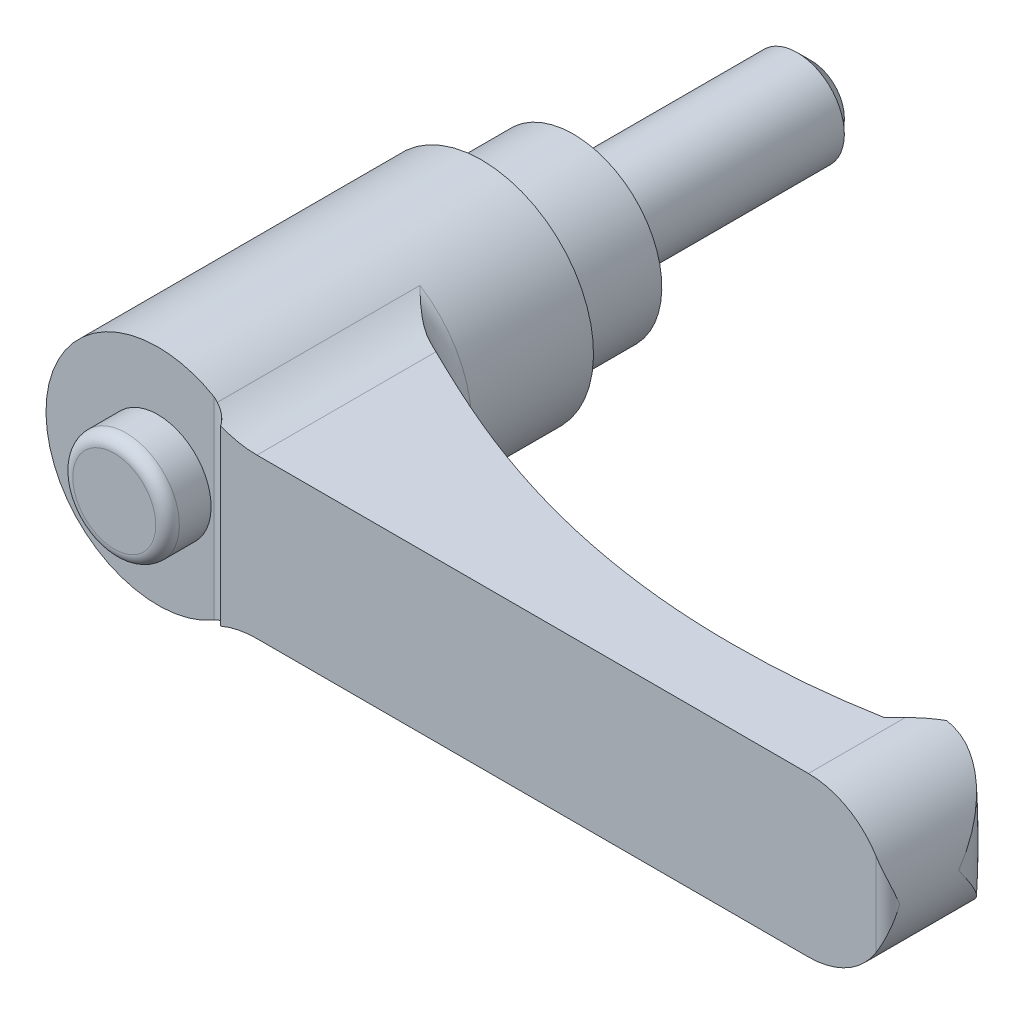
ISO-10303-21;
HEADER;
FILE_DESCRIPTION(('STEP AP214'),'2;1');
FILE_NAME('part.step','',(''),(''),'','','');
FILE_SCHEMA(('AUTOMOTIVE_DESIGN { 1 0 10303 214 1 1 1 1 }'));
ENDSEC;
DATA;
#1=APPLICATION_CONTEXT('core data for automotive mechanical design processes');
#2=APPLICATION_PROTOCOL_DEFINITION('international standard','automotive_design',2000,#1);
#3=PRODUCT_CONTEXT('',#1,'mechanical');
#4=PRODUCT('Part','Part','',(#3));
#5=PRODUCT_RELATED_PRODUCT_CATEGORY('part','',(#4));
#6=PRODUCT_DEFINITION_FORMATION('','',#4);
#7=PRODUCT_DEFINITION_CONTEXT('part definition',#1,'design');
#8=PRODUCT_DEFINITION('design','',#6,#7);
#9=PRODUCT_DEFINITION_SHAPE('','',#8);
#10=(LENGTH_UNIT() NAMED_UNIT(*) SI_UNIT(.MILLI.,.METRE.));
#11=(NAMED_UNIT(*) PLANE_ANGLE_UNIT() SI_UNIT($,.RADIAN.));
#12=(NAMED_UNIT(*) SI_UNIT($,.STERADIAN.) SOLID_ANGLE_UNIT());
#13=UNCERTAINTY_MEASURE_WITH_UNIT(LENGTH_MEASURE(1.E-05),#10,'distance_accuracy_value','');
#14=(GEOMETRIC_REPRESENTATION_CONTEXT(3) GLOBAL_UNCERTAINTY_ASSIGNED_CONTEXT((#13)) GLOBAL_UNIT_ASSIGNED_CONTEXT((#10,
#11,#12)) REPRESENTATION_CONTEXT('',''));
#15=CARTESIAN_POINT('',(0.,0.,0.));
#16=DIRECTION('',(0.,0.,1.));
#17=DIRECTION('',(1.,0.,0.));
#18=AXIS2_PLACEMENT_3D('',#15,#16,#17);
#19=CARTESIAN_POINT('',(6.,0.,0.));
#20=DIRECTION('',(0.,0.,1.));
#21=DIRECTION('',(0.,-1.,0.));
#22=AXIS2_PLACEMENT_3D('',#19,#20,#21);
#23=PLANE('',#22);
#24=CARTESIAN_POINT('',(0.,0.,0.));
#25=DIRECTION('',(0.,0.,-1.));
#26=DIRECTION('',(0.,1.,0.));
#27=AXIS2_PLACEMENT_3D('',#24,#25,#26);
#28=CIRCLE('',#27,4.);
#29=CARTESIAN_POINT('',(0.,4.,0.));
#30=VERTEX_POINT('',#29);
#31=EDGE_CURVE('E423',#30,#30,#28,.T.);
#32=ORIENTED_EDGE('',*,*,#31,.F.);
#33=EDGE_LOOP('',(#32));
#34=FACE_BOUND('',#33,.T.);
#35=CARTESIAN_POINT('',(0.,0.,0.));
#36=DIRECTION('',(0.,0.,-1.));
#37=DIRECTION('',(0.,1.,0.));
#38=AXIS2_PLACEMENT_3D('',#35,#36,#37);
#39=CIRCLE('',#38,6.);
#40=CARTESIAN_POINT('',(0.,6.,0.));
#41=VERTEX_POINT('',#40);
#42=EDGE_CURVE('E347',#41,#41,#39,.T.);
#43=ORIENTED_EDGE('',*,*,#42,.T.);
#44=EDGE_LOOP('',(#43));
#45=FACE_BOUND('',#44,.T.);
#46=ADVANCED_FACE('F14',(#34,#45),#23,.F.);
#47=CARTESIAN_POINT('',(0.,0.,35.5));
#48=DIRECTION('',(0.,0.,-1.));
#49=DIRECTION('',(0.,1.,0.));
#50=AXIS2_PLACEMENT_3D('',#47,#48,#49);
#51=PLANE('',#50);
#52=CARTESIAN_POINT('',(0.,0.,35.5));
#53=DIRECTION('',(0.,0.,-1.));
#54=DIRECTION('',(0.,1.,0.));
#55=AXIS2_PLACEMENT_3D('',#52,#53,#54);
#56=CIRCLE('',#55,9.5);
#57=CARTESIAN_POINT('',(4.75,-8.22724133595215,35.5));
#58=VERTEX_POINT('',#57);
#59=CARTESIAN_POINT('',(4.75,8.22724133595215,35.5));
#60=VERTEX_POINT('',#59);
#61=EDGE_CURVE('E332',#58,#60,#56,.T.);
#62=ORIENTED_EDGE('',*,*,#61,.F.);
#63=DIRECTION('',(0.,1.,0.));
#64=VECTOR('',#63,1.);
#65=CARTESIAN_POINT('',(4.75,-13.5,35.5));
#66=LINE('',#65,#64);
#67=EDGE_CURVE('E383',#58,#60,#66,.T.);
#68=ORIENTED_EDGE('',*,*,#67,.T.);
#69=EDGE_LOOP('',(#62,#68));
#70=FACE_BOUND('',#69,.T.);
#71=CARTESIAN_POINT('',(0.,0.,35.5));
#72=DIRECTION('',(0.,0.,-1.));
#73=DIRECTION('',(0.,1.,0.));
#74=AXIS2_PLACEMENT_3D('',#71,#72,#73);
#75=CIRCLE('',#74,4.52380952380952);
#76=CARTESIAN_POINT('',(0.,4.52380952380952,35.5));
#77=VERTEX_POINT('',#76);
#78=EDGE_CURVE('E183',#77,#77,#75,.F.);
#79=ORIENTED_EDGE('',*,*,#78,.F.);
#80=EDGE_LOOP('',(#79));
#81=FACE_BOUND('',#80,.T.);
#82=ADVANCED_FACE('F158',(#70,#81),#51,.F.);
#83=CARTESIAN_POINT('',(56.25,0.,0.));
#84=DIRECTION('',(0.,0.,1.));
#85=DIRECTION('',(0.,-1.,0.));
#86=AXIS2_PLACEMENT_3D('',#83,#84,#85);
#87=CYLINDRICAL_SURFACE('',#86,6.75);
#88=CARTESIAN_POINT('',(63.,0.,30.5));
#89=CARTESIAN_POINT('',(63.0000000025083,-0.0046874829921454,30.4965903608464));
#90=CARTESIAN_POINT('',(62.9999951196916,-0.0093750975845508,30.4931806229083));
#91=CARTESIAN_POINT('',(62.9990237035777,-0.475524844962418,30.1541065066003));
#92=CARTESIAN_POINT('',(62.9507141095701,-0.938185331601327,29.8175642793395));
#93=CARTESIAN_POINT('',(62.8060463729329,-1.62346497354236,29.3225480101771));
#94=CARTESIAN_POINT('',(62.7456147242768,-1.85084323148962,29.1588881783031));
#95=CARTESIAN_POINT('',(62.6000044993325,-2.30127271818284,28.8365968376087));
#96=CARTESIAN_POINT('',(62.5148384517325,-2.52432607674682,28.6779628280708));
#97=CARTESIAN_POINT('',(62.344804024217,-2.90644000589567,28.4087021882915));
#98=CARTESIAN_POINT('',(62.2657268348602,-3.06692788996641,28.2964051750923));
#99=CARTESIAN_POINT('',(62.0934111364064,-3.38371909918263,28.0768184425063));
#100=CARTESIAN_POINT('',(62.0001726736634,-3.5400224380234,27.9695287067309));
#101=CARTESIAN_POINT('',(61.7993668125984,-3.84715615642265,27.7614384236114));
#102=CARTESIAN_POINT('',(61.6918275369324,-3.99799655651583,27.6606257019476));
#103=CARTESIAN_POINT('',(61.4620426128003,-4.29326696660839,27.4668757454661));
#104=CARTESIAN_POINT('',(61.3398014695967,-4.43769892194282,27.3739361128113));
#105=CARTESIAN_POINT('',(61.0188552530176,-4.78536684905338,27.1560724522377));
#106=CARTESIAN_POINT('',(60.8112818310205,-4.9842025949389,27.0367418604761));
#107=CARTESIAN_POINT('',(60.4758984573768,-5.26551240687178,26.8795376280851));
#108=CARTESIAN_POINT('',(60.3601030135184,-5.35645651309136,26.8307690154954));
#109=CARTESIAN_POINT('',(60.1206554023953,-5.53195453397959,26.7416778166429));
#110=CARTESIAN_POINT('',(59.997005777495,-5.61651049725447,26.7013525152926));
#111=CARTESIAN_POINT('',(59.7699445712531,-5.76076929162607,26.6381973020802));
#112=CARTESIAN_POINT('',(59.667954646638,-5.82188686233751,26.6134697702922));
#113=CARTESIAN_POINT('',(59.4598154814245,-5.93917869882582,26.5707512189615));
#114=CARTESIAN_POINT('',(59.3536672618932,-5.99535416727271,26.5527585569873));
#115=CARTESIAN_POINT('',(59.1377410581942,-6.10229132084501,26.5242546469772));
#116=CARTESIAN_POINT('',(59.0279645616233,-6.15305518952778,26.5137403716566));
#117=CARTESIAN_POINT('',(58.8054681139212,-6.24873887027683,26.5009304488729));
#118=CARTESIAN_POINT('',(58.6927495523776,-6.29366138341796,26.4986309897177));
#119=CARTESIAN_POINT('',(58.4641163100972,-6.37770798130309,26.502966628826));
#120=CARTESIAN_POINT('',(58.3481815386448,-6.41677354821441,26.5096859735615));
#121=CARTESIAN_POINT('',(58.1152313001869,-6.48831686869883,26.5328398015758));
#122=CARTESIAN_POINT('',(57.9982157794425,-6.52079429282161,26.5492747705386));
#123=CARTESIAN_POINT('',(57.7644328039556,-6.57901960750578,26.5923251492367));
#124=CARTESIAN_POINT('',(57.6476652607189,-6.60477054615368,26.618935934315));
#125=CARTESIAN_POINT('',(57.41573023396,-6.64962508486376,26.6826067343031));
#126=CARTESIAN_POINT('',(57.3005622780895,-6.66873068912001,26.7196635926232));
#127=CARTESIAN_POINT('',(57.104290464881,-6.69624244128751,26.7926929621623));
#128=CARTESIAN_POINT('',(57.0224673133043,-6.70614558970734,26.8262017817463));
#129=CARTESIAN_POINT('',(56.8609556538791,-6.72278366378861,26.8986767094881));
#130=CARTESIAN_POINT('',(56.781266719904,-6.72951922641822,26.9376417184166));
#131=CARTESIAN_POINT('',(56.624433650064,-6.74006528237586,27.0209540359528));
#132=CARTESIAN_POINT('',(56.5472927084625,-6.74387222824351,27.0653077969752));
#133=CARTESIAN_POINT('',(56.3961054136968,-6.74884425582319,27.1591719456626));
#134=CARTESIAN_POINT('',(56.3220596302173,-6.75000885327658,27.2086832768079));
#135=CARTESIAN_POINT('',(56.2498,-6.74999999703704,27.2606710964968));
#136=B_SPLINE_CURVE_WITH_KNOTS('',3,(#88,#89,#90,#91,#92,#93,#94,#95,#96,#97,#98,#99,#100,#101,
#102,#103,#104,#105,#106,#107,#108,#109,#110,#111,#112,#113,#114,#115,#116,#117,#118,#119,#120,
#121,#122,#123,#124,#125,#126,#127,#128,#129,#130,#131,#132,#133,#134,#135),.UNSPECIFIED.,.F.,
.F.,(4,2,2,2,2,2,2,2,2,2,2,2,2,2,2,2,2,2,2,2,2,2,2,4),(0.,0.0173896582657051,1.7292315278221,
2.5882674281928,3.44686895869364,4.08007105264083,4.71327107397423,5.34524382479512,
5.97702340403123,6.9068284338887,7.37170994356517,7.83644173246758,8.20045511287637,
8.56437966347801,8.92815681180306,9.29176514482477,9.65879376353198,10.0258407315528,
10.3927210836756,10.7594906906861,11.0261722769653,11.2928002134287,11.5597506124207,
11.8267499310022),.UNSPECIFIED.);
#137=CARTESIAN_POINT('',(58.6622222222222,-6.30425919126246,26.5));
#138=VERTEX_POINT('',#137);
#139=CARTESIAN_POINT('',(63.,0.,30.5));
#140=VERTEX_POINT('',#139);
#141=EDGE_CURVE('E126',#138,#140,#136,.F.);
#142=ORIENTED_EDGE('',*,*,#141,.T.);
#143=CARTESIAN_POINT('',(63.,0.,30.5));
#144=CARTESIAN_POINT('',(63.0000000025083,0.00468748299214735,30.4965903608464));
#145=CARTESIAN_POINT('',(62.9999951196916,0.00937509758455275,30.4931806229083));
#146=CARTESIAN_POINT('',(62.9990237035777,0.47552484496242,30.1541065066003));
#147=CARTESIAN_POINT('',(62.9507141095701,0.938185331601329,29.8175642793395));
#148=CARTESIAN_POINT('',(62.8060463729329,1.62346497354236,29.3225480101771));
#149=CARTESIAN_POINT('',(62.7456147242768,1.85084323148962,29.1588881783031));
#150=CARTESIAN_POINT('',(62.6000044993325,2.30127271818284,28.8365968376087));
#151=CARTESIAN_POINT('',(62.5148384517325,2.52432607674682,28.6779628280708));
#152=CARTESIAN_POINT('',(62.344804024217,2.90644000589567,28.4087021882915));
#153=CARTESIAN_POINT('',(62.2657268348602,3.06692788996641,28.2964051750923));
#154=CARTESIAN_POINT('',(62.0934111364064,3.38371909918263,28.0768184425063));
#155=CARTESIAN_POINT('',(62.0001726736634,3.5400224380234,27.9695287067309));
#156=CARTESIAN_POINT('',(61.7993668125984,3.84715615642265,27.7614384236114));
#157=CARTESIAN_POINT('',(61.6918275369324,3.99799655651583,27.6606257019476));
#158=CARTESIAN_POINT('',(61.4620426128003,4.29326696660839,27.4668757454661));
#159=CARTESIAN_POINT('',(61.3398014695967,4.43769892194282,27.3739361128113));
#160=CARTESIAN_POINT('',(61.0188552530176,4.78536684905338,27.1560724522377));
#161=CARTESIAN_POINT('',(60.8112818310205,4.9842025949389,27.0367418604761));
#162=CARTESIAN_POINT('',(60.4758984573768,5.26551240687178,26.8795376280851));
#163=CARTESIAN_POINT('',(60.3601030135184,5.35645651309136,26.8307690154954));
#164=CARTESIAN_POINT('',(60.1206554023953,5.53195453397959,26.7416778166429));
#165=CARTESIAN_POINT('',(59.997005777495,5.61651049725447,26.7013525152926));
#166=CARTESIAN_POINT('',(59.7699445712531,5.76076929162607,26.6381973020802));
#167=CARTESIAN_POINT('',(59.667954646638,5.82188686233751,26.6134697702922));
#168=CARTESIAN_POINT('',(59.4598154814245,5.93917869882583,26.5707512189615));
#169=CARTESIAN_POINT('',(59.3536672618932,5.99535416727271,26.5527585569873));
#170=CARTESIAN_POINT('',(59.1377410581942,6.10229132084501,26.5242546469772));
#171=CARTESIAN_POINT('',(59.0279645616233,6.15305518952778,26.5137403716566));
#172=CARTESIAN_POINT('',(58.8054681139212,6.24873887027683,26.5009304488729));
#173=CARTESIAN_POINT('',(58.6927495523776,6.29366138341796,26.4986309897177));
#174=CARTESIAN_POINT('',(58.4641163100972,6.37770798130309,26.502966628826));
#175=CARTESIAN_POINT('',(58.3481815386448,6.41677354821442,26.5096859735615));
#176=CARTESIAN_POINT('',(58.1152313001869,6.48831686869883,26.5328398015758));
#177=CARTESIAN_POINT('',(57.9982157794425,6.52079429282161,26.5492747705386));
#178=CARTESIAN_POINT('',(57.7644328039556,6.57901960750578,26.5923251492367));
#179=CARTESIAN_POINT('',(57.6476652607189,6.60477054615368,26.618935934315));
#180=CARTESIAN_POINT('',(57.41573023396,6.64962508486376,26.6826067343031));
#181=CARTESIAN_POINT('',(57.3005622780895,6.66873068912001,26.7196635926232));
#182=CARTESIAN_POINT('',(57.1042904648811,6.69624244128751,26.7926929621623));
#183=CARTESIAN_POINT('',(57.0224673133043,6.70614558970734,26.8262017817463));
#184=CARTESIAN_POINT('',(56.8609556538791,6.72278366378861,26.8986767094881));
#185=CARTESIAN_POINT('',(56.781266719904,6.72951922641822,26.9376417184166));
#186=CARTESIAN_POINT('',(56.624433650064,6.74006528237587,27.0209540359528));
#187=CARTESIAN_POINT('',(56.5472927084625,6.74387222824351,27.0653077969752));
#188=CARTESIAN_POINT('',(56.3961054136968,6.74884425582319,27.1591719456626));
#189=CARTESIAN_POINT('',(56.3220596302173,6.75000885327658,27.2086832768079));
#190=CARTESIAN_POINT('',(56.2498,6.74999999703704,27.2606710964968));
#191=B_SPLINE_CURVE_WITH_KNOTS('',3,(#143,#144,#145,#146,#147,#148,#149,#150,#151,#152,#153,
#154,#155,#156,#157,#158,#159,#160,#161,#162,#163,#164,#165,#166,#167,#168,#169,#170,#171,#172,
#173,#174,#175,#176,#177,#178,#179,#180,#181,#182,#183,#184,#185,#186,#187,#188,#189,#190),
.UNSPECIFIED.,.F.,.F.,(4,2,2,2,2,2,2,2,2,2,2,2,2,2,2,2,2,2,2,2,2,2,2,4),(0.,0.0173896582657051,
1.7292315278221,2.5882674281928,3.44686895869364,4.08007105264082,4.71327107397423,
5.34524382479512,5.97702340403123,6.9068284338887,7.37170994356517,7.83644173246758,
8.20045511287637,8.56437966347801,8.92815681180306,9.29176514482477,9.65879376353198,
10.0258407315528,10.3927210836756,10.7594906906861,11.0261722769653,11.2928002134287,
11.5597506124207,11.8267499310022),.UNSPECIFIED.);
#192=CARTESIAN_POINT('',(58.6622222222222,6.30425919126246,26.5));
#193=VERTEX_POINT('',#192);
#194=EDGE_CURVE('E123',#140,#193,#191,.T.);
#195=ORIENTED_EDGE('',*,*,#194,.T.);
#196=CARTESIAN_POINT('',(56.25,0.,26.5));
#197=DIRECTION('',(0.,0.,-1.));
#198=DIRECTION('',(0.,1.,0.));
#199=AXIS2_PLACEMENT_3D('',#196,#197,#198);
#200=CIRCLE('',#199,6.75);
#201=CARTESIAN_POINT('',(58.,6.51920240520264,26.5));
#202=VERTEX_POINT('',#201);
#203=EDGE_CURVE('E308',#193,#202,#200,.F.);
#204=ORIENTED_EDGE('',*,*,#203,.T.);
#205=CARTESIAN_POINT('',(56.25,0.,28.25));
#206=DIRECTION('',(-0.707106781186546,0.,-0.70710678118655));
#207=DIRECTION('',(-0.70710678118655,0.,0.707106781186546));
#208=AXIS2_PLACEMENT_3D('',#205,#206,#207);
#209=ELLIPSE('',#208,9.54594154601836,6.75);
#210=CARTESIAN_POINT('',(56.25,6.75,28.25));
#211=VERTEX_POINT('',#210);
#212=EDGE_CURVE('E374',#202,#211,#209,.F.);
#213=ORIENTED_EDGE('',*,*,#212,.T.);
#214=DIRECTION('',(0.,0.,1.));
#215=VECTOR('',#214,1.);
#216=CARTESIAN_POINT('',(56.25,6.75,0.));
#217=LINE('',#216,#215);
#218=CARTESIAN_POINT('',(56.25,6.75,36.5));
#219=VERTEX_POINT('',#218);
#220=EDGE_CURVE('E330',#211,#219,#217,.T.);
#221=ORIENTED_EDGE('',*,*,#220,.T.);
#222=CARTESIAN_POINT('',(56.25,0.,36.5));
#223=DIRECTION('',(0.,0.,1.));
#224=DIRECTION('',(0.,-1.,0.));
#225=AXIS2_PLACEMENT_3D('',#222,#223,#224);
#226=CIRCLE('',#225,6.75);
#227=CARTESIAN_POINT('',(62.,3.53553390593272,36.5));
#228=VERTEX_POINT('',#227);
#229=EDGE_CURVE('E322',#228,#219,#226,.T.);
#230=ORIENTED_EDGE('',*,*,#229,.F.);
#231=CARTESIAN_POINT('',(62.,3.53553390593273,36.5));
#232=CARTESIAN_POINT('',(62.0299932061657,3.48675666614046,36.4999933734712));
#233=CARTESIAN_POINT('',(62.0593538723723,3.43761273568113,36.4986515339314));
#234=CARTESIAN_POINT('',(62.1167538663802,3.33870692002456,36.4935798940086));
#235=CARTESIAN_POINT('',(62.1447937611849,3.28894531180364,36.489851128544));
#236=CARTESIAN_POINT('',(62.2267562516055,3.13908056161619,36.4755285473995));
#237=CARTESIAN_POINT('',(62.2786643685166,3.03816514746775,36.4617957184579));
#238=CARTESIAN_POINT('',(62.3766467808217,2.83536966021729,36.4277987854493));
#239=CARTESIAN_POINT('',(62.4227515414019,2.73349792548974,36.4075709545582));
#240=CARTESIAN_POINT('',(62.509502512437,2.52854152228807,36.3618646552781));
#241=CARTESIAN_POINT('',(62.550144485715,2.42545597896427,36.3363821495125));
#242=CARTESIAN_POINT('',(62.6493297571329,2.15471359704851,36.2642737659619));
#243=CARTESIAN_POINT('',(62.7035065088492,1.98634279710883,36.2142841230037));
#244=CARTESIAN_POINT('',(62.7980553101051,1.64812969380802,36.1068184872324));
#245=CARTESIAN_POINT('',(62.8384218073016,1.4782868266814,36.0493394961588));
#246=CARTESIAN_POINT('',(62.9057483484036,1.1374266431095,35.9293690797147));
#247=CARTESIAN_POINT('',(62.9326868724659,0.966407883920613,35.8668697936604));
#248=CARTESIAN_POINT('',(62.9733111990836,0.623942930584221,35.7390768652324));
#249=CARTESIAN_POINT('',(62.9870036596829,0.452496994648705,35.6737846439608));
#250=CARTESIAN_POINT('',(62.997837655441,0.192449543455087,35.5740662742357));
#251=CARTESIAN_POINT('',(62.999781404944,0.103891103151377,35.539987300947));
#252=CARTESIAN_POINT('',(62.9999941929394,0.0102233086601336,35.5039349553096));
#253=CARTESIAN_POINT('',(62.9999999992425,0.00511164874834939,35.5019674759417));
#254=CARTESIAN_POINT('',(63.,0.,35.5));
#255=B_SPLINE_CURVE_WITH_KNOTS('',3,(#231,#232,#233,#234,#235,#236,#237,#238,#239,#240,#241,
#242,#243,#244,#245,#246,#247,#248,#249,#250,#251,#252,#253,#254),.UNSPECIFIED.,.F.,.F.,(4,2,2,
2,2,2,2,2,2,2,2,4),(0.,0.171732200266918,0.343389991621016,0.685890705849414,1.02651095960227,
1.36739390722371,1.91796289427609,2.46875297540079,3.02042294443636,3.57181547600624,
3.85648313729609,3.87291482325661),.UNSPECIFIED.);
#256=CARTESIAN_POINT('',(63.,0.,35.5));
#257=VERTEX_POINT('',#256);
#258=EDGE_CURVE('E169',#257,#228,#255,.F.);
#259=ORIENTED_EDGE('',*,*,#258,.F.);
#260=CARTESIAN_POINT('',(62.,-3.53553390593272,36.5));
#261=CARTESIAN_POINT('',(62.0299932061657,-3.48675666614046,36.4999933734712));
#262=CARTESIAN_POINT('',(62.0593538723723,-3.43761273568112,36.4986515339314));
#263=CARTESIAN_POINT('',(62.1167538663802,-3.33870692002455,36.4935798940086));
#264=CARTESIAN_POINT('',(62.1447937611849,-3.28894531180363,36.489851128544));
#265=CARTESIAN_POINT('',(62.2267562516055,-3.13908056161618,36.4755285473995));
#266=CARTESIAN_POINT('',(62.2786643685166,-3.03816514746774,36.4617957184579));
#267=CARTESIAN_POINT('',(62.3766467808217,-2.83536966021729,36.4277987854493));
#268=CARTESIAN_POINT('',(62.4227515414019,-2.73349792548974,36.4075709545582));
#269=CARTESIAN_POINT('',(62.509502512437,-2.52854152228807,36.3618646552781));
#270=CARTESIAN_POINT('',(62.550144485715,-2.42545597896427,36.3363821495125));
#271=CARTESIAN_POINT('',(62.6493297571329,-2.15471359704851,36.2642737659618));
#272=CARTESIAN_POINT('',(62.7035065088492,-1.98634279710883,36.2142841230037));
#273=CARTESIAN_POINT('',(62.7980553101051,-1.64812969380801,36.1068184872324));
#274=CARTESIAN_POINT('',(62.8384218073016,-1.4782868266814,36.0493394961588));
#275=CARTESIAN_POINT('',(62.9057483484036,-1.1374266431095,35.9293690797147));
#276=CARTESIAN_POINT('',(62.9326868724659,-0.966407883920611,35.8668697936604));
#277=CARTESIAN_POINT('',(62.9733111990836,-0.623942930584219,35.7390768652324));
#278=CARTESIAN_POINT('',(62.9870036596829,-0.452496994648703,35.6737846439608));
#279=CARTESIAN_POINT('',(62.997837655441,-0.192449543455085,35.5740662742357));
#280=CARTESIAN_POINT('',(62.999781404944,-0.103891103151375,35.539987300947));
#281=CARTESIAN_POINT('',(62.9999941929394,-0.0102233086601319,35.5039349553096));
#282=CARTESIAN_POINT('',(62.9999999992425,-0.00511164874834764,35.5019674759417));
#283=CARTESIAN_POINT('',(63.,0.,35.5));
#284=B_SPLINE_CURVE_WITH_KNOTS('',3,(#260,#261,#262,#263,#264,#265,#266,#267,#268,#269,#270,
#271,#272,#273,#274,#275,#276,#277,#278,#279,#280,#281,#282,#283),.UNSPECIFIED.,.F.,.F.,(4,2,2,
2,2,2,2,2,2,2,2,4),(0.,0.171732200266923,0.34338999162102,0.685890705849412,1.02651095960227,
1.36739390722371,1.91796289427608,2.46875297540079,3.02042294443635,3.57181547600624,
3.85648313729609,3.8729148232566),.UNSPECIFIED.);
#285=CARTESIAN_POINT('',(62.,-3.53553390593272,36.5));
#286=VERTEX_POINT('',#285);
#287=EDGE_CURVE('E177',#286,#257,#284,.T.);
#288=ORIENTED_EDGE('',*,*,#287,.F.);
#289=CARTESIAN_POINT('',(56.25,-6.75,36.5));
#290=VERTEX_POINT('',#289);
#291=EDGE_CURVE('E310',#290,#286,#226,.T.);
#292=ORIENTED_EDGE('',*,*,#291,.F.);
#293=DIRECTION('',(0.,0.,1.));
#294=VECTOR('',#293,1.);
#295=CARTESIAN_POINT('',(56.25,-6.75,0.));
#296=LINE('',#295,#294);
#297=CARTESIAN_POINT('',(56.25,-6.75,28.25));
#298=VERTEX_POINT('',#297);
#299=EDGE_CURVE('E355',#298,#290,#296,.T.);
#300=ORIENTED_EDGE('',*,*,#299,.F.);
#301=CARTESIAN_POINT('',(58.,-6.51920240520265,26.5));
#302=VERTEX_POINT('',#301);
#303=EDGE_CURVE('E375',#298,#302,#209,.F.);
#304=ORIENTED_EDGE('',*,*,#303,.T.);
#305=EDGE_CURVE('E134',#302,#138,#200,.F.);
#306=ORIENTED_EDGE('',*,*,#305,.T.);
#307=EDGE_LOOP('',(#142,#195,#204,#213,#221,#230,#259,#288,#292,#300,#304,#306));
#308=FACE_BOUND('',#307,.T.);
#309=ADVANCED_FACE('F132',(#308),#87,.T.);
#310=CARTESIAN_POINT('',(59.,-13.5,26.5));
#311=DIRECTION('',(0.,0.,-1.));
#312=DIRECTION('',(0.,1.,0.));
#313=AXIS2_PLACEMENT_3D('',#310,#311,#312);
#314=PLANE('',#313);
#315=ORIENTED_EDGE('',*,*,#203,.F.);
#316=CARTESIAN_POINT('',(0.,0.,26.5));
#317=DIRECTION('',(0.,0.,-1.));
#318=DIRECTION('',(0.,1.,0.));
#319=AXIS2_PLACEMENT_3D('',#316,#317,#318);
#320=CIRCLE('',#319,59.);
#321=EDGE_CURVE('E37',#193,#138,#320,.T.);
#322=ORIENTED_EDGE('',*,*,#321,.T.);
#323=ORIENTED_EDGE('',*,*,#305,.F.);
#324=DIRECTION('',(0.,1.,0.));
#325=VECTOR('',#324,1.);
#326=CARTESIAN_POINT('',(58.,-13.5,26.5));
#327=LINE('',#326,#325);
#328=EDGE_CURVE('E327',#302,#202,#327,.T.);
#329=ORIENTED_EDGE('',*,*,#328,.T.);
#330=EDGE_LOOP('',(#315,#322,#323,#329));
#331=FACE_BOUND('',#330,.T.);
#332=ADVANCED_FACE('F157',(#331),#314,.T.);
#333=CARTESIAN_POINT('',(0.,0.,36.5));
#334=DIRECTION('',(0.,0.,1.));
#335=DIRECTION('',(0.,-1.,0.));
#336=AXIS2_PLACEMENT_3D('',#333,#334,#335);
#337=PLANE('',#336);
#338=CARTESIAN_POINT('',(9.41740410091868,14.75,36.5));
#339=DIRECTION('',(0.,0.,1.));
#340=DIRECTION('',(1.,0.,0.));
#341=AXIS2_PLACEMENT_3D('',#338,#339,#340);
#342=CIRCLE('',#341,8.);
#343=CARTESIAN_POINT('',(6.33333333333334,7.36836688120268,36.5));
#344=VERTEX_POINT('',#343);
#345=CARTESIAN_POINT('',(9.41740410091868,6.75,36.5));
#346=VERTEX_POINT('',#345);
#347=EDGE_CURVE('E369',#344,#346,#342,.T.);
#348=ORIENTED_EDGE('',*,*,#347,.F.);
#349=DIRECTION('',(0.,1.,0.));
#350=VECTOR('',#349,1.);
#351=CARTESIAN_POINT('',(6.33333333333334,-13.5,36.5));
#352=LINE('',#351,#350);
#353=CARTESIAN_POINT('',(6.33333333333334,-7.36836688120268,36.5));
#354=VERTEX_POINT('',#353);
#355=EDGE_CURVE('E326',#354,#344,#352,.T.);
#356=ORIENTED_EDGE('',*,*,#355,.F.);
#357=CARTESIAN_POINT('',(9.41740410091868,-14.75,36.5));
#358=DIRECTION('',(0.,0.,1.));
#359=DIRECTION('',(1.,0.,0.));
#360=AXIS2_PLACEMENT_3D('',#357,#358,#359);
#361=CIRCLE('',#360,8.);
#362=CARTESIAN_POINT('',(9.41740410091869,-6.75,36.5));
#363=VERTEX_POINT('',#362);
#364=EDGE_CURVE('E361',#363,#354,#361,.T.);
#365=ORIENTED_EDGE('',*,*,#364,.F.);
#366=DIRECTION('',(-1.,0.,0.));
#367=VECTOR('',#366,1.);
#368=CARTESIAN_POINT('',(56.25,-6.75,36.5));
#369=LINE('',#368,#367);
#370=EDGE_CURVE('E364',#290,#363,#369,.T.);
#371=ORIENTED_EDGE('',*,*,#370,.F.);
#372=ORIENTED_EDGE('',*,*,#291,.T.);
#373=DIRECTION('',(0.,1.,0.));
#374=VECTOR('',#373,1.);
#375=CARTESIAN_POINT('',(62.,-13.5,36.5));
#376=LINE('',#375,#374);
#377=EDGE_CURVE('E315',#286,#228,#376,.T.);
#378=ORIENTED_EDGE('',*,*,#377,.T.);
#379=ORIENTED_EDGE('',*,*,#229,.T.);
#380=DIRECTION('',(1.,0.,0.));
#381=VECTOR('',#380,1.);
#382=CARTESIAN_POINT('',(9.41740410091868,6.75,36.5));
#383=LINE('',#382,#381);
#384=EDGE_CURVE('E367',#346,#219,#383,.T.);
#385=ORIENTED_EDGE('',*,*,#384,.F.);
#386=EDGE_LOOP('',(#348,#356,#365,#371,#372,#378,#379,#385));
#387=FACE_BOUND('',#386,.T.);
#388=ADVANCED_FACE('F240',(#387),#337,.T.);
#389=CARTESIAN_POINT('',(0.,0.,0.));
#390=DIRECTION('',(0.,0.,-1.));
#391=DIRECTION('',(0.,1.,0.));
#392=AXIS2_PLACEMENT_3D('',#389,#390,#391);
#393=CYLINDRICAL_SURFACE('',#392,9.5);
#394=CARTESIAN_POINT('',(0.,0.,18.3481601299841));
#395=DIRECTION('',(0.,0.,-1.));
#396=DIRECTION('',(0.,1.,0.));
#397=AXIS2_PLACEMENT_3D('',#394,#395,#396);
#398=CIRCLE('',#397,9.5);
#399=CARTESIAN_POINT('',(5.11230508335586,8.00714285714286,18.3481601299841));
#400=VERTEX_POINT('',#399);
#401=CARTESIAN_POINT('',(5.11230508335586,-8.00714285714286,18.3481601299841));
#402=VERTEX_POINT('',#401);
#403=EDGE_CURVE('E413',#400,#402,#398,.T.);
#404=ORIENTED_EDGE('',*,*,#403,.T.);
#405=DIRECTION('',(0.,0.,1.));
#406=VECTOR('',#405,1.);
#407=CARTESIAN_POINT('',(5.11230508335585,-8.00714285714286,0.));
#408=LINE('',#407,#406);
#409=CARTESIAN_POINT('',(5.11230508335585,-8.00714285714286,35.5614827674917));
#410=VERTEX_POINT('',#409);
#411=EDGE_CURVE('E359',#402,#410,#408,.T.);
#412=ORIENTED_EDGE('',*,*,#411,.T.);
#413=CARTESIAN_POINT('',(4.75,-8.22724133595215,35.5));
#414=CARTESIAN_POINT('',(4.82354897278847,-8.18479174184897,35.5056127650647));
#415=CARTESIAN_POINT('',(4.89626028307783,-8.1414834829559,35.5152432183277));
#416=CARTESIAN_POINT('',(5.03945202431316,-8.05362753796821,35.5421901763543));
#417=CARTESIAN_POINT('',(5.10993308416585,-8.00908020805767,35.5595044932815));
#418=CARTESIAN_POINT('',(5.24861636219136,-7.91889687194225,35.6016146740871));
#419=CARTESIAN_POINT('',(5.31680005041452,-7.87325555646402,35.6264601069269));
#420=CARTESIAN_POINT('',(5.44990684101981,-7.7817124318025,35.6832973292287));
#421=CARTESIAN_POINT('',(5.51483003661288,-7.7358106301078,35.7152889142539));
#422=CARTESIAN_POINT('',(5.69141984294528,-7.6077148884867,35.8145402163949));
#423=CARTESIAN_POINT('',(5.79903338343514,-7.52579740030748,35.8895684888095));
#424=CARTESIAN_POINT('',(5.99917718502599,-7.36722875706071,36.0610902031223));
#425=CARTESIAN_POINT('',(6.09178179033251,-7.29055280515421,36.157471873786));
#426=CARTESIAN_POINT('',(6.20382113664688,-7.19472379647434,36.3011658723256));
#427=CARTESIAN_POINT('',(6.23139044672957,-7.17084441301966,36.33916914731));
#428=CARTESIAN_POINT('',(6.28417716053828,-7.12462925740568,36.4176957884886));
#429=CARTESIAN_POINT('',(6.30939340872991,-7.1022942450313,36.4582203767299));
#430=CARTESIAN_POINT('',(6.33333333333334,-7.08088192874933,36.5));
#431=B_SPLINE_CURVE_WITH_KNOTS('',3,(#413,#414,#415,#416,#417,#418,#419,#420,#421,#422,#423,
#424,#425,#426,#427,#428,#429,#430),.UNSPECIFIED.,.F.,.F.,(4,2,2,2,2,2,2,2,4),(0.,
0.25516766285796,0.510262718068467,0.767074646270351,1.02387922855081,1.48566336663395,
1.94508518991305,2.10299549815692,2.26098294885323),.UNSPECIFIED.);
#432=EDGE_CURVE('E214',#58,#410,#431,.T.);
#433=ORIENTED_EDGE('',*,*,#432,.F.);
#434=ORIENTED_EDGE('',*,*,#61,.T.);
#435=CARTESIAN_POINT('',(6.33333333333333,7.08088192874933,36.5));
#436=CARTESIAN_POINT('',(6.30193651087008,7.10896982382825,36.4452145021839));
#437=CARTESIAN_POINT('',(6.26833956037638,7.13863883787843,36.3925689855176));
#438=CARTESIAN_POINT('',(6.19723055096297,7.20045324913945,36.2916619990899));
#439=CARTESIAN_POINT('',(6.15972345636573,7.23259549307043,36.243395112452));
#440=CARTESIAN_POINT('',(6.08131079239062,7.2986494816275,36.1513438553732));
#441=CARTESIAN_POINT('',(6.04041526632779,7.33255589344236,36.1075470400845));
#442=CARTESIAN_POINT('',(5.95546899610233,7.40171574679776,36.0242830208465));
#443=CARTESIAN_POINT('',(5.91141716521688,7.4369696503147,35.9848173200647));
#444=CARTESIAN_POINT('',(5.7754647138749,7.54368484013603,35.8733623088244));
#445=CARTESIAN_POINT('',(5.67929205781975,7.61650473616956,35.8077657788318));
#446=CARTESIAN_POINT('',(5.47750803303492,7.76289095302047,35.6942705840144));
#447=CARTESIAN_POINT('',(5.37189158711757,7.83645765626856,35.6463815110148));
#448=CARTESIAN_POINT('',(5.1806466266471,7.96370194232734,35.5790108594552));
#449=CARTESIAN_POINT('',(5.09668204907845,8.01772299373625,35.5554125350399));
#450=CARTESIAN_POINT('',(4.92555498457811,8.12398585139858,35.5192948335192));
#451=CARTESIAN_POINT('',(4.83839896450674,8.17623088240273,35.5067542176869));
#452=CARTESIAN_POINT('',(4.75,8.22724133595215,35.5));
#453=B_SPLINE_CURVE_WITH_KNOTS('',3,(#435,#436,#437,#438,#439,#440,#441,#442,#443,#444,#445,
#446,#447,#448,#449,#450,#451,#452),.UNSPECIFIED.,.F.,.F.,(4,2,2,2,2,2,2,2,4),(0.,
0.207163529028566,0.414067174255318,0.620378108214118,0.826760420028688,1.23705708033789,
1.64757566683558,1.9547198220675,2.26127274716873),.UNSPECIFIED.);
#454=CARTESIAN_POINT('',(5.11230508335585,8.00714285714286,35.5614827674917));
#455=VERTEX_POINT('',#454);
#456=EDGE_CURVE('E228',#455,#60,#453,.T.);
#457=ORIENTED_EDGE('',*,*,#456,.F.);
#458=DIRECTION('',(0.,0.,1.));
#459=VECTOR('',#458,1.);
#460=CARTESIAN_POINT('',(5.11230508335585,8.00714285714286,0.));
#461=LINE('',#460,#459);
#462=EDGE_CURVE('E350',#400,#455,#461,.T.);
#463=ORIENTED_EDGE('',*,*,#462,.F.);
#464=EDGE_LOOP('',(#404,#412,#433,#434,#457,#463));
#465=FACE_BOUND('',#464,.T.);
#466=CARTESIAN_POINT('',(0.,0.,8.));
#467=DIRECTION('',(0.,0.,-1.));
#468=DIRECTION('',(0.,1.,0.));
#469=AXIS2_PLACEMENT_3D('',#466,#467,#468);
#470=CIRCLE('',#469,9.5);
#471=CARTESIAN_POINT('',(0.,9.5,8.));
#472=VERTEX_POINT('',#471);
#473=EDGE_CURVE('E333',#472,#472,#470,.T.);
#474=ORIENTED_EDGE('',*,*,#473,.F.);
#475=EDGE_LOOP('',(#474));
#476=FACE_BOUND('',#475,.T.);
#477=ADVANCED_FACE('F238',(#465,#476),#393,.T.);
#478=CARTESIAN_POINT('',(9.41740410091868,14.75,0.));
#479=DIRECTION('',(0.,0.,1.));
#480=DIRECTION('',(0.,-1.,0.));
#481=AXIS2_PLACEMENT_3D('',#478,#479,#480);
#482=CYLINDRICAL_SURFACE('',#481,8.);
#483=DIRECTION('',(0.,0.,1.));
#484=VECTOR('',#483,1.);
#485=CARTESIAN_POINT('',(9.41740410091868,6.75,0.));
#486=LINE('',#485,#484);
#487=CARTESIAN_POINT('',(9.41740410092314,6.75,21.3021638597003));
#488=VERTEX_POINT('',#487);
#489=EDGE_CURVE('E352',#488,#346,#486,.T.);
#490=ORIENTED_EDGE('',*,*,#489,.F.);
#491=CARTESIAN_POINT('',(9.41760410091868,6.7500000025,21.3022609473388));
#492=CARTESIAN_POINT('',(9.34663199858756,6.74999859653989,21.2678090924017));
#493=CARTESIAN_POINT('',(9.27552780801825,6.75094090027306,21.2336266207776));
#494=CARTESIAN_POINT('',(9.13312349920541,6.75473540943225,21.1659081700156));
#495=CARTESIAN_POINT('',(9.06182355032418,6.75758629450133,21.1323717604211));
#496=CARTESIAN_POINT('',(8.91899698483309,6.7652204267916,21.066004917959));
#497=CARTESIAN_POINT('',(8.84747036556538,6.77000369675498,21.0331744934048));
#498=CARTESIAN_POINT('',(8.704162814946,6.78153362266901,20.9682923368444));
#499=CARTESIAN_POINT('',(8.63238174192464,6.78828163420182,20.9362411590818));
#500=CARTESIAN_POINT('',(8.56050869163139,6.79602424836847,20.9046385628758));
#501=B_SPLINE_CURVE_WITH_KNOTS('',3,(#491,#492,#493,#494,#495,#496,#497,#498,#499,#500),
.UNSPECIFIED.,.F.,.F.,(4,2,2,2,4),(0.,0.236671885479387,0.473180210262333,0.709691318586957,
0.946365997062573),.UNSPECIFIED.);
#502=CARTESIAN_POINT('',(8.56096354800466,6.79597525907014,20.9048385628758));
#503=VERTEX_POINT('',#502);
#504=EDGE_CURVE('E246',#488,#503,#501,.T.);
#505=ORIENTED_EDGE('',*,*,#504,.T.);
#506=CARTESIAN_POINT('',(8.56141843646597,6.79592629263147,20.9050385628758));
#507=CARTESIAN_POINT('',(8.47420918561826,6.80531273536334,20.8666951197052));
#508=CARTESIAN_POINT('',(8.38798367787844,6.81604134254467,20.8265142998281));
#509=CARTESIAN_POINT('',(8.21753113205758,6.84002445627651,20.7428900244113));
#510=CARTESIAN_POINT('',(8.13330325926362,6.85327788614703,20.6994479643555));
#511=CARTESIAN_POINT('',(7.88393651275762,6.89653514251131,20.5650030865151));
#512=CARTESIAN_POINT('',(7.72171249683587,6.9300806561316,20.4697011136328));
#513=CARTESIAN_POINT('',(7.40583761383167,7.00533652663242,20.2709379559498));
#514=CARTESIAN_POINT('',(7.25214096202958,7.0469964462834,20.1675294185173));
#515=CARTESIAN_POINT('',(6.95163567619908,7.13786246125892,19.9540740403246));
#516=CARTESIAN_POINT('',(6.80483124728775,7.18707308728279,19.8440232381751));
#517=CARTESIAN_POINT('',(6.52235248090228,7.29074005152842,19.6227797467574));
#518=CARTESIAN_POINT('',(6.38647079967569,7.34497015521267,19.5117441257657));
#519=CARTESIAN_POINT('',(6.12012077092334,7.45966750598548,19.286442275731));
#520=CARTESIAN_POINT('',(5.98965290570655,7.5201353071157,19.1721757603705));
#521=CARTESIAN_POINT('',(5.73356790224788,7.64719834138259,18.9415280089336));
#522=CARTESIAN_POINT('',(5.60795285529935,7.71379617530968,18.825145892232));
#523=CARTESIAN_POINT('',(5.36116691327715,7.853115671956,18.5913699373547));
#524=CARTESIAN_POINT('',(5.23999538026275,7.92583645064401,18.4739762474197));
#525=CARTESIAN_POINT('',(5.11800178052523,8.00350824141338,18.3537764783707));
#526=CARTESIAN_POINT('',(5.11515285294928,8.00532465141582,18.3509683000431));
#527=CARTESIAN_POINT('',(5.11230508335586,8.00714285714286,18.3481601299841));
#528=B_SPLINE_CURVE_WITH_KNOTS('',3,(#506,#507,#508,#509,#510,#511,#512,#513,#514,#515,#516,
#517,#518,#519,#520,#521,#522,#523,#524,#525,#526,#527),.UNSPECIFIED.,.F.,.F.,(4,2,2,2,2,2,2,2,
2,2,4),(0.,0.287104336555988,0.574086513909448,1.14672714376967,1.7159158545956,
2.28544744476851,2.83621563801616,3.38703279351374,3.93808473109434,4.48905724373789,
4.50223731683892),.UNSPECIFIED.);
#529=EDGE_CURVE('E393',#503,#400,#528,.T.);
#530=ORIENTED_EDGE('',*,*,#529,.T.);
#531=ORIENTED_EDGE('',*,*,#462,.T.);
#532=CARTESIAN_POINT('',(6.33333333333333,7.36836688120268,36.5));
#533=CARTESIAN_POINT('',(6.30572631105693,7.37990157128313,36.4517939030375));
#534=CARTESIAN_POINT('',(6.27620115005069,7.39241872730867,36.4049318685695));
#535=CARTESIAN_POINT('',(6.21369042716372,7.41942165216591,36.3142041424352));
#536=CARTESIAN_POINT('',(6.18070621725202,7.433906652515,36.2703372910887));
#537=CARTESIAN_POINT('',(6.11180020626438,7.46478219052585,36.1860768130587));
#538=CARTESIAN_POINT('',(6.07589356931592,7.48116305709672,36.1456672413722));
#539=CARTESIAN_POINT('',(6.001409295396,7.51586753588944,36.0683091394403));
#540=CARTESIAN_POINT('',(5.96283154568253,7.53419123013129,36.0313607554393));
#541=CARTESIAN_POINT('',(5.84377892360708,7.59200134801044,35.9260570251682));
#542=CARTESIAN_POINT('',(5.75985492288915,7.63438377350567,35.8630866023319));
#543=CARTESIAN_POINT('',(5.58613979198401,7.72639161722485,35.7523382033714));
#544=CARTESIAN_POINT('',(5.49634385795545,7.77602300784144,35.7045728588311));
#545=CARTESIAN_POINT('',(5.35683601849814,7.85689272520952,35.6430239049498));
#546=CARTESIAN_POINT('',(5.30809845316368,7.88582630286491,35.6238148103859));
#547=CARTESIAN_POINT('',(5.21035384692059,7.94529574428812,35.5895762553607));
#548=CARTESIAN_POINT('',(5.1613480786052,7.975826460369,35.5745342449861));
#549=CARTESIAN_POINT('',(5.11230508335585,8.00714285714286,35.5614827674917));
#550=B_SPLINE_CURVE_WITH_KNOTS('',3,(#532,#533,#534,#535,#536,#537,#538,#539,#540,#541,#542,
#543,#544,#545,#546,#547,#548,#549),.UNSPECIFIED.,.F.,.F.,(4,2,2,2,2,2,2,2,4),(0.,
0.170139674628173,0.340213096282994,0.50945430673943,0.678702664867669,1.01657399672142,
1.35472528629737,1.53411415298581,1.7129567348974),.UNSPECIFIED.);
#551=EDGE_CURVE('E222',#344,#455,#550,.T.);
#552=ORIENTED_EDGE('',*,*,#551,.F.);
#553=ORIENTED_EDGE('',*,*,#347,.T.);
#554=EDGE_LOOP('',(#490,#505,#530,#531,#552,#553));
#555=FACE_BOUND('',#554,.T.);
#556=ADVANCED_FACE('F234',(#555),#482,.F.);
#557=CARTESIAN_POINT('',(9.41740410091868,6.75,0.));
#558=DIRECTION('',(0.,-1.,0.));
#559=DIRECTION('',(1.,0.,0.));
#560=AXIS2_PLACEMENT_3D('',#557,#558,#559);
#561=PLANE('',#560);
#562=CARTESIAN_POINT('',(43.8904150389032,6.75,-32.7854085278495));
#563=DIRECTION('',(0.,-1.,0.));
#564=DIRECTION('',(1.,0.,0.));
#565=AXIS2_PLACEMENT_3D('',#562,#563,#564);
#566=CIRCLE('',#565,63.);
#567=CARTESIAN_POINT('',(43.630890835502,6.75000000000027,30.2140569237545));
#568=VERTEX_POINT('',#567);
#569=CARTESIAN_POINT('',(55.3333333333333,6.75,29.1666666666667));
#570=VERTEX_POINT('',#569);
#571=EDGE_CURVE('E376',#568,#570,#566,.F.);
#572=ORIENTED_EDGE('',*,*,#571,.F.);
#573=CARTESIAN_POINT('',(31.7211018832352,6.75,29.163677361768));
#574=CARTESIAN_POINT('',(30.4815814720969,6.75,28.9394124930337));
#575=CARTESIAN_POINT('',(29.248337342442,6.75,28.6800208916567));
#576=CARTESIAN_POINT('',(26.798292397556,6.75,28.093381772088));
#577=CARTESIAN_POINT('',(25.5814894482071,6.75,27.7661431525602));
#578=CARTESIAN_POINT('',(23.7726077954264,6.75,27.2275084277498));
#579=CARTESIAN_POINT('',(23.1732161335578,6.75,27.0403034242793));
#580=CARTESIAN_POINT('',(21.9794838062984,6.75,26.6504397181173));
#581=CARTESIAN_POINT('',(21.3851430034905,6.75,26.4477814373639));
#582=CARTESIAN_POINT('',(20.20172109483,6.75,26.027681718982));
#583=CARTESIAN_POINT('',(19.6126399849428,6.75,25.8102402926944));
#584=CARTESIAN_POINT('',(18.4398233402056,6.75,25.3614109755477));
#585=CARTESIAN_POINT('',(17.8560877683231,6.75,25.1300231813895));
#586=CARTESIAN_POINT('',(16.8264520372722,6.75,24.7086305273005));
#587=CARTESIAN_POINT('',(16.3794839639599,6.75,24.5212256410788));
#588=CARTESIAN_POINT('',(15.4885644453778,6.75,24.1393775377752));
#589=CARTESIAN_POINT('',(15.0446130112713,6.75,23.9449342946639));
#590=CARTESIAN_POINT('',(14.1595159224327,6.75,23.5498036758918));
#591=CARTESIAN_POINT('',(13.7183701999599,6.75,23.3491164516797));
#592=CARTESIAN_POINT('',(12.8384969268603,6.75,22.9425083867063));
#593=CARTESIAN_POINT('',(12.3997694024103,6.75,22.7365874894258));
#594=CARTESIAN_POINT('',(11.5213847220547,6.75,22.3195357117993));
#595=CARTESIAN_POINT('',(11.0817393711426,6.75,22.1083800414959));
#596=CARTESIAN_POINT('',(10.2034650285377,6.75,21.6840048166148));
#597=CARTESIAN_POINT('',(9.76483601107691,6.75,21.4707853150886));
#598=CARTESIAN_POINT('',(8.88741279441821,6.75,21.0449308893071));
#599=CARTESIAN_POINT('',(8.4486186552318,6.75,20.832295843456));
#600=CARTESIAN_POINT('',(7.7888040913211,6.75,20.5166390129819));
#601=CARTESIAN_POINT('',(7.56857842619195,6.75,20.4119614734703));
#602=CARTESIAN_POINT('',(7.12729129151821,6.75,20.2043820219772));
#603=CARTESIAN_POINT('',(6.90622982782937,6.75,20.1014800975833));
#604=CARTESIAN_POINT('',(6.48691851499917,6.75,19.9092503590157));
#605=CARTESIAN_POINT('',(6.28878981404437,6.75,19.8196589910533));
#606=CARTESIAN_POINT('',(5.89131318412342,6.75,19.6432260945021));
#607=CARTESIAN_POINT('',(5.69196528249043,6.75,19.5563845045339));
#608=CARTESIAN_POINT('',(5.29178648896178,6.75,19.3863184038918));
#609=CARTESIAN_POINT('',(5.09095599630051,6.75,19.3030929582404));
#610=CARTESIAN_POINT('',(4.68744730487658,6.75,19.1412674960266));
#611=CARTESIAN_POINT('',(4.48476921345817,6.75,19.0626672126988));
#612=CARTESIAN_POINT('',(4.07928382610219,6.75,18.9120884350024));
#613=CARTESIAN_POINT('',(3.87649877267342,6.75,18.8400507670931));
#614=CARTESIAN_POINT('',(3.46854334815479,6.75,18.7031281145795));
#615=CARTESIAN_POINT('',(3.26337283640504,6.75,18.6382435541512));
#616=CARTESIAN_POINT('',(2.64418711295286,6.75,18.4568464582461));
#617=CARTESIAN_POINT('',(2.22603982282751,6.75,18.3534128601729));
#618=CARTESIAN_POINT('',(1.65420364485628,6.75,18.2467177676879));
#619=CARTESIAN_POINT('',(1.50442360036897,6.75,18.2219398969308));
#620=CARTESIAN_POINT('',(1.20392315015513,6.75,18.1790422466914));
#621=CARTESIAN_POINT('',(1.05320291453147,6.75,18.1609212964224));
#622=CARTESIAN_POINT('',(0.751090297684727,6.75,18.1317837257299));
#623=CARTESIAN_POINT('',(0.599697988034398,6.75,18.1207663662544));
#624=CARTESIAN_POINT('',(0.296553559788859,6.75,18.1061196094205));
#625=CARTESIAN_POINT('',(0.144801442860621,6.75,18.1024901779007));
#626=CARTESIAN_POINT('',(-0.159091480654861,6.75,18.1027184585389));
#627=CARTESIAN_POINT('',(-0.311232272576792,6.75,18.1065956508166));
#628=CARTESIAN_POINT('',(-0.615143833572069,6.75,18.121770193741));
#629=CARTESIAN_POINT('',(-0.766914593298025,6.75,18.1330677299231));
#630=CARTESIAN_POINT('',(-1.06969262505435,6.75,18.1627811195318));
#631=CARTESIAN_POINT('',(-1.220700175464,6.75,18.1811941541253));
#632=CARTESIAN_POINT('',(-1.5217232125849,6.75,18.2246820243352));
#633=CARTESIAN_POINT('',(-1.67173881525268,6.75,18.2497560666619));
#634=CARTESIAN_POINT('',(-2.07224275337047,6.75,18.3251477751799));
#635=CARTESIAN_POINT('',(-2.32169003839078,6.75,18.381037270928));
#636=CARTESIAN_POINT('',(-2.81697540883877,6.75,18.507138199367));
#637=CARTESIAN_POINT('',(-3.06281183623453,6.75,18.5773560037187));
#638=CARTESIAN_POINT('',(-3.55135994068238,6.75,18.7293420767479));
#639=CARTESIAN_POINT('',(-3.79406482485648,6.75,18.8111319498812));
#640=CARTESIAN_POINT('',(-4.27623455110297,6.75,18.9835884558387));
#641=CARTESIAN_POINT('',(-4.51569977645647,6.75,19.0742540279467));
#642=CARTESIAN_POINT('',(-4.99367008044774,6.75,19.2630221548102));
#643=CARTESIAN_POINT('',(-5.23215559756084,6.75,19.3611738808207));
#644=CARTESIAN_POINT('',(-5.70695626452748,6.75,19.5625758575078));
#645=CARTESIAN_POINT('',(-5.94327137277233,6.75,19.6658262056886));
#646=CARTESIAN_POINT('',(-6.41402120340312,6.75,19.8759260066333));
#647=CARTESIAN_POINT('',(-6.64845749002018,6.75,19.9827719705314));
#648=CARTESIAN_POINT('',(-7.11612805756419,6.75,20.199046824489));
#649=CARTESIAN_POINT('',(-7.34936235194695,6.75,20.3084756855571));
#650=CARTESIAN_POINT('',(-7.820481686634,6.75,20.5316181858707));
#651=CARTESIAN_POINT('',(-8.05834758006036,6.75,20.6453721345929));
#652=CARTESIAN_POINT('',(-8.53358360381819,6.75,20.8739082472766));
#653=CARTESIAN_POINT('',(-8.77095373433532,6.75,20.9886904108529));
#654=CARTESIAN_POINT('',(-9.48285175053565,6.75,21.3336726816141));
#655=CARTESIAN_POINT('',(-9.95708901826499,6.75,21.5644709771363));
#656=CARTESIAN_POINT('',(-10.904589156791,6.75,22.0230894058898));
#657=CARTESIAN_POINT('',(-11.3778479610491,6.75,22.2509179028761));
#658=CARTESIAN_POINT('',(-12.3264717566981,6.75,22.702156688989));
#659=CARTESIAN_POINT('',(-12.8018367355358,6.75,22.9255670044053));
#660=CARTESIAN_POINT('',(-13.7472574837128,6.75,23.3624658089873));
#661=CARTESIAN_POINT('',(-14.217264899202,6.75,23.5760586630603));
#662=CARTESIAN_POINT('',(-15.160466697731,6.75,23.9960838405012));
#663=CARTESIAN_POINT('',(-15.6336610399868,6.75,24.2025162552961));
#664=CARTESIAN_POINT('',(-16.5835181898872,6.75,24.6072968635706));
#665=CARTESIAN_POINT('',(-17.0601810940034,6.75,24.8056448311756));
#666=CARTESIAN_POINT('',(-18.0170761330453,6.75,25.1935214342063));
#667=CARTESIAN_POINT('',(-18.4973082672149,6.75,25.3830500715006));
#668=CARTESIAN_POINT('',(-19.9446532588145,6.75,25.9379698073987));
#669=CARTESIAN_POINT('',(-20.9172563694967,6.75,26.2891978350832));
#670=CARTESIAN_POINT('',(-22.8764349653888,6.75,26.9503282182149));
#671=CARTESIAN_POINT('',(-23.8630106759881,6.75,27.2602299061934));
#672=CARTESIAN_POINT('',(-25.8434483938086,6.75,27.8346774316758));
#673=CARTESIAN_POINT('',(-26.8372408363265,6.75,28.0994625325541));
#674=CARTESIAN_POINT('',(-28.8357706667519,6.75,28.5839273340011));
#675=CARTESIAN_POINT('',(-29.8405080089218,6.75,28.8036072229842));
#676=CARTESIAN_POINT('',(-31.8589765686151,6.75,29.1964952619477));
#677=CARTESIAN_POINT('',(-32.8727072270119,6.75,29.3697062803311));
#678=CARTESIAN_POINT('',(-34.9071605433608,6.75,29.6686480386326));
#679=CARTESIAN_POINT('',(-35.9278832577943,6.75,29.7943783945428));
#680=CARTESIAN_POINT('',(-37.9963261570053,6.75,29.9997968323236));
#681=CARTESIAN_POINT('',(-39.0441517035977,6.75,30.0784270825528));
#682=CARTESIAN_POINT('',(-41.14239334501,6.75,30.1847467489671));
#683=CARTESIAN_POINT('',(-42.1928094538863,6.75,30.2124358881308));
#684=CARTESIAN_POINT('',(-44.2938118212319,6.75,30.2165051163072));
#685=CARTESIAN_POINT('',(-45.344398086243,6.75,30.1928819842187));
#686=CARTESIAN_POINT('',(-47.4431477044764,6.75,30.0941408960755));
#687=CARTESIAN_POINT('',(-48.4913110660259,6.75,30.0190231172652));
#688=CARTESIAN_POINT('',(-50.5819392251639,6.75,29.8173590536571));
#689=CARTESIAN_POINT('',(-51.6244075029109,6.75,29.6908488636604));
#690=CARTESIAN_POINT('',(-53.7018393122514,6.75,29.3865594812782));
#691=CARTESIAN_POINT('',(-54.7368028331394,6.75,29.2087802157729));
#692=CARTESIAN_POINT('',(-56.796555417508,6.75,28.8022916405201));
#693=CARTESIAN_POINT('',(-57.8213456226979,6.75,28.5735881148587));
#694=CARTESIAN_POINT('',(-59.8583175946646,6.75,28.0657058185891));
#695=CARTESIAN_POINT('',(-60.8704998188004,6.75,27.7865288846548));
#696=CARTESIAN_POINT('',(-62.7386591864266,6.75,27.2210237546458));
#697=CARTESIAN_POINT('',(-63.596613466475,6.75,26.9412039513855));
#698=CARTESIAN_POINT('',(-65.2998711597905,6.75,26.3451620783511));
#699=CARTESIAN_POINT('',(-66.1451735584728,6.75,26.0289371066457));
#700=CARTESIAN_POINT('',(-67.8213142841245,6.75,25.3607166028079));
#701=CARTESIAN_POINT('',(-68.6521555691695,6.75,25.008728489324));
#702=CARTESIAN_POINT('',(-70.2981029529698,6.75,24.2695044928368));
#703=CARTESIAN_POINT('',(-71.1132075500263,6.75,23.8822652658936));
#704=CARTESIAN_POINT('',(-72.7262028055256,6.75,23.0731962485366));
#705=CARTESIAN_POINT('',(-73.524091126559,6.75,22.6513617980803));
#706=CARTESIAN_POINT('',(-75.1011409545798,6.75,21.7738568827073));
#707=CARTESIAN_POINT('',(-75.880300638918,6.75,21.3181831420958));
#708=CARTESIAN_POINT('',(-77.4183136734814,6.75,20.3738879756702));
#709=CARTESIAN_POINT('',(-78.1771685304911,6.75,19.8852690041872));
#710=CARTESIAN_POINT('',(-79.6732930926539,6.75,18.8758914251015));
#711=CARTESIAN_POINT('',(-80.4105607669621,6.75,18.3551298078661));
#712=CARTESIAN_POINT('',(-81.8513021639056,6.75,17.290405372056));
#713=CARTESIAN_POINT('',(-82.5551151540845,6.75,16.746901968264));
#714=CARTESIAN_POINT('',(-83.9391504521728,6.75,15.6306111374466));
#715=CARTESIAN_POINT('',(-84.6193705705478,6.75,15.0578210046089));
#716=CARTESIAN_POINT('',(-86.6226170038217,6.75,13.2971348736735));
#717=CARTESIAN_POINT('',(-87.9086425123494,6.75,12.0666177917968));
#718=CARTESIAN_POINT('',(-90.3715260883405,6.75,9.50168917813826));
#719=CARTESIAN_POINT('',(-91.5484103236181,6.75,8.16730269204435));
#720=CARTESIAN_POINT('',(-93.7851188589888,6.75,5.40369634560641));
#721=CARTESIAN_POINT('',(-94.8449429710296,6.75,3.97447633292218));
#722=CARTESIAN_POINT('',(-96.8361244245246,6.75,1.03692343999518));
#723=CARTESIAN_POINT('',(-97.767942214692,6.75,-0.471097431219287));
#724=CARTESIAN_POINT('',(-99.5010623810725,6.75,-3.56036164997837));
#725=CARTESIAN_POINT('',(-100.302365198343,6.75,-5.14160475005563));
#726=CARTESIAN_POINT('',(-101.768771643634,6.75,-8.36619229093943));
#727=CARTESIAN_POINT('',(-102.433863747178,6.75,-10.0095419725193));
#728=CARTESIAN_POINT('',(-103.622996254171,6.75,-13.3465069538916));
#729=CARTESIAN_POINT('',(-104.147036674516,6.75,-15.0401222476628));
#730=CARTESIAN_POINT('',(-105.049640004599,6.75,-18.4630084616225));
#731=CARTESIAN_POINT('',(-105.428416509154,6.75,-20.1922230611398));
#732=CARTESIAN_POINT('',(-106.038877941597,6.75,-23.6764228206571));
#733=CARTESIAN_POINT('',(-106.270563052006,6.75,-25.4314079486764));
#734=CARTESIAN_POINT('',(-106.585179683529,6.75,-28.9546005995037));
#735=CARTESIAN_POINT('',(-106.668116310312,6.75,-30.7228076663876));
#736=CARTESIAN_POINT('',(-106.684658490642,6.75,-34.2599203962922));
#737=CARTESIAN_POINT('',(-106.618264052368,6.75,-36.0288260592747));
#738=CARTESIAN_POINT('',(-106.336687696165,6.75,-39.5538875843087));
#739=CARTESIAN_POINT('',(-106.121578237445,6.75,-41.3100492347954));
#740=CARTESIAN_POINT('',(-105.544185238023,6.75,-44.7980086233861));
#741=CARTESIAN_POINT('',(-105.181901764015,6.75,-46.5298063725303));
#742=CARTESIAN_POINT('',(-104.312743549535,6.75,-49.9567519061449));
#743=CARTESIAN_POINT('',(-103.805867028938,6.75,-51.651899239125));
#744=CARTESIAN_POINT('',(-102.651145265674,6.75,-54.9934802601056));
#745=CARTESIAN_POINT('',(-102.003299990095,6.75,-56.6399139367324));
#746=CARTESIAN_POINT('',(-100.571184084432,6.75,-59.8725679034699));
#747=CARTESIAN_POINT('',(-99.7868975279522,6.75,-61.4587811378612));
#748=CARTESIAN_POINT('',(-98.0875527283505,6.75,-64.5595376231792));
#749=CARTESIAN_POINT('',(-97.1724945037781,6.75,-66.0740808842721));
#750=CARTESIAN_POINT('',(-95.2181592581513,6.75,-69.02073707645));
#751=CARTESIAN_POINT('',(-94.1788847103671,6.75,-70.452851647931));
#752=CARTESIAN_POINT('',(-91.9835199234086,6.75,-73.2245536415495));
#753=CARTESIAN_POINT('',(-90.8274296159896,6.75,-74.564141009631));
#754=CARTESIAN_POINT('',(-88.4057386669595,6.75,-77.1423361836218));
#755=CARTESIAN_POINT('',(-87.1400537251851,6.75,-78.380864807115));
#756=CARTESIAN_POINT('',(-84.5089879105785,6.75,-80.7470553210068));
#757=CARTESIAN_POINT('',(-83.1436070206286,6.75,-81.8747171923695));
#758=CARTESIAN_POINT('',(-80.3227939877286,6.75,-84.0113309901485));
#759=CARTESIAN_POINT('',(-78.8673570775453,6.75,-85.0202766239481));
#760=CARTESIAN_POINT('',(-75.8769461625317,6.75,-86.9123338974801));
#761=CARTESIAN_POINT('',(-74.3419720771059,6.75,-87.7954454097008));
#762=CARTESIAN_POINT('',(-71.1998351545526,6.75,-89.431561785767));
#763=CARTESIAN_POINT('',(-69.5925280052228,6.75,-90.1842905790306));
#764=CARTESIAN_POINT('',(-67.1388562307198,6.75,-91.2100668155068));
#765=CARTESIAN_POINT('',(-66.3137332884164,6.75,-91.5348094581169));
#766=CARTESIAN_POINT('',(-64.6506068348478,6.75,-92.1493747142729));
#767=CARTESIAN_POINT('',(-63.8126045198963,6.75,-92.4392005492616));
#768=CARTESIAN_POINT('',(-62.1252437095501,6.75,-92.9834437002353));
#769=CARTESIAN_POINT('',(-61.2758857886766,6.75,-93.2378628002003));
#770=CARTESIAN_POINT('',(-59.5673372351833,6.75,-93.7108951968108));
#771=CARTESIAN_POINT('',(-58.7081475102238,6.75,-93.9295117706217));
#772=CARTESIAN_POINT('',(-56.9813119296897,6.75,-94.330650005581));
#773=CARTESIAN_POINT('',(-56.1136653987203,6.75,-94.5131687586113));
#774=CARTESIAN_POINT('',(-54.371590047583,6.75,-94.8418182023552));
#775=CARTESIAN_POINT('',(-53.4971618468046,6.75,-94.9879521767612));
#776=CARTESIAN_POINT('',(-51.7381452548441,6.75,-95.2443772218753));
#777=CARTESIAN_POINT('',(-50.853527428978,6.75,-95.3544663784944));
#778=CARTESIAN_POINT('',(-49.0805458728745,6.75,-95.5375819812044));
#779=CARTESIAN_POINT('',(-48.192182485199,6.75,-95.6106117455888));
#780=CARTESIAN_POINT('',(-46.4130642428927,6.75,-95.7196121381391));
#781=CARTESIAN_POINT('',(-45.5223090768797,6.75,-95.7555776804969));
#782=CARTESIAN_POINT('',(-43.7401549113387,6.75,-95.7905002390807));
#783=CARTESIAN_POINT('',(-42.8487559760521,6.75,-95.7894605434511));
#784=CARTESIAN_POINT('',(-41.0665202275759,6.75,-95.7505392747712));
#785=CARTESIAN_POINT('',(-40.1756836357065,6.75,-95.7126475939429));
#786=CARTESIAN_POINT('',(-38.3964008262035,6.75,-95.6002786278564));
#787=CARTESIAN_POINT('',(-37.5079544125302,6.75,-95.5258044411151));
#788=CARTESIAN_POINT('',(-35.7349776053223,6.75,-95.3406622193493));
#789=CARTESIAN_POINT('',(-34.8504466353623,6.75,-95.2299997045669));
#790=CARTESIAN_POINT('',(-33.0866559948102,6.75,-94.9729961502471));
#791=CARTESIAN_POINT('',(-32.2073960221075,6.75,-94.8266571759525));
#792=CARTESIAN_POINT('',(-30.2088075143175,6.75,-94.4528004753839));
#793=CARTESIAN_POINT('',(-29.0915678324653,6.75,-94.2140271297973));
#794=CARTESIAN_POINT('',(-26.870729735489,6.75,-93.680789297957));
#795=CARTESIAN_POINT('',(-25.7671289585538,6.75,-93.3863346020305));
#796=CARTESIAN_POINT('',(-23.5794007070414,6.75,-92.7452706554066));
#797=CARTESIAN_POINT('',(-22.4952182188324,6.75,-92.3988492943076));
#798=CARTESIAN_POINT('',(-20.8818413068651,6.75,-91.8421742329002));
#799=CARTESIAN_POINT('',(-20.3461750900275,6.75,-91.6504327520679));
#800=CARTESIAN_POINT('',(-19.2791955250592,6.75,-91.2551758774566));
#801=CARTESIAN_POINT('',(-18.7478821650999,6.75,-91.0516605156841));
#802=CARTESIAN_POINT('',(-17.7341015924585,6.75,-90.6511286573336));
#803=CARTESIAN_POINT('',(-17.2512814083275,6.75,-90.4550030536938));
#804=CARTESIAN_POINT('',(-16.2892277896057,6.75,-90.054140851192));
#805=CARTESIAN_POINT('',(-15.8099943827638,6.75,-89.8494041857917));
#806=CARTESIAN_POINT('',(-14.8549276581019,6.75,-89.4321783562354));
#807=CARTESIAN_POINT('',(-14.3790942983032,6.75,-89.2196892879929));
#808=CARTESIAN_POINT('',(-13.4304626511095,6.75,-88.7880630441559));
#809=CARTESIAN_POINT('',(-12.9576643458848,6.75,-88.5689259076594));
#810=CARTESIAN_POINT('',(-12.0107866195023,6.75,-88.1237287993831));
#811=CARTESIAN_POINT('',(-11.5367265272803,6.75,-87.8976278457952));
#812=CARTESIAN_POINT('',(-10.5901348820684,6.75,-87.4422263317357));
#813=CARTESIAN_POINT('',(-10.1176033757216,6.75,-87.2129256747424));
#814=CARTESIAN_POINT('',(-9.40891081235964,6.75,-86.8688571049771));
#815=CARTESIAN_POINT('',(-9.17271619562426,6.75,-86.754157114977));
#816=CARTESIAN_POINT('',(-8.70009930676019,6.75,-86.525227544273));
#817=CARTESIAN_POINT('',(-8.46367703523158,6.75,-86.4109979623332));
#818=CARTESIAN_POINT('',(-7.99032304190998,6.75,-86.1836245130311));
#819=CARTESIAN_POINT('',(-7.75339134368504,6.75,-86.0704805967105));
#820=CARTESIAN_POINT('',(-7.27865658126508,6.75,-85.8460384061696));
#821=CARTESIAN_POINT('',(-7.04085352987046,6.75,-85.7347401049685));
#822=CARTESIAN_POINT('',(-6.59371126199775,6.75,-85.5286626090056));
#823=CARTESIAN_POINT('',(-6.38452366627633,6.75,-85.4335553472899));
#824=CARTESIAN_POINT('',(-5.96482585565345,6.75,-85.2462863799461));
#825=CARTESIAN_POINT('',(-5.75431562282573,6.75,-85.1541247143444));
#826=CARTESIAN_POINT('',(-5.33149356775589,6.75,-84.9736760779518));
#827=CARTESIAN_POINT('',(-5.11918079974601,6.75,-84.8853913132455));
#828=CARTESIAN_POINT('',(-4.69248281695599,6.75,-84.7139542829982));
#829=CARTESIAN_POINT('',(-4.47809761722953,6.75,-84.6308019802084));
#830=CARTESIAN_POINT('',(-4.04974384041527,6.75,-84.4721558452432));
#831=CARTESIAN_POINT('',(-3.83580783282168,6.75,-84.3965746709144));
#832=CARTESIAN_POINT('',(-3.40521230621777,6.75,-84.2535001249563));
#833=CARTESIAN_POINT('',(-3.18855265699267,6.75,-84.1860071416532));
#834=CARTESIAN_POINT('',(-2.7525433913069,6.75,-84.0610936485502));
#835=CARTESIAN_POINT('',(-2.53319651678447,6.75,-84.0036636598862));
#836=CARTESIAN_POINT('',(-2.09168832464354,6.75,-83.9008827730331));
#837=CARTESIAN_POINT('',(-1.86952759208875,6.75,-83.855529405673));
#838=CARTESIAN_POINT('',(-1.49130549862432,6.75,-83.7906550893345));
#839=CARTESIAN_POINT('',(-1.33586865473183,6.75,-83.7674774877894));
#840=CARTESIAN_POINT('',(-1.02408077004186,6.75,-83.7284590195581));
#841=CARTESIAN_POINT('',(-0.867729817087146,6.75,-83.7126174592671));
#842=CARTESIAN_POINT('',(-0.554462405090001,6.75,-83.6887013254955));
#843=CARTESIAN_POINT('',(-0.39754606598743,6.75,-83.680625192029));
#844=CARTESIAN_POINT('',(-0.0835038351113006,6.75,-83.6724647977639));
#845=CARTESIAN_POINT('',(0.0736220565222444,6.75,-83.6723805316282));
#846=CARTESIAN_POINT('',(0.388412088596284,6.75,-83.6802250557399));
#847=CARTESIAN_POINT('',(0.546075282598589,6.75,-83.6881915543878));
#848=CARTESIAN_POINT('',(0.860809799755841,6.75,-83.7119647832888));
#849=CARTESIAN_POINT('',(1.01788109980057,6.75,-83.7277718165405));
#850=CARTESIAN_POINT('',(1.33107186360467,6.75,-83.7667915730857));
#851=CARTESIAN_POINT('',(1.48719146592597,6.75,-83.7900031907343));
#852=CARTESIAN_POINT('',(1.79822732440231,6.75,-83.8432471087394));
#853=CARTESIAN_POINT('',(1.95314372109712,6.75,-83.8732785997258));
#854=CARTESIAN_POINT('',(2.62162776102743,6.75,-84.0167635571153));
#855=CARTESIAN_POINT('',(3.12861672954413,6.75,-84.1613638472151));
#856=CARTESIAN_POINT('',(3.87795406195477,6.75,-84.4106972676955));
#857=CARTESIAN_POINT('',(4.12616139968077,6.75,-84.4993375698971));
#858=CARTESIAN_POINT('',(4.61946607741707,6.75,-84.6849296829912));
#859=CARTESIAN_POINT('',(4.86456379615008,6.75,-84.781880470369));
#860=CARTESIAN_POINT('',(5.35373795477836,6.75,-84.9826129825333));
#861=CARTESIAN_POINT('',(5.59779784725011,6.75,-85.0864344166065));
#862=CARTESIAN_POINT('',(6.08391986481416,6.75,-85.2986549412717));
#863=CARTESIAN_POINT('',(6.32598194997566,6.75,-85.4070541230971));
#864=CARTESIAN_POINT('',(6.80840591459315,6.75,-85.626981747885));
#865=CARTESIAN_POINT('',(7.04876914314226,6.75,-85.738507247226));
#866=CARTESIAN_POINT('',(7.52847328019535,6.75,-85.9637227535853));
#867=CARTESIAN_POINT('',(7.76781419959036,6.75,-86.0774127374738));
#868=CARTESIAN_POINT('',(8.25058393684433,6.75,-86.3083743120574));
#869=CARTESIAN_POINT('',(8.49400009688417,6.75,-86.4256722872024));
#870=CARTESIAN_POINT('',(8.98050911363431,6.75,-86.6609348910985));
#871=CARTESIAN_POINT('',(9.22360197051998,6.75,-86.7788995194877));
#872=CARTESIAN_POINT('',(9.95291032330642,6.75,-87.1329433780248));
#873=CARTESIAN_POINT('',(10.43907279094,6.75,-87.3691324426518));
#874=CARTESIAN_POINT('',(11.4111644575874,6.75,-87.8375363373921));
#875=CARTESIAN_POINT('',(11.8970882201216,6.75,-88.0697623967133));
#876=CARTESIAN_POINT('',(12.8714835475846,6.75,-88.5288181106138));
#877=CARTESIAN_POINT('',(13.3599550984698,6.75,-88.7556477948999));
#878=CARTESIAN_POINT('',(14.3351346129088,6.75,-89.1999837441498));
#879=CARTESIAN_POINT('',(14.8218099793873,6.75,-89.4175613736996));
#880=CARTESIAN_POINT('',(15.7987012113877,6.75,-89.8446134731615));
#881=CARTESIAN_POINT('',(16.2889170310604,6.75,-90.0540880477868));
#882=CARTESIAN_POINT('',(17.2731304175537,6.75,-90.4640285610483));
#883=CARTESIAN_POINT('',(17.7671281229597,6.75,-90.6644941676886));
#884=CARTESIAN_POINT('',(18.7589568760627,6.75,-91.0556890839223));
#885=CARTESIAN_POINT('',(19.2567879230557,6.75,-91.246418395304));
#886=CARTESIAN_POINT('',(20.7571720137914,6.75,-91.8035253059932));
#887=CARTESIAN_POINT('',(21.7655568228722,6.75,-92.1543779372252));
#888=CARTESIAN_POINT('',(23.7968768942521,6.75,-92.8111424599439));
#889=CARTESIAN_POINT('',(24.8198123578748,6.75,-93.1170537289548));
#890=CARTESIAN_POINT('',(26.8755254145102,6.75,-93.6806238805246));
#891=CARTESIAN_POINT('',(27.9082628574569,6.75,-93.938428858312));
#892=CARTESIAN_POINT('',(29.9847437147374,6.75,-94.4051396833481));
#893=CARTESIAN_POINT('',(31.0284871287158,6.75,-94.6140455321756));
#894=CARTESIAN_POINT('',(33.1247380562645,6.75,-94.9815983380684));
#895=CARTESIAN_POINT('',(34.1772450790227,6.75,-95.1402480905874));
#896=CARTESIAN_POINT('',(36.2887235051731,6.75,-95.406294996));
#897=CARTESIAN_POINT('',(37.3476948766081,6.75,-95.513692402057));
#898=CARTESIAN_POINT('',(39.4383732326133,6.75,-95.6741075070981));
#899=CARTESIAN_POINT('',(40.4699645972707,6.75,-95.7286336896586));
#900=CARTESIAN_POINT('',(42.5345754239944,6.75,-95.7882677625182));
#901=CARTESIAN_POINT('',(43.5675948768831,6.75,-95.7933759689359));
#902=CARTESIAN_POINT('',(45.6326882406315,6.75,-95.7539054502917));
#903=CARTESIAN_POINT('',(46.6647621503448,6.75,-95.7093266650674));
#904=CARTESIAN_POINT('',(48.7255562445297,6.75,-95.5703832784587));
#905=CARTESIAN_POINT('',(49.7542764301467,6.75,-95.47601869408));
#906=CARTESIAN_POINT('',(51.8044254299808,6.75,-95.237739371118));
#907=CARTESIAN_POINT('',(52.8258627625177,6.75,-95.0938979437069));
#908=CARTESIAN_POINT('',(54.8605635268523,6.75,-94.756843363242));
#909=CARTESIAN_POINT('',(55.8738269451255,6.75,-94.5636301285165));
#910=CARTESIAN_POINT('',(57.8896776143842,6.75,-94.1282028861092));
#911=CARTESIAN_POINT('',(58.8922657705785,6.75,-93.8859930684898));
#912=CARTESIAN_POINT('',(60.8844423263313,6.75,-93.3530529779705));
#913=CARTESIAN_POINT('',(61.8740311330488,6.75,-93.0623242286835));
#914=CARTESIAN_POINT('',(63.713667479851,6.75,-92.4727675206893));
#915=CARTESIAN_POINT('',(64.565538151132,6.75,-92.1796114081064));
#916=CARTESIAN_POINT('',(66.2560827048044,6.75,-91.5572141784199));
#917=CARTESIAN_POINT('',(67.0947555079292,6.75,-91.2279701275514));
#918=CARTESIAN_POINT('',(68.7571178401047,6.75,-90.5340537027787));
#919=CARTESIAN_POINT('',(69.5808102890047,6.75,-90.1693883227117));
#920=CARTESIAN_POINT('',(71.2119472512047,6.75,-89.4051741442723));
#921=CARTESIAN_POINT('',(72.0193902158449,6.75,-89.0056220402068));
#922=CARTESIAN_POINT('',(73.6167343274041,6.75,-88.1722263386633));
#923=CARTESIAN_POINT('',(74.4066293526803,6.75,-87.73837100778));
#924=CARTESIAN_POINT('',(75.9672090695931,6.75,-86.8372182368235));
#925=CARTESIAN_POINT('',(76.7378918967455,6.75,-86.3699175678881));
#926=CARTESIAN_POINT('',(78.2584875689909,6.75,-85.4027854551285));
#927=CARTESIAN_POINT('',(79.0084019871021,6.75,-84.9029564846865));
#928=CARTESIAN_POINT('',(80.4862020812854,6.75,-83.8715925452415));
#929=CARTESIAN_POINT('',(81.2140856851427,6.75,-83.3400546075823));
#930=CARTESIAN_POINT('',(82.6366380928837,6.75,-82.253731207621));
#931=CARTESIAN_POINT('',(83.3316246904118,6.75,-81.699362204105));
#932=CARTESIAN_POINT('',(84.6975587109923,6.75,-80.5617264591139));
#933=CARTESIAN_POINT('',(85.368503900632,6.75,-79.9784570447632));
#934=CARTESIAN_POINT('',(87.3432818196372,6.75,-78.1869423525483));
#935=CARTESIAN_POINT('',(88.6094629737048,6.75,-76.9366804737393));
#936=CARTESIAN_POINT('',(91.0310464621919,6.75,-74.3340775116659));
#937=CARTESIAN_POINT('',(92.1864789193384,6.75,-72.98176436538));
#938=CARTESIAN_POINT('',(94.3788698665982,6.75,-70.1842028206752));
#939=CARTESIAN_POINT('',(95.4158281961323,6.75,-68.7389542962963));
#940=CARTESIAN_POINT('',(97.360308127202,6.75,-65.7711255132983));
#941=CARTESIAN_POINT('',(98.2682706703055,6.75,-64.2488340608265));
#942=CARTESIAN_POINT('',(99.9525691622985,6.75,-61.1330949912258));
#943=CARTESIAN_POINT('',(100.728905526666,6.75,-59.5396475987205));
#944=CARTESIAN_POINT('',(102.14444719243,6.75,-56.2927997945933));
#945=CARTESIAN_POINT('',(102.783640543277,6.75,-54.6393941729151));
#946=CARTESIAN_POINT('',(103.920229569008,6.75,-51.284541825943));
#947=CARTESIAN_POINT('',(104.417625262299,6.75,-49.5830951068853));
#948=CARTESIAN_POINT('',(105.266449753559,6.75,-46.1467335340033));
#949=CARTESIAN_POINT('',(105.618084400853,6.75,-44.4118695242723));
#950=CARTESIAN_POINT('',(106.173886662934,6.75,-40.918679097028));
#951=CARTESIAN_POINT('',(106.378054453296,6.75,-39.1603527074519));
#952=CARTESIAN_POINT('',(106.63745907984,6.75,-35.6328053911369));
#953=CARTESIAN_POINT('',(106.692700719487,6.75,-33.863584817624));
#954=CARTESIAN_POINT('',(106.653871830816,6.75,-30.3267827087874));
#955=CARTESIAN_POINT('',(106.559801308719,6.75,-28.5592011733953));
#956=CARTESIAN_POINT('',(106.223097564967,6.75,-25.039056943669));
#957=CARTESIAN_POINT('',(105.980531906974,6.75,-23.2864877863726));
#958=CARTESIAN_POINT('',(105.348629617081,6.75,-19.8080128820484));
#959=CARTESIAN_POINT('',(104.959293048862,6.75,-18.0821071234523));
#960=CARTESIAN_POINT('',(104.036625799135,6.75,-14.6692067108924));
#961=CARTESIAN_POINT('',(103.503293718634,6.75,-12.9822124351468));
#962=CARTESIAN_POINT('',(102.296446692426,6.75,-9.65913461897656));
#963=CARTESIAN_POINT('',(101.622931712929,6.75,-8.02305109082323));
#964=CARTESIAN_POINT('',(100.140421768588,6.75,-4.81317579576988));
#965=CARTESIAN_POINT('',(99.331407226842,6.75,-3.23939307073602));
#966=CARTESIAN_POINT('',(97.5837445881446,6.75,-0.165533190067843));
#967=CARTESIAN_POINT('',(96.6450965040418,6.75,1.33454397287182));
#968=CARTESIAN_POINT('',(94.6448869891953,6.75,4.25033983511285));
#969=CARTESIAN_POINT('',(93.5833278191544,6.75,5.66606008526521));
#970=CARTESIAN_POINT('',(91.3448583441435,6.75,8.40316188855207));
#971=CARTESIAN_POINT('',(90.1679479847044,6.75,9.72454339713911));
#972=CARTESIAN_POINT('',(87.7061788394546,6.75,12.2646707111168));
#973=CARTESIAN_POINT('',(86.4212338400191,6.75,13.4833329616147));
#974=CARTESIAN_POINT('',(83.7533888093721,6.75,15.8082511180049));
#975=CARTESIAN_POINT('',(82.3704887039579,6.75,16.9145069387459));
#976=CARTESIAN_POINT('',(79.5164948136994,6.75,19.0069377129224));
#977=CARTESIAN_POINT('',(78.0453946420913,6.75,19.9931039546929));
#978=CARTESIAN_POINT('',(75.0255771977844,6.75,21.8384016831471));
#979=CARTESIAN_POINT('',(73.4768600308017,6.75,22.6975333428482));
#980=CARTESIAN_POINT('',(70.3092725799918,6.75,24.2846363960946));
#981=CARTESIAN_POINT('',(68.6902527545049,6.75,25.0123093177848));
#982=CARTESIAN_POINT('',(65.3968310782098,6.75,26.3291953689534));
#983=CARTESIAN_POINT('',(63.7224285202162,6.75,26.9184067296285));
#984=CARTESIAN_POINT('',(60.3306421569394,6.75,27.9543579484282));
#985=CARTESIAN_POINT('',(58.6132703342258,6.75,28.401137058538));
#986=CARTESIAN_POINT('',(55.1472728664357,6.75,29.1497014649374));
#987=CARTESIAN_POINT('',(53.3986487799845,6.75,29.4514939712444));
#988=CARTESIAN_POINT('',(49.9873848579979,6.75,29.8949635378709));
#989=CARTESIAN_POINT('',(48.325836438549,6.75,30.0451162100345));
#990=CARTESIAN_POINT('',(44.9959240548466,6.75,30.2156585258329));
#991=CARTESIAN_POINT('',(43.3275601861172,6.75,30.2360499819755));
#992=CARTESIAN_POINT('',(40.8278480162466,6.75,30.1700137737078));
#993=CARTESIAN_POINT('',(39.9949434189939,6.75,30.1318832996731));
#994=CARTESIAN_POINT('',(38.3312308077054,6.75,30.0236448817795));
#995=CARTESIAN_POINT('',(37.5004226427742,6.75,29.9535393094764));
#996=CARTESIAN_POINT('',(35.8421572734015,6.75,29.7816602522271));
#997=CARTESIAN_POINT('',(35.0146998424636,6.75,29.6798889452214));
#998=CARTESIAN_POINT('',(33.3642796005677,6.75,29.4450971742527));
#999=CARTESIAN_POINT('',(32.541316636,6.75,29.3120777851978));
#1000=CARTESIAN_POINT('',(31.7211018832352,6.75,29.163677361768));
#1001=B_SPLINE_CURVE_WITH_KNOTS('',3,(#573,#574,#575,#576,#577,#578,#579,#580,#581,#582,#583,
#584,#585,#586,#587,#588,#589,#590,#591,#592,#593,#594,#595,#596,#597,#598,#599,#600,#601,#602,
#603,#604,#605,#606,#607,#608,#609,#610,#611,#612,#613,#614,#615,#616,#617,#618,#619,#620,#621,
#622,#623,#624,#625,#626,#627,#628,#629,#630,#631,#632,#633,#634,#635,#636,#637,#638,#639,#640,
#641,#642,#643,#644,#645,#646,#647,#648,#649,#650,#651,#652,#653,#654,#655,#656,#657,#658,#659,
#660,#661,#662,#663,#664,#665,#666,#667,#668,#669,#670,#671,#672,#673,#674,#675,#676,#677,#678,
#679,#680,#681,#682,#683,#684,#685,#686,#687,#688,#689,#690,#691,#692,#693,#694,#695,#696,#697,
#698,#699,#700,#701,#702,#703,#704,#705,#706,#707,#708,#709,#710,#711,#712,#713,#714,#715,#716,
#717,#718,#719,#720,#721,#722,#723,#724,#725,#726,#727,#728,#729,#730,#731,#732,#733,#734,#735,
#736,#737,#738,#739,#740,#741,#742,#743,#744,#745,#746,#747,#748,#749,#750,#751,#752,#753,#754,
#755,#756,#757,#758,#759,#760,#761,#762,#763,#764,#765,#766,#767,#768,#769,#770,#771,#772,#773,
#774,#775,#776,#777,#778,#779,#780,#781,#782,#783,#784,#785,#786,#787,#788,#789,#790,#791,#792,
#793,#794,#795,#796,#797,#798,#799,#800,#801,#802,#803,#804,#805,#806,#807,#808,#809,#810,#811,
#812,#813,#814,#815,#816,#817,#818,#819,#820,#821,#822,#823,#824,#825,#826,#827,#828,#829,#830,
#831,#832,#833,#834,#835,#836,#837,#838,#839,#840,#841,#842,#843,#844,#845,#846,#847,#848,#849,
#850,#851,#852,#853,#854,#855,#856,#857,#858,#859,#860,#861,#862,#863,#864,#865,#866,#867,#868,
#869,#870,#871,#872,#873,#874,#875,#876,#877,#878,#879,#880,#881,#882,#883,#884,#885,#886,#887,
#888,#889,#890,#891,#892,#893,#894,#895,#896,#897,#898,#899,#900,#901,#902,#903,#904,#905,#906,
#907,#908,#909,#910,#911,#912,#913,#914,#915,#916,#917,#918,#919,#920,#921,#922,#923,#924,#925,
#926,#927,#928,#929,#930,#931,#932,#933,#934,#935,#936,#937,#938,#939,#940,#941,#942,#943,#944,
#945,#946,#947,#948,#949,#950,#951,#952,#953,#954,#955,#956,#957,#958,#959,#960,#961,#962,#963,
#964,#965,#966,#967,#968,#969,#970,#971,#972,#973,#974,#975,#976,#977,#978,#979,#980,#981,#982,
#983,#984,#985,#986,#987,#988,#989,#990,#991,#992,#993,#994,#995,#996,#997,#998,#999,#1000),
.UNSPECIFIED.,.T.,.F.,(4,2,2,2,2,2,2,2,2,2,2,2,2,2,2,2,2,2,2,2,2,2,2,2,2,2,2,2,2,2,2,2,2,2,2,2,
2,2,2,2,2,2,2,2,2,2,2,2,2,2,2,2,2,2,2,2,2,2,2,2,2,2,2,2,2,2,2,2,2,2,2,2,2,2,2,2,2,2,2,2,2,2,2,2,
2,2,2,2,2,2,2,2,2,2,2,2,2,2,2,2,2,2,2,2,2,2,2,2,2,2,2,2,2,2,2,2,2,2,2,2,2,2,2,2,2,2,2,2,2,2,2,2,
2,2,2,2,2,2,2,2,2,2,2,2,2,2,2,2,2,2,2,2,2,2,2,2,2,2,2,2,2,2,2,2,2,2,2,2,2,2,2,2,2,2,2,2,2,2,2,2,
2,2,2,2,2,2,2,2,2,2,2,2,2,2,2,2,2,2,2,2,2,2,2,2,2,2,2,2,2,2,2,2,2,4),(0.,3.77861670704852,
7.5567381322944,9.44040078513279,11.3240120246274,13.2076218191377,15.0912185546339,
16.5451550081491,17.9990968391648,19.4530034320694,20.906925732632,22.370085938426,
23.8332086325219,25.2959995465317,26.027506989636,26.7590093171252,27.411323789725,
28.0636236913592,28.7157539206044,29.3678464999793,30.0133125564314,30.6588168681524,
31.9483552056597,32.4036871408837,32.8589389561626,33.3141433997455,33.7693457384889,
34.2257309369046,34.6821275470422,35.1383435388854,35.5945052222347,36.3608361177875,
37.127508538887,37.8956316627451,38.663663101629,39.4372651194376,40.2108819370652,
40.9837686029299,41.7566465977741,42.5476425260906,43.3386381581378,44.9208898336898,
46.4966058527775,48.0723124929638,49.6210544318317,51.1697765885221,52.7185419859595,
54.2673070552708,57.3686159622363,60.469974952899,63.5543370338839,66.6386862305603,
69.7228449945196,72.8070287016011,75.9581097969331,79.1092080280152,82.2605040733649,
85.4117892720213,88.5608650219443,91.709945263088,94.8586680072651,98.0072761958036,
100.713776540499,103.420492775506,106.126648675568,108.833061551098,111.539839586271,
114.246879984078,116.953718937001,119.660811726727,122.327701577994,124.994838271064,
130.327575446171,135.659030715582,140.990494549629,146.30224829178,151.613984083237,
156.926169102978,162.238353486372,167.542696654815,172.847033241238,178.151187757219,
183.455341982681,188.756913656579,194.058482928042,199.360117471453,204.661753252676,
209.96400829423,215.266262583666,220.568411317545,225.870563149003,231.1768302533,
236.483098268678,241.789647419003,247.096201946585,252.413858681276,255.0734024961,
257.732700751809,260.391864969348,263.05078564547,265.70992044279,268.368815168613,
271.042359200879,273.715663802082,276.389335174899,279.062768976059,281.736936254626,
284.410877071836,287.084410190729,289.757788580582,293.183656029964,296.608921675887,
300.022088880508,301.728823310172,303.435553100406,304.998868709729,306.562196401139,
308.125504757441,309.688803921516,311.26443859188,312.840120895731,313.627836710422,
314.415550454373,315.203228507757,315.990895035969,316.680257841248,317.369630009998,
318.059389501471,318.749143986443,319.429700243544,320.110289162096,320.790233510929,
321.470038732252,321.941350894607,322.412618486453,322.883791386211,323.354963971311,
323.828353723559,324.301761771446,324.775099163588,325.24838041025,326.825981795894,
327.616648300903,328.407217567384,329.202841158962,329.998480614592,330.793394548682,
331.588299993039,332.398910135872,333.209519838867,334.831015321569,336.446685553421,
338.062346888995,339.66157483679,341.260782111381,342.860048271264,344.459314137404,
347.661288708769,350.863307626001,354.055438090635,357.247568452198,360.439521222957,
363.631458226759,366.729382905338,369.82728776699,372.925196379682,376.023103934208,
379.116440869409,382.209782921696,385.302860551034,388.395841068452,391.097749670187,
393.799878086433,396.501474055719,399.20332629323,401.90610672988,404.609148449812,
407.311984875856,410.015074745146,412.681260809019,415.347693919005,420.679032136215,
426.00891613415,431.338807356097,436.650017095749,441.961210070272,447.272865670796,
452.584520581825,457.888648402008,463.192769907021,468.496720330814,473.800670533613,
479.102209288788,484.40374574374,489.70533370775,495.00692294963,500.309278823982,
505.611634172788,510.913892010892,516.216152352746,521.522684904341,526.829221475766,
532.136142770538,537.443056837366,542.761872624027,548.080756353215,553.398173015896,
558.715325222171,563.715371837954,568.715348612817,571.216176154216,573.716818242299,
576.217288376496,578.717672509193),.UNSPECIFIED.);
#1002=EDGE_CURVE('E255',#568,#488,#1001,.T.);
#1003=ORIENTED_EDGE('',*,*,#1002,.T.);
#1004=ORIENTED_EDGE('',*,*,#489,.T.);
#1005=ORIENTED_EDGE('',*,*,#384,.T.);
#1006=ORIENTED_EDGE('',*,*,#220,.F.);
#1007=DIRECTION('',(0.70710678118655,0.,-0.707106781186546));
#1008=VECTOR('',#1007,1.);
#1009=CARTESIAN_POINT('',(46.9587020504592,6.75,37.5412979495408));
#1010=LINE('',#1009,#1008);
#1011=EDGE_CURVE('E372',#570,#211,#1010,.T.);
#1012=ORIENTED_EDGE('',*,*,#1011,.F.);
#1013=EDGE_LOOP('',(#572,#1003,#1004,#1005,#1006,#1012));
#1014=FACE_BOUND('',#1013,.T.);
#1015=ADVANCED_FACE('F162',(#1014),#561,.F.);
#1016=CARTESIAN_POINT('',(56.25,-6.75,0.));
#1017=DIRECTION('',(0.,1.,0.));
#1018=DIRECTION('',(-1.,0.,0.));
#1019=AXIS2_PLACEMENT_3D('',#1016,#1017,#1018);
#1020=PLANE('',#1019);
#1021=DIRECTION('',(0.,0.,1.));
#1022=VECTOR('',#1021,1.);
#1023=CARTESIAN_POINT('',(9.41740410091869,-6.75,0.));
#1024=LINE('',#1023,#1022);
#1025=CARTESIAN_POINT('',(9.4174041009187,-6.75,21.3021638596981));
#1026=VERTEX_POINT('',#1025);
#1027=EDGE_CURVE('E357',#1026,#363,#1024,.T.);
#1028=ORIENTED_EDGE('',*,*,#1027,.F.);
#1029=CARTESIAN_POINT('',(31.7211018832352,-6.75,29.163677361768));
#1030=CARTESIAN_POINT('',(32.6221696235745,-6.75,29.326704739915));
#1031=CARTESIAN_POINT('',(33.5265795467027,-6.75,29.471175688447));
#1032=CARTESIAN_POINT('',(35.3407094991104,-6.75,29.7223484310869));
#1033=CARTESIAN_POINT('',(36.2504299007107,-6.75,29.8290475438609));
#1034=CARTESIAN_POINT('',(38.0737199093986,-6.75,30.0041551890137));
#1035=CARTESIAN_POINT('',(38.9872901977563,-6.75,30.0725566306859));
#1036=CARTESIAN_POINT('',(40.8165927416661,-6.75,30.170661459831));
#1037=CARTESIAN_POINT('',(41.7323251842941,-6.75,30.2003613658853));
#1038=CARTESIAN_POINT('',(43.5625278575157,-6.75,30.2207719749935));
#1039=CARTESIAN_POINT('',(44.476997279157,-6.75,30.2115548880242));
#1040=CARTESIAN_POINT('',(46.3047997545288,-6.75,30.1541435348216));
#1041=CARTESIAN_POINT('',(47.218132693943,-6.75,30.1059456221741));
#1042=CARTESIAN_POINT('',(49.0417644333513,-6.75,29.9705318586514));
#1043=CARTESIAN_POINT('',(49.9520636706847,-6.75,29.8833219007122));
#1044=CARTESIAN_POINT('',(51.7681713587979,-6.75,29.6699256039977));
#1045=CARTESIAN_POINT('',(52.6739793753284,-6.75,29.543735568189));
#1046=CARTESIAN_POINT('',(54.4764363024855,-6.75,29.2529912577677));
#1047=CARTESIAN_POINT('',(55.3731052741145,-6.75,29.088561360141));
#1048=CARTESIAN_POINT('',(57.1586413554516,-6.75,28.7213295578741));
#1049=CARTESIAN_POINT('',(58.0475077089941,-6.75,28.5185239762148));
#1050=CARTESIAN_POINT('',(59.8156260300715,-6.75,28.0748800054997));
#1051=CARTESIAN_POINT('',(60.6948787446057,-6.75,27.8340445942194));
#1052=CARTESIAN_POINT('',(62.4422754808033,-6.75,27.3147013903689));
#1053=CARTESIAN_POINT('',(63.3104184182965,-6.75,27.0361899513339));
#1054=CARTESIAN_POINT('',(65.0345493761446,-6.75,26.441750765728));
#1055=CARTESIAN_POINT('',(65.890527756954,-6.75,26.1257950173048));
#1056=CARTESIAN_POINT('',(67.5880601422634,-6.75,25.457196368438));
#1057=CARTESIAN_POINT('',(68.429612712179,-6.75,25.1045498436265));
#1058=CARTESIAN_POINT('',(70.930037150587,-6.75,23.9925432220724));
#1059=CARTESIAN_POINT('',(72.5651973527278,-6.75,23.1789362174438));
#1060=CARTESIAN_POINT('',(75.7229837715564,-6.75,21.4331598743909));
#1061=CARTESIAN_POINT('',(77.2473091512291,-6.75,20.50405007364));
#1062=CARTESIAN_POINT('',(80.2118464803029,-6.75,18.5200477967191));
#1063=CARTESIAN_POINT('',(81.6520597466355,-6.75,17.4651572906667));
#1064=CARTESIAN_POINT('',(84.4373441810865,-6.75,15.2375248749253));
#1065=CARTESIAN_POINT('',(85.7824510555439,-6.75,14.0648275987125));
#1066=CARTESIAN_POINT('',(88.3684002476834,-6.75,11.6096020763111));
#1067=CARTESIAN_POINT('',(89.6092425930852,-6.75,10.3270738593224));
#1068=CARTESIAN_POINT('',(91.9710228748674,-6.75,7.66884410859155));
#1069=CARTESIAN_POINT('',(93.0925929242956,-6.75,6.29370412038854));
#1070=CARTESIAN_POINT('',(95.2156780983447,-6.75,3.45368029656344));
#1071=CARTESIAN_POINT('',(96.2171937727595,-6.75,1.9887968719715));
#1072=CARTESIAN_POINT('',(98.0930692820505,-6.75,-1.02042751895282));
#1073=CARTESIAN_POINT('',(98.9674174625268,-6.75,-2.56477575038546));
#1074=CARTESIAN_POINT('',(100.582569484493,-6.75,-5.72179634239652));
#1075=CARTESIAN_POINT('',(101.323373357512,-6.75,-7.33446868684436));
#1076=CARTESIAN_POINT('',(102.664699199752,-6.75,-10.6131654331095));
#1077=CARTESIAN_POINT('',(103.265513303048,-6.75,-12.2790703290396));
#1078=CARTESIAN_POINT('',(104.324559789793,-6.75,-15.6555993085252));
#1079=CARTESIAN_POINT('',(104.78279241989,-6.75,-17.3662233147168));
#1080=CARTESIAN_POINT('',(105.553385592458,-6.75,-20.819963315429));
#1081=CARTESIAN_POINT('',(105.865750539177,-6.75,-22.5630783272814));
#1082=CARTESIAN_POINT('',(106.342393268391,-6.75,-26.0694392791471));
#1083=CARTESIAN_POINT('',(106.506671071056,-6.75,-27.8326852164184));
#1084=CARTESIAN_POINT('',(106.685893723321,-6.75,-31.3653673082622));
#1085=CARTESIAN_POINT('',(106.700955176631,-6.75,-33.1347975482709));
#1086=CARTESIAN_POINT('',(106.581941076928,-6.75,-36.6686344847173));
#1087=CARTESIAN_POINT('',(106.447865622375,-6.75,-38.4330411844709));
#1088=CARTESIAN_POINT('',(106.031535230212,-6.75,-41.9442908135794));
#1089=CARTESIAN_POINT('',(105.749279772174,-6.75,-43.6911336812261));
#1090=CARTESIAN_POINT('',(105.038606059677,-6.75,-47.1548299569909));
#1091=CARTESIAN_POINT('',(104.610187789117,-6.75,-48.8716833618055));
#1092=CARTESIAN_POINT('',(103.610305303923,-6.75,-52.2630098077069));
#1093=CARTESIAN_POINT('',(103.038856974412,-6.75,-53.9374875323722));
#1094=CARTESIAN_POINT('',(101.7569725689,-6.75,-57.232368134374));
#1095=CARTESIAN_POINT('',(101.046536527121,-6.75,-58.8527710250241));
#1096=CARTESIAN_POINT('',(99.491754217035,-6.75,-62.0279950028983));
#1097=CARTESIAN_POINT('',(98.6474086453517,-6.75,-63.5828164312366));
#1098=CARTESIAN_POINT('',(96.8308327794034,-6.75,-66.6158648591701));
#1099=CARTESIAN_POINT('',(95.8586024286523,-6.75,-68.0940918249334));
#1100=CARTESIAN_POINT('',(93.7926967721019,-6.75,-70.9641802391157));
#1101=CARTESIAN_POINT('',(92.6989630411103,-6.75,-72.3559996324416));
#1102=CARTESIAN_POINT('',(90.3982440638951,-6.75,-75.042651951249));
#1103=CARTESIAN_POINT('',(89.1912588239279,-6.75,-76.3374848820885));
#1104=CARTESIAN_POINT('',(86.6726051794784,-6.75,-78.8210764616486));
#1105=CARTESIAN_POINT('',(85.3609331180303,-6.75,-80.0098314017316));
#1106=CARTESIAN_POINT('',(82.6423023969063,-6.75,-82.2728625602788));
#1107=CARTESIAN_POINT('',(81.235343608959,-6.75,-83.3471386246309));
#1108=CARTESIAN_POINT('',(78.333931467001,-6.75,-85.3752569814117));
#1109=CARTESIAN_POINT('',(76.8393479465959,-6.75,-86.328913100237));
#1110=CARTESIAN_POINT('',(73.7753858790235,-6.75,-88.1072173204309));
#1111=CARTESIAN_POINT('',(72.2060073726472,-6.75,-88.9318654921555));
#1112=CARTESIAN_POINT('',(69.0036771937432,-6.75,-90.4464325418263));
#1113=CARTESIAN_POINT('',(67.3707387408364,-6.75,-91.1363792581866));
#1114=CARTESIAN_POINT('',(64.8827114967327,-6.75,-92.0667665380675));
#1115=CARTESIAN_POINT('',(64.0468175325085,-6.75,-92.3595058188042));
#1116=CARTESIAN_POINT('',(62.3635248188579,-6.75,-92.9097177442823));
#1117=CARTESIAN_POINT('',(61.5161271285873,-6.75,-93.1671936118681));
#1118=CARTESIAN_POINT('',(59.8084206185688,-6.75,-93.6472831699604));
#1119=CARTESIAN_POINT('',(58.9480777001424,-6.75,-93.8697753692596));
#1120=CARTESIAN_POINT('',(57.218898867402,-6.75,-94.2784901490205));
#1121=CARTESIAN_POINT('',(56.3500637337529,-6.75,-94.4647160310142));
#1122=CARTESIAN_POINT('',(54.6052922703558,-6.75,-94.8006694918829));
#1123=CARTESIAN_POINT('',(53.7293553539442,-6.75,-94.9503940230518));
#1124=CARTESIAN_POINT('',(51.972074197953,-6.75,-95.2131245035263));
#1125=CARTESIAN_POINT('',(51.0907304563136,-6.75,-95.3261337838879));
#1126=CARTESIAN_POINT('',(49.323243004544,-6.75,-95.5154348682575));
#1127=CARTESIAN_POINT('',(48.4370954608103,-6.75,-95.5916908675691));
#1128=CARTESIAN_POINT('',(46.6624770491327,-6.75,-95.707290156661));
#1129=CARTESIAN_POINT('',(45.7740063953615,-6.75,-95.7466367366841));
#1130=CARTESIAN_POINT('',(43.9961083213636,-6.75,-95.7884918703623));
#1131=CARTESIAN_POINT('',(43.1066808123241,-6.75,-95.7909966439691));
#1132=CARTESIAN_POINT('',(41.3285593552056,-6.75,-95.7593135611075));
#1133=CARTESIAN_POINT('',(40.4398653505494,-6.75,-95.7251288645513));
#1134=CARTESIAN_POINT('',(38.653238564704,-6.75,-95.6196524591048));
#1135=CARTESIAN_POINT('',(37.75533356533,-6.75,-95.5478902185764));
#1136=CARTESIAN_POINT('',(35.9633257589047,-6.75,-95.3673754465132));
#1137=CARTESIAN_POINT('',(35.0692226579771,-6.75,-95.2586258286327));
#1138=CARTESIAN_POINT('',(33.2862132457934,-6.75,-95.0046428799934));
#1139=CARTESIAN_POINT('',(32.397306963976,-6.75,-94.8594093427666));
#1140=CARTESIAN_POINT('',(30.6261033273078,-6.75,-94.5331196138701));
#1141=CARTESIAN_POINT('',(29.7438059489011,-6.75,-94.352063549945));
#1142=CARTESIAN_POINT('',(27.9908400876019,-6.75,-93.9558125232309));
#1143=CARTESIAN_POINT('',(27.120138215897,-6.75,-93.7407650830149));
#1144=CARTESIAN_POINT('',(25.3877340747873,-6.75,-93.2770464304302));
#1145=CARTESIAN_POINT('',(24.5260319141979,-6.75,-93.0283748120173));
#1146=CARTESIAN_POINT('',(22.8127176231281,-6.75,-92.4988153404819));
#1147=CARTESIAN_POINT('',(21.9611042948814,-6.75,-92.2179313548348));
#1148=CARTESIAN_POINT('',(20.2685720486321,-6.75,-91.6257191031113));
#1149=CARTESIAN_POINT('',(19.4276527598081,-6.75,-91.3143918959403));
#1150=CARTESIAN_POINT('',(18.092544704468,-6.75,-90.7945361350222));
#1151=CARTESIAN_POINT('',(17.5948346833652,-6.75,-90.5949801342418));
#1152=CARTESIAN_POINT('',(16.6032436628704,-6.75,-90.1865768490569));
#1153=CARTESIAN_POINT('',(16.1093626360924,-6.75,-89.9777296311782));
#1154=CARTESIAN_POINT('',(15.1253228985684,-6.75,-89.5516567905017));
#1155=CARTESIAN_POINT('',(14.6351636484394,-6.75,-89.3344324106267));
#1156=CARTESIAN_POINT('',(13.6581342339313,-6.75,-88.8927212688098));
#1157=CARTESIAN_POINT('',(13.17126407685,-6.75,-88.6682344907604));
#1158=CARTESIAN_POINT('',(12.1958801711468,-6.75,-88.2115032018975));
#1159=CARTESIAN_POINT('',(11.7073905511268,-6.75,-87.9792073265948));
#1160=CARTESIAN_POINT('',(10.7321683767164,-6.75,-87.5109370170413));
#1161=CARTESIAN_POINT('',(10.2454358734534,-6.75,-87.2749624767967));
#1162=CARTESIAN_POINT('',(9.51555044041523,-6.75,-86.9206428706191));
#1163=CARTESIAN_POINT('',(9.27230614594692,-6.75,-86.8024841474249));
#1164=CARTESIAN_POINT('',(8.7856127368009,-6.75,-86.566589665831));
#1165=CARTESIAN_POINT('',(8.54216362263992,-6.75,-86.4488539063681));
#1166=CARTESIAN_POINT('',(8.0547592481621,-6.75,-86.214461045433));
#1167=CARTESIAN_POINT('',(7.81080401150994,-6.75,-86.0978038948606));
#1168=CARTESIAN_POINT('',(7.32199848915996,-6.75,-85.8663828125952));
#1169=CARTESIAN_POINT('',(7.07714821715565,-6.75,-85.7516188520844));
#1170=CARTESIAN_POINT('',(6.61768174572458,-6.75,-85.539594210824));
#1171=CARTESIAN_POINT('',(6.40322858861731,-6.75,-85.4419812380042));
#1172=CARTESIAN_POINT('',(5.97293942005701,-6.75,-85.2498316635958));
#1173=CARTESIAN_POINT('',(5.75710338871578,-6.75,-85.155295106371));
#1174=CARTESIAN_POINT('',(5.32353035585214,-6.75,-84.9702971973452));
#1175=CARTESIAN_POINT('',(5.10579229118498,-6.75,-84.8798383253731));
#1176=CARTESIAN_POINT('',(4.66812465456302,-6.75,-84.7043572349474));
#1177=CARTESIAN_POINT('',(4.44819509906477,-6.75,-84.6193349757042));
#1178=CARTESIAN_POINT('',(4.00923021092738,-6.75,-84.4576048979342));
#1179=CARTESIAN_POINT('',(3.79023580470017,-6.75,-84.3807867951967));
#1180=CARTESIAN_POINT('',(3.34937489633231,-6.75,-84.2357596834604));
#1181=CARTESIAN_POINT('',(3.12750824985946,-6.75,-84.1675511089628));
#1182=CARTESIAN_POINT('',(2.68096607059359,-6.75,-84.0418891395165));
#1183=CARTESIAN_POINT('',(2.45629367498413,-6.75,-83.9844247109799));
#1184=CARTESIAN_POINT('',(2.00403485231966,-6.75,-83.8824032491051));
#1185=CARTESIAN_POINT('',(1.7764490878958,-6.75,-83.8378433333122));
#1186=CARTESIAN_POINT('',(1.38954722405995,-6.75,-83.7751878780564));
#1187=CARTESIAN_POINT('',(1.23086312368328,-6.75,-83.7531694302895));
#1188=CARTESIAN_POINT('',(0.912616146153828,-6.75,-83.7168752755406));
#1189=CARTESIAN_POINT('',(0.753053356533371,-6.75,-83.7025988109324));
#1190=CARTESIAN_POINT('',(0.43344695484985,-6.75,-83.6821990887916));
#1191=CARTESIAN_POINT('',(0.273403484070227,-6.75,-83.676073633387));
#1192=CARTESIAN_POINT('',(-0.0467865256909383,-6.75,-83.6721516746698));
#1193=CARTESIAN_POINT('',(-0.20693306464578,-6.75,-83.6743551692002));
#1194=CARTESIAN_POINT('',(-0.528067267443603,-6.75,-83.687071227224));
#1195=CARTESIAN_POINT('',(-0.689052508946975,-6.75,-83.697644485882));
#1196=CARTESIAN_POINT('',(-1.01028975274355,-6.75,-83.7268606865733));
#1197=CARTESIAN_POINT('',(-1.17054171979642,-6.75,-83.7455040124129));
#1198=CARTESIAN_POINT('',(-1.48997428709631,-6.75,-83.7903410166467));
#1199=CARTESIAN_POINT('',(-1.6491549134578,-6.75,-83.8165345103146));
#1200=CARTESIAN_POINT('',(-1.96618153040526,-6.75,-83.8758044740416));
#1201=CARTESIAN_POINT('',(-2.12402778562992,-6.75,-83.908879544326));
#1202=CARTESIAN_POINT('',(-2.59294502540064,-6.75,-84.01676947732));
#1203=CARTESIAN_POINT('',(-2.90194686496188,-6.75,-84.1006301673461));
#1204=CARTESIAN_POINT('',(-3.5143825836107,-6.75,-84.2868428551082));
#1205=CARTESIAN_POINT('',(-3.81781271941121,-6.75,-84.3892068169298));
#1206=CARTESIAN_POINT('',(-4.42049244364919,-6.75,-84.6076421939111));
#1207=CARTESIAN_POINT('',(-4.71972977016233,-6.75,-84.723747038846));
#1208=CARTESIAN_POINT('',(-5.31422892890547,-6.75,-84.965446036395));
#1209=CARTESIAN_POINT('',(-5.60949157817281,-6.75,-85.0910382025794));
#1210=CARTESIAN_POINT('',(-6.19939618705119,-6.75,-85.3496919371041));
#1211=CARTESIAN_POINT('',(-6.49401618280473,-6.75,-85.4828032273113));
#1212=CARTESIAN_POINT('',(-7.08129088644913,-6.75,-85.753293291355));
#1213=CARTESIAN_POINT('',(-7.37394552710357,-6.75,-85.8906722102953));
#1214=CARTESIAN_POINT('',(-7.95766182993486,-6.75,-86.1677627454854));
#1215=CARTESIAN_POINT('',(-8.24872510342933,-6.75,-86.3074709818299));
#1216=CARTESIAN_POINT('',(-8.8302695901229,-6.75,-86.5880780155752));
#1217=CARTESIAN_POINT('',(-9.12075081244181,-6.75,-86.7289767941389));
#1218=CARTESIAN_POINT('',(-9.70681861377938,-6.75,-87.0134711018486));
#1219=CARTESIAN_POINT('',(-10.0024036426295,-6.75,-87.1570698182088));
#1220=CARTESIAN_POINT('',(-10.593890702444,-6.75,-87.4436157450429));
#1221=CARTESIAN_POINT('',(-10.8897927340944,-6.75,-87.5865629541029));
#1222=CARTESIAN_POINT('',(-11.482317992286,-6.75,-87.871188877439));
#1223=CARTESIAN_POINT('',(-11.778941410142,-6.75,-88.0128671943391));
#1224=CARTESIAN_POINT('',(-12.3730588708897,-6.75,-88.2943857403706));
#1225=CARTESIAN_POINT('',(-12.6705529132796,-6.75,-88.4342259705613));
#1226=CARTESIAN_POINT('',(-13.5623243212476,-6.75,-88.8492520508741));
#1227=CARTESIAN_POINT('',(-14.1581856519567,-6.75,-89.1210541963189));
#1228=CARTESIAN_POINT('',(-15.355068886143,-6.75,-89.6530141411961));
#1229=CARTESIAN_POINT('',(-15.9560905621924,-6.75,-89.9131724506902));
#1230=CARTESIAN_POINT('',(-17.0316803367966,-6.75,-90.3646174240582));
#1231=CARTESIAN_POINT('',(-17.5051495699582,-6.75,-90.5585205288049));
#1232=CARTESIAN_POINT('',(-18.4556070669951,-6.75,-90.9374749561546));
#1233=CARTESIAN_POINT('',(-18.9325952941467,-6.75,-91.1225263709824));
#1234=CARTESIAN_POINT('',(-20.368937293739,-6.75,-91.6635981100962));
#1235=CARTESIAN_POINT('',(-21.3336559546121,-6.75,-92.0055306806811));
#1236=CARTESIAN_POINT('',(-23.2777656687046,-6.75,-92.6488997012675));
#1237=CARTESIAN_POINT('',(-24.2571726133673,-6.75,-92.9502881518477));
#1238=CARTESIAN_POINT('',(-26.2282679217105,-6.75,-93.5098075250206));
#1239=CARTESIAN_POINT('',(-27.219955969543,-6.75,-93.7679395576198));
#1240=CARTESIAN_POINT('',(-29.2151919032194,-6.75,-94.2395212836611));
#1241=CARTESIAN_POINT('',(-30.2187527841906,-6.75,-94.4529160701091));
#1242=CARTESIAN_POINT('',(-32.2346440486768,-6.75,-94.8333270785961));
#1243=CARTESIAN_POINT('',(-33.2469744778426,-6.75,-95.0003430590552));
#1244=CARTESIAN_POINT('',(-35.2781891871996,-6.75,-95.286990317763));
#1245=CARTESIAN_POINT('',(-36.2970725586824,-6.75,-95.4066280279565));
#1246=CARTESIAN_POINT('',(-38.3393421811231,-6.75,-95.5978201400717));
#1247=CARTESIAN_POINT('',(-39.3627283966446,-6.75,-95.6693749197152));
#1248=CARTESIAN_POINT('',(-41.3768642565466,-6.75,-95.7622786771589));
#1249=CARTESIAN_POINT('',(-42.3675391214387,-6.75,-95.785253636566));
#1250=CARTESIAN_POINT('',(-44.3490059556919,-6.75,-95.7855618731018));
#1251=CARTESIAN_POINT('',(-45.3397979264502,-6.75,-95.7628903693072));
#1252=CARTESIAN_POINT('',(-47.3191691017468,-6.75,-95.6717514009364));
#1253=CARTESIAN_POINT('',(-48.3077485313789,-6.75,-95.6032888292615));
#1254=CARTESIAN_POINT('',(-50.2807757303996,-6.75,-95.4205517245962));
#1255=CARTESIAN_POINT('',(-51.265223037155,-6.75,-95.3062721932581));
#1256=CARTESIAN_POINT('',(-53.2244949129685,-6.75,-95.0324731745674));
#1257=CARTESIAN_POINT('',(-54.1993405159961,-6.75,-94.8731042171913));
#1258=CARTESIAN_POINT('',(-56.1405722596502,-6.75,-94.5092149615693));
#1259=CARTESIAN_POINT('',(-57.1069583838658,-6.75,-94.3046945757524));
#1260=CARTESIAN_POINT('',(-59.0290967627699,-6.75,-93.8508755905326));
#1261=CARTESIAN_POINT('',(-59.9848496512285,-6.75,-93.6015796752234));
#1262=CARTESIAN_POINT('',(-61.8836808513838,-6.75,-93.0586732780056));
#1263=CARTESIAN_POINT('',(-62.826759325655,-6.75,-92.7650633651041));
#1264=CARTESIAN_POINT('',(-64.614144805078,-6.75,-92.1624428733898));
#1265=CARTESIAN_POINT('',(-65.4597182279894,-6.75,-91.8571812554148));
#1266=CARTESIAN_POINT('',(-67.1371835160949,-6.75,-91.2109144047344));
#1267=CARTESIAN_POINT('',(-67.9690742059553,-6.75,-90.8699061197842));
#1268=CARTESIAN_POINT('',(-69.617436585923,-6.75,-90.1528142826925));
#1269=CARTESIAN_POINT('',(-70.4339107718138,-6.75,-89.7767364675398));
#1270=CARTESIAN_POINT('',(-72.0501580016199,-6.75,-88.9900806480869));
#1271=CARTESIAN_POINT('',(-72.8499294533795,-6.75,-88.5794993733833));
#1272=CARTESIAN_POINT('',(-74.4320628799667,-6.75,-87.7241332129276));
#1273=CARTESIAN_POINT('',(-75.2144058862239,-6.75,-87.2793132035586));
#1274=CARTESIAN_POINT('',(-76.7593932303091,-6.75,-86.3566434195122));
#1275=CARTESIAN_POINT('',(-77.5220356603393,-6.75,-85.8787904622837));
#1276=CARTESIAN_POINT('',(-79.7781472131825,-6.75,-84.3970019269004));
#1277=CARTESIAN_POINT('',(-81.2402217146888,-6.75,-83.3446089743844));
#1278=CARTESIAN_POINT('',(-84.0513631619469,-6.75,-81.1325241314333));
#1279=CARTESIAN_POINT('',(-85.4016008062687,-6.75,-79.9743145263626));
#1280=CARTESIAN_POINT('',(-87.9993973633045,-6.75,-77.5478912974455));
#1281=CARTESIAN_POINT('',(-89.2469577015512,-6.75,-76.2796792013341));
#1282=CARTESIAN_POINT('',(-91.629803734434,-6.75,-73.6429131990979));
#1283=CARTESIAN_POINT('',(-92.7651405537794,-6.75,-72.274405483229));
#1284=CARTESIAN_POINT('',(-94.9160314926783,-6.75,-69.4462789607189));
#1285=CARTESIAN_POINT('',(-95.9315855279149,-6.75,-67.9866600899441));
#1286=CARTESIAN_POINT('',(-97.8324584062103,-6.75,-64.9916720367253));
#1287=CARTESIAN_POINT('',(-98.718193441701,-6.75,-63.456566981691));
#1288=CARTESIAN_POINT('',(-100.357042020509,-6.75,-60.3171281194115));
#1289=CARTESIAN_POINT('',(-101.110155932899,-6.75,-58.7127945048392));
#1290=CARTESIAN_POINT('',(-102.478457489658,-6.75,-55.4461017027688));
#1291=CARTESIAN_POINT('',(-103.09362695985,-6.75,-53.7837349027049));
#1292=CARTESIAN_POINT('',(-104.181503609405,-6.75,-50.4130213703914));
#1293=CARTESIAN_POINT('',(-104.654210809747,-6.75,-48.7046746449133));
#1294=CARTESIAN_POINT('',(-105.453221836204,-6.75,-45.2565660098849));
#1295=CARTESIAN_POINT('',(-105.779726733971,-6.75,-43.5168506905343));
#1296=CARTESIAN_POINT('',(-106.284952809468,-6.75,-40.0160931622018));
#1297=CARTESIAN_POINT('',(-106.463674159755,-6.75,-38.2550509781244));
#1298=CARTESIAN_POINT('',(-106.672050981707,-6.75,-34.7242454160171));
#1299=CARTESIAN_POINT('',(-106.7017128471,-6.75,-32.9544824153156));
#1300=CARTESIAN_POINT('',(-106.611775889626,-6.75,-29.4187529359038));
#1301=CARTESIAN_POINT('',(-106.492177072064,-6.75,-27.6527864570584));
#1302=CARTESIAN_POINT('',(-106.104656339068,-6.75,-24.1379621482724));
#1303=CARTESIAN_POINT('',(-105.836797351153,-6.75,-22.3890973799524));
#1304=CARTESIAN_POINT('',(-105.154713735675,-6.75,-18.9201479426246));
#1305=CARTESIAN_POINT('',(-104.740489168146,-6.75,-17.2000632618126));
#1306=CARTESIAN_POINT('',(-103.768625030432,-6.75,-13.8008665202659));
#1307=CARTESIAN_POINT('',(-103.210982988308,-6.75,-12.1217551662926));
#1308=CARTESIAN_POINT('',(-101.956270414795,-6.75,-8.81646079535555));
#1309=CARTESIAN_POINT('',(-101.259199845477,-6.75,-7.19027779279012));
#1310=CARTESIAN_POINT('',(-99.7304743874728,-6.75,-4.00210198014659));
#1311=CARTESIAN_POINT('',(-98.898795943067,-6.75,-2.44012046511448));
#1312=CARTESIAN_POINT('',(-97.1068819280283,-6.75,0.608272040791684));
#1313=CARTESIAN_POINT('',(-96.1466463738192,-6.75,2.09468304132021));
#1314=CARTESIAN_POINT('',(-94.1045112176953,-6.75,4.98135485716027));
#1315=CARTESIAN_POINT('',(-93.0226160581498,-6.75,6.38161881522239));
#1316=CARTESIAN_POINT('',(-90.744854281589,-6.75,9.08615819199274));
#1317=CARTESIAN_POINT('',(-89.548987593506,-6.75,10.3904335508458));
#1318=CARTESIAN_POINT('',(-87.0507711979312,-6.75,12.8948425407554));
#1319=CARTESIAN_POINT('',(-85.7483337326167,-6.75,14.0948886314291));
#1320=CARTESIAN_POINT('',(-83.0471443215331,-6.75,16.3811760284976));
#1321=CARTESIAN_POINT('',(-81.6483923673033,-6.75,17.4674173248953));
#1322=CARTESIAN_POINT('',(-78.7643657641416,-6.75,19.5186163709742));
#1323=CARTESIAN_POINT('',(-77.2790813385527,-6.75,20.4835603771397));
#1324=CARTESIAN_POINT('',(-74.2327929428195,-6.75,22.285295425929));
#1325=CARTESIAN_POINT('',(-72.6717888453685,-6.75,23.1220862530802));
#1326=CARTESIAN_POINT('',(-69.4811505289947,-6.75,24.6636681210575));
#1327=CARTESIAN_POINT('',(-67.8513645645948,-6.75,25.3681463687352));
#1328=CARTESIAN_POINT('',(-65.3670865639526,-6.75,26.3202979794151));
#1329=CARTESIAN_POINT('',(-64.5322799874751,-6.75,26.620287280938));
#1330=CARTESIAN_POINT('',(-62.8508377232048,-6.75,27.1849745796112));
#1331=CARTESIAN_POINT('',(-62.0042031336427,-6.75,27.4496758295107));
#1332=CARTESIAN_POINT('',(-60.300813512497,-6.75,27.9432996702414));
#1333=CARTESIAN_POINT('',(-59.4440610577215,-6.75,28.1722311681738));
#1334=CARTESIAN_POINT('',(-57.7218041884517,-6.75,28.5940330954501));
#1335=CARTESIAN_POINT('',(-56.8563005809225,-6.75,28.7869068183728));
#1336=CARTESIAN_POINT('',(-55.1179198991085,-6.75,29.136353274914));
#1337=CARTESIAN_POINT('',(-54.2450421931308,-6.75,29.2929228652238));
#1338=CARTESIAN_POINT('',(-52.4935984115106,-6.75,29.5695250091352));
#1339=CARTESIAN_POINT('',(-51.6150328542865,-6.75,29.689560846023));
#1340=CARTESIAN_POINT('',(-49.848460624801,-6.75,29.8935915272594));
#1341=CARTESIAN_POINT('',(-48.9604288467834,-6.75,29.9773689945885));
#1342=CARTESIAN_POINT('',(-47.1817244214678,-6.75,30.1077969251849));
#1343=CARTESIAN_POINT('',(-46.2910520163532,-6.75,30.1544506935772));
#1344=CARTESIAN_POINT('',(-44.508440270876,-6.75,30.2106906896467));
#1345=CARTESIAN_POINT('',(-43.6165008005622,-6.75,30.2202727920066));
#1346=CARTESIAN_POINT('',(-41.8330711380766,-6.75,30.2024953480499));
#1347=CARTESIAN_POINT('',(-40.9415809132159,-6.75,30.175139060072));
#1348=CARTESIAN_POINT('',(-39.159828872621,-6.75,30.0836929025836));
#1349=CARTESIAN_POINT('',(-38.2695684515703,-6.75,30.0195759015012));
#1350=CARTESIAN_POINT('',(-36.4924961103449,-6.75,29.8549399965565));
#1351=CARTESIAN_POINT('',(-35.6056839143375,-6.75,29.754424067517));
#1352=CARTESIAN_POINT('',(-33.8369505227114,-6.75,29.5174682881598));
#1353=CARTESIAN_POINT('',(-32.9550289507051,-6.75,29.3810312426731));
#1354=CARTESIAN_POINT('',(-31.1974056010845,-6.75,29.0728398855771));
#1355=CARTESIAN_POINT('',(-30.3217035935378,-6.75,28.9010868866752));
#1356=CARTESIAN_POINT('',(-28.7865909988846,-6.75,28.5683104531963));
#1357=CARTESIAN_POINT('',(-28.125591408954,-6.75,28.4145628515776));
#1358=CARTESIAN_POINT('',(-26.8084494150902,-6.75,28.0875182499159));
#1359=CARTESIAN_POINT('',(-26.1523069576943,-6.75,27.9142214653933));
#1360=CARTESIAN_POINT('',(-24.8454648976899,-6.75,27.5486202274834));
#1361=CARTESIAN_POINT('',(-24.1947643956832,-6.75,27.3563189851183));
#1362=CARTESIAN_POINT('',(-22.8990899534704,-6.75,26.9533036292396));
#1363=CARTESIAN_POINT('',(-22.2541160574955,-6.75,26.7425893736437));
#1364=CARTESIAN_POINT('',(-20.972701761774,-6.75,26.304367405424));
#1365=CARTESIAN_POINT('',(-20.3362379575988,-6.75,26.0769280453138));
#1366=CARTESIAN_POINT('',(-19.0694736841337,-6.75,25.6054868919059));
#1367=CARTESIAN_POINT('',(-18.4391732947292,-6.75,25.3614848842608));
#1368=CARTESIAN_POINT('',(-17.1847802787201,-6.75,24.8581631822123));
#1369=CARTESIAN_POINT('',(-16.5606872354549,-6.75,24.5988445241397));
#1370=CARTESIAN_POINT('',(-15.318396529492,-6.75,24.0664879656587));
#1371=CARTESIAN_POINT('',(-14.7001988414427,-6.75,23.7934501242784));
#1372=CARTESIAN_POINT('',(-13.6992886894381,-6.75,23.3402014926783));
#1373=CARTESIAN_POINT('',(-13.3149910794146,-6.75,23.1634723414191));
#1374=CARTESIAN_POINT('',(-12.5481366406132,-6.75,22.8062768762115));
#1375=CARTESIAN_POINT('',(-12.165579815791,-6.75,22.6258105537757));
#1376=CARTESIAN_POINT('',(-11.4017091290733,-6.75,22.2620448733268));
#1377=CARTESIAN_POINT('',(-11.0203955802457,-6.75,22.0787448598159));
#1378=CARTESIAN_POINT('',(-10.2585227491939,-6.75,21.7106025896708));
#1379=CARTESIAN_POINT('',(-9.877963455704,-6.75,21.5257603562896));
#1380=CARTESIAN_POINT('',(-9.11370355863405,-6.75,21.1547167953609));
#1381=CARTESIAN_POINT('',(-8.73000243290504,-6.75,20.9685165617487));
#1382=CARTESIAN_POINT('',(-7.96135236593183,-6.75,20.5985931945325));
#1383=CARTESIAN_POINT('',(-7.57640331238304,-6.75,20.4148702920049));
#1384=CARTESIAN_POINT('',(-6.99697646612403,-6.75,20.1437579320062));
#1385=CARTESIAN_POINT('',(-6.80353952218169,-6.75,20.0541500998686));
#1386=CARTESIAN_POINT('',(-6.41572937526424,-6.75,19.8769871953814));
#1387=CARTESIAN_POINT('',(-6.22135618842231,-6.75,19.7894320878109));
#1388=CARTESIAN_POINT('',(-5.83143353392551,-6.75,19.6170551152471));
#1389=CARTESIAN_POINT('',(-5.63588425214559,-6.75,19.5322328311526));
#1390=CARTESIAN_POINT('',(-5.24329260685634,-6.75,19.3661258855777));
#1391=CARTESIAN_POINT('',(-5.0462503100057,-6.75,19.28484106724));
#1392=CARTESIAN_POINT('',(-4.66241268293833,-6.75,19.1316026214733));
#1393=CARTESIAN_POINT('',(-4.47572430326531,-6.75,19.0593822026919));
#1394=CARTESIAN_POINT('',(-4.10049310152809,-6.75,18.9198935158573));
#1395=CARTESIAN_POINT('',(-3.91195025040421,-6.75,18.8526253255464));
#1396=CARTESIAN_POINT('',(-3.53275773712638,-6.75,18.7241613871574));
#1397=CARTESIAN_POINT('',(-3.34210772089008,-6.75,18.6629666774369));
#1398=CARTESIAN_POINT('',(-2.95858032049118,-6.75,18.5479490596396));
#1399=CARTESIAN_POINT('',(-2.76570295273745,-6.75,18.4941260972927));
#1400=CARTESIAN_POINT('',(-2.3812628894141,-6.75,18.3961640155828));
#1401=CARTESIAN_POINT('',(-2.18974132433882,-6.75,18.3518649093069));
#1402=CARTESIAN_POINT('',(-1.80469589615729,-6.75,18.2730796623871));
#1403=CARTESIAN_POINT('',(-1.61117231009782,-6.75,18.2385921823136));
#1404=CARTESIAN_POINT('',(-1.22261169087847,-6.75,18.1806912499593));
#1405=CARTESIAN_POINT('',(-1.02757597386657,-6.75,18.1572690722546));
#1406=CARTESIAN_POINT('',(-0.636426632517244,-6.75,18.1224205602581));
#1407=CARTESIAN_POINT('',(-0.440313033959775,-6.75,18.1109939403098));
#1408=CARTESIAN_POINT('',(-0.0445844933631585,-6.75,18.100562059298));
#1409=CARTESIAN_POINT('',(0.155035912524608,-6.75,18.101760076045));
#1410=CARTESIAN_POINT('',(0.553781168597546,-6.75,18.1170122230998));
#1411=CARTESIAN_POINT('',(0.752906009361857,-6.75,18.1310665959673));
#1412=CARTESIAN_POINT('',(1.15002945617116,-6.75,18.1714059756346));
#1413=CARTESIAN_POINT('',(1.34802722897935,-6.75,18.1976990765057));
#1414=CARTESIAN_POINT('',(1.74220640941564,-6.75,18.261429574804));
#1415=CARTESIAN_POINT('',(1.93838774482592,-6.75,18.298867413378));
#1416=CARTESIAN_POINT('',(2.33241533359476,-6.75,18.3843665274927));
#1417=CARTESIAN_POINT('',(2.53021921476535,-6.75,18.4326210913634));
#1418=CARTESIAN_POINT('',(2.92348846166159,-6.75,18.5378055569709));
#1419=CARTESIAN_POINT('',(3.11895377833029,-6.75,18.5947356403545));
#1420=CARTESIAN_POINT('',(3.50765250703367,-6.75,18.7158337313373));
#1421=CARTESIAN_POINT('',(3.70088549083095,-6.75,18.7800031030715));
#1422=CARTESIAN_POINT('',(4.08525373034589,-6.75,18.9142636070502));
#1423=CARTESIAN_POINT('',(4.27638912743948,-6.75,18.9843543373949));
#1424=CARTESIAN_POINT('',(4.78536183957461,-6.75,19.1782812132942));
#1425=CARTESIAN_POINT('',(5.10154981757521,-6.75,19.3064333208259));
#1426=CARTESIAN_POINT('',(5.73010115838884,-6.75,19.5718375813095));
#1427=CARTESIAN_POINT('',(6.04246373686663,-6.75,19.7090915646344));
#1428=CARTESIAN_POINT('',(6.66471057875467,-6.75,19.9896151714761));
#1429=CARTESIAN_POINT('',(6.97459305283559,-6.75,20.1328887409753));
#1430=CARTESIAN_POINT('',(7.59264126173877,-6.75,20.4230088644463));
#1431=CARTESIAN_POINT('',(7.90080712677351,-6.75,20.5698551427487));
#1432=CARTESIAN_POINT('',(8.51664288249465,-6.75,20.8655792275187));
#1433=CARTESIAN_POINT('',(8.82431163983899,-6.75,21.014459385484));
#1434=CARTESIAN_POINT('',(9.43939575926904,-6.75,21.3127518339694));
#1435=CARTESIAN_POINT('',(9.74681111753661,-6.75,21.4621641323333));
#1436=CARTESIAN_POINT('',(10.3617605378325,-6.75,21.7604517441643));
#1437=CARTESIAN_POINT('',(10.6692945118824,-6.75,21.9093272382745));
#1438=CARTESIAN_POINT('',(11.2849692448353,-6.75,22.2058172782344));
#1439=CARTESIAN_POINT('',(11.5931100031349,-6.75,22.3534318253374));
#1440=CARTESIAN_POINT('',(12.5138448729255,-6.75,22.7910210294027));
#1441=CARTESIAN_POINT('',(13.1277745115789,-6.75,23.078204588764));
#1442=CARTESIAN_POINT('',(14.3607611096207,-6.75,23.6415471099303));
#1443=CARTESIAN_POINT('',(14.9798185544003,-6.75,23.9177050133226));
#1444=CARTESIAN_POINT('',(16.2234633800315,-6.75,24.4564467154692));
#1445=CARTESIAN_POINT('',(16.8480478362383,-6.75,24.7190372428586));
#1446=CARTESIAN_POINT('',(18.1033505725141,-6.75,25.2290536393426));
#1447=CARTESIAN_POINT('',(18.7340686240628,-6.75,25.4764800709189));
#1448=CARTESIAN_POINT('',(20.3663267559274,-6.75,26.0924581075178));
#1449=CARTESIAN_POINT('',(21.3725066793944,-6.75,26.4488275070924));
#1450=CARTESIAN_POINT('',(23.3995616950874,-6.75,27.1170262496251));
#1451=CARTESIAN_POINT('',(24.4204367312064,-6.75,27.4288557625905));
#1452=CARTESIAN_POINT('',(26.4812779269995,-6.75,28.0070763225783));
#1453=CARTESIAN_POINT('',(27.5213197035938,-6.75,28.273198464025));
#1454=CARTESIAN_POINT('',(29.6130757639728,-6.75,28.7559464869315));
#1455=CARTESIAN_POINT('',(30.6647923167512,-6.75,28.9725625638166));
#1456=CARTESIAN_POINT('',(31.7211018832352,-6.75,29.163677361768));
#1457=B_SPLINE_CURVE_WITH_KNOTS('',3,(#1029,#1030,#1031,#1032,#1033,#1034,#1035,#1036,#1037,
#1038,#1039,#1040,#1041,#1042,#1043,#1044,#1045,#1046,#1047,#1048,#1049,#1050,#1051,#1052,#1053,
#1054,#1055,#1056,#1057,#1058,#1059,#1060,#1061,#1062,#1063,#1064,#1065,#1066,#1067,#1068,#1069,
#1070,#1071,#1072,#1073,#1074,#1075,#1076,#1077,#1078,#1079,#1080,#1081,#1082,#1083,#1084,#1085,
#1086,#1087,#1088,#1089,#1090,#1091,#1092,#1093,#1094,#1095,#1096,#1097,#1098,#1099,#1100,#1101,
#1102,#1103,#1104,#1105,#1106,#1107,#1108,#1109,#1110,#1111,#1112,#1113,#1114,#1115,#1116,#1117,
#1118,#1119,#1120,#1121,#1122,#1123,#1124,#1125,#1126,#1127,#1128,#1129,#1130,#1131,#1132,#1133,
#1134,#1135,#1136,#1137,#1138,#1139,#1140,#1141,#1142,#1143,#1144,#1145,#1146,#1147,#1148,#1149,
#1150,#1151,#1152,#1153,#1154,#1155,#1156,#1157,#1158,#1159,#1160,#1161,#1162,#1163,#1164,#1165,
#1166,#1167,#1168,#1169,#1170,#1171,#1172,#1173,#1174,#1175,#1176,#1177,#1178,#1179,#1180,#1181,
#1182,#1183,#1184,#1185,#1186,#1187,#1188,#1189,#1190,#1191,#1192,#1193,#1194,#1195,#1196,#1197,
#1198,#1199,#1200,#1201,#1202,#1203,#1204,#1205,#1206,#1207,#1208,#1209,#1210,#1211,#1212,#1213,
#1214,#1215,#1216,#1217,#1218,#1219,#1220,#1221,#1222,#1223,#1224,#1225,#1226,#1227,#1228,#1229,
#1230,#1231,#1232,#1233,#1234,#1235,#1236,#1237,#1238,#1239,#1240,#1241,#1242,#1243,#1244,#1245,
#1246,#1247,#1248,#1249,#1250,#1251,#1252,#1253,#1254,#1255,#1256,#1257,#1258,#1259,#1260,#1261,
#1262,#1263,#1264,#1265,#1266,#1267,#1268,#1269,#1270,#1271,#1272,#1273,#1274,#1275,#1276,#1277,
#1278,#1279,#1280,#1281,#1282,#1283,#1284,#1285,#1286,#1287,#1288,#1289,#1290,#1291,#1292,#1293,
#1294,#1295,#1296,#1297,#1298,#1299,#1300,#1301,#1302,#1303,#1304,#1305,#1306,#1307,#1308,#1309,
#1310,#1311,#1312,#1313,#1314,#1315,#1316,#1317,#1318,#1319,#1320,#1321,#1322,#1323,#1324,#1325,
#1326,#1327,#1328,#1329,#1330,#1331,#1332,#1333,#1334,#1335,#1336,#1337,#1338,#1339,#1340,#1341,
#1342,#1343,#1344,#1345,#1346,#1347,#1348,#1349,#1350,#1351,#1352,#1353,#1354,#1355,#1356,#1357,
#1358,#1359,#1360,#1361,#1362,#1363,#1364,#1365,#1366,#1367,#1368,#1369,#1370,#1371,#1372,#1373,
#1374,#1375,#1376,#1377,#1378,#1379,#1380,#1381,#1382,#1383,#1384,#1385,#1386,#1387,#1388,#1389,
#1390,#1391,#1392,#1393,#1394,#1395,#1396,#1397,#1398,#1399,#1400,#1401,#1402,#1403,#1404,#1405,
#1406,#1407,#1408,#1409,#1410,#1411,#1412,#1413,#1414,#1415,#1416,#1417,#1418,#1419,#1420,#1421,
#1422,#1423,#1424,#1425,#1426,#1427,#1428,#1429,#1430,#1431,#1432,#1433,#1434,#1435,#1436,#1437,
#1438,#1439,#1440,#1441,#1442,#1443,#1444,#1445,#1446,#1447,#1448,#1449,#1450,#1451,#1452,#1453,
#1454,#1455,#1456),.UNSPECIFIED.,.T.,.F.,(4,2,2,2,2,2,2,2,2,2,2,2,2,2,2,2,2,2,2,2,2,2,2,2,2,2,2,
2,2,2,2,2,2,2,2,2,2,2,2,2,2,2,2,2,2,2,2,2,2,2,2,2,2,2,2,2,2,2,2,2,2,2,2,2,2,2,2,2,2,2,2,2,2,2,2,
2,2,2,2,2,2,2,2,2,2,2,2,2,2,2,2,2,2,2,2,2,2,2,2,2,2,2,2,2,2,2,2,2,2,2,2,2,2,2,2,2,2,2,2,2,2,2,2,
2,2,2,2,2,2,2,2,2,2,2,2,2,2,2,2,2,2,2,2,2,2,2,2,2,2,2,2,2,2,2,2,2,2,2,2,2,2,2,2,2,2,2,2,2,2,2,2,
2,2,2,2,2,2,2,2,2,2,2,2,2,2,2,2,2,2,2,2,2,2,2,2,2,2,2,2,2,2,2,2,2,2,2,2,2,2,2,2,2,2,4),(0.,
2.74686574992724,5.49392645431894,8.24149560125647,10.9893118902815,13.732031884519,
16.4750084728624,19.217570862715,21.9603934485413,24.6944166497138,27.4287019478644,
30.1627732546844,32.8971093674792,35.6335033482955,38.3701678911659,43.8418472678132,
49.1911196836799,54.5403083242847,59.8874779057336,65.234646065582,70.5518922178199,
75.8691140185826,81.1868228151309,86.5045303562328,91.8110393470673,97.1175391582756,
102.423878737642,107.730217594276,113.032409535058,118.334597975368,123.636805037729,
128.939012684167,134.240631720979,139.542249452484,144.843839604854,150.145432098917,
155.44958500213,160.753737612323,166.058075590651,171.362420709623,176.674855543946,
181.987287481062,187.2986203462,189.955001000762,192.611138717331,195.276306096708,
197.941230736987,200.606377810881,203.27128301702,205.938779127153,208.606037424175,
211.273569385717,213.940871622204,216.642400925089,219.343717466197,222.045049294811,
224.746371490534,227.436276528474,230.126214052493,232.815828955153,235.505350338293,
237.113941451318,238.72252104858,240.330862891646,241.939208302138,243.561911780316,
245.184662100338,245.995935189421,246.807206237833,247.618440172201,248.429661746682,
249.136515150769,249.843378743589,250.550666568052,251.25794908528,251.954038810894,
252.650163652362,253.345569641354,254.040820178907,254.521265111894,255.001663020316,
255.481931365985,255.962199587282,256.445982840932,256.929789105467,257.413583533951,
257.897279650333,258.856953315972,259.81724973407,260.779932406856,261.742414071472,
262.712246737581,263.682112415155,264.650675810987,265.619223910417,266.605083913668,
267.590946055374,268.577106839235,269.563267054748,271.527939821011,273.49252643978,
275.027348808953,276.562155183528,279.631808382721,282.705064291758,285.77824132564,
288.855168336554,291.932111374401,295.008636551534,298.085137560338,301.05692206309,
304.029017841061,307.000796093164,309.972898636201,312.93519365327,315.897494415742,
318.859617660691,321.821702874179,324.517866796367,327.2142611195,329.91021511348,
332.606424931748,335.305438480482,338.004712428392,343.401828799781,348.732427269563,
354.062951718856,359.391036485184,364.719125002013,370.029739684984,375.340339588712,
380.651638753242,385.962937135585,391.266908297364,396.570873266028,401.874610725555,
407.178347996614,412.47983587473,417.781321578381,423.082898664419,428.384477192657,
433.686984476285,438.989491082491,444.291804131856,449.594120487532,454.900847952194,
460.207575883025,465.514904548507,470.822242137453,476.141972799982,478.802548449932,
481.462878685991,484.122545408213,486.781969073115,489.441622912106,492.10103765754,
494.776182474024,497.451089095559,500.126293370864,502.80126168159,505.478206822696,
508.154933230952,510.831450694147,513.507868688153,515.543517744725,517.579144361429,
519.614427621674,521.649726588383,523.677126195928,525.704552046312,527.731840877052,
529.759120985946,531.028061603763,532.297005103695,533.566246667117,534.835469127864,
536.114952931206,537.394555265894,538.034098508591,538.673630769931,539.313064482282,
539.952469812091,540.552926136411,541.153391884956,541.75396011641,542.354523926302,
542.944035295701,543.533466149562,544.122431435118,544.711382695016,545.309831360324,
545.908291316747,546.507147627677,547.106027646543,547.716609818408,548.327204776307,
548.937914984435,549.548583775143,550.571858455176,551.595339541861,552.619502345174,
553.643586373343,554.66897611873,555.694381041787,556.719400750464,557.744419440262,
559.777674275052,561.811123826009,563.843555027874,565.875910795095,569.077167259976,
572.278411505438,575.497888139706,578.71800183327),.UNSPECIFIED.);
#1458=CARTESIAN_POINT('',(43.630890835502,-6.75000000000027,30.2140569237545));
#1459=VERTEX_POINT('',#1458);
#1460=EDGE_CURVE('E287',#1026,#1459,#1457,.T.);
#1461=ORIENTED_EDGE('',*,*,#1460,.T.);
#1462=CARTESIAN_POINT('',(43.8904150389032,-6.75,-32.7854085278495));
#1463=DIRECTION('',(0.,1.,0.));
#1464=DIRECTION('',(-1.,0.,0.));
#1465=AXIS2_PLACEMENT_3D('',#1462,#1463,#1464);
#1466=CIRCLE('',#1465,63.);
#1467=CARTESIAN_POINT('',(55.3333333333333,-6.75,29.1666666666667));
#1468=VERTEX_POINT('',#1467);
#1469=EDGE_CURVE('E304',#1468,#1459,#1466,.F.);
#1470=ORIENTED_EDGE('',*,*,#1469,.F.);
#1471=DIRECTION('',(-0.70710678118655,0.,0.707106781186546));
#1472=VECTOR('',#1471,1.);
#1473=CARTESIAN_POINT('',(70.375,-6.75,14.125));
#1474=LINE('',#1473,#1472);
#1475=EDGE_CURVE('E307',#298,#1468,#1474,.T.);
#1476=ORIENTED_EDGE('',*,*,#1475,.F.);
#1477=ORIENTED_EDGE('',*,*,#299,.T.);
#1478=ORIENTED_EDGE('',*,*,#370,.T.);
#1479=EDGE_LOOP('',(#1028,#1461,#1470,#1476,#1477,#1478));
#1480=FACE_BOUND('',#1479,.T.);
#1481=ADVANCED_FACE('F159',(#1480),#1020,.F.);
#1482=CARTESIAN_POINT('',(9.41740410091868,-14.75,0.));
#1483=DIRECTION('',(0.,0.,1.));
#1484=DIRECTION('',(0.,-1.,0.));
#1485=AXIS2_PLACEMENT_3D('',#1482,#1483,#1484);
#1486=CYLINDRICAL_SURFACE('',#1485,8.);
#1487=CARTESIAN_POINT('',(5.11230508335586,-8.00714285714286,18.3481601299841));
#1488=CARTESIAN_POINT('',(5.11515285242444,-8.00532465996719,18.3509682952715));
#1489=CARTESIAN_POINT('',(5.11800177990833,-8.00350824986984,18.3537764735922));
#1490=CARTESIAN_POINT('',(5.32693843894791,-7.87048031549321,18.5596411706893));
#1491=CARTESIAN_POINT('',(5.5390965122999,-7.74860731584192,18.7627289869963));
#1492=CARTESIAN_POINT('',(5.97792429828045,-7.52290056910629,19.1638675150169));
#1493=CARTESIAN_POINT('',(6.20461026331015,-7.41908752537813,19.361912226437));
#1494=CARTESIAN_POINT('',(6.55694757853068,-7.27780743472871,19.6500680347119));
#1495=CARTESIAN_POINT('',(6.67623412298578,-7.23318355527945,19.7444836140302));
#1496=CARTESIAN_POINT('',(6.91941978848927,-7.14890447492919,19.9295871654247));
#1497=CARTESIAN_POINT('',(7.04331949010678,-7.10924990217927,20.020274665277));
#1498=CARTESIAN_POINT('',(7.2957985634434,-7.0353350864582,20.1966810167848));
#1499=CARTESIAN_POINT('',(7.42436827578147,-7.00106441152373,20.2824092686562));
#1500=CARTESIAN_POINT('',(7.68666300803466,-6.93829660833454,20.4478244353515));
#1501=CARTESIAN_POINT('',(7.82038589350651,-6.90979711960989,20.527513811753));
#1502=CARTESIAN_POINT('',(8.0547262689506,-6.86628064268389,20.6579859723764));
#1503=CARTESIAN_POINT('',(8.15404693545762,-6.8497278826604,20.7105838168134));
#1504=CARTESIAN_POINT('',(8.35558558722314,-6.82012499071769,20.8113334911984));
#1505=CARTESIAN_POINT('',(8.45780717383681,-6.80707944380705,20.8594794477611));
#1506=CARTESIAN_POINT('',(8.56141843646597,-6.79592629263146,20.9050385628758));
#1507=B_SPLINE_CURVE_WITH_KNOTS('',3,(#1487,#1488,#1489,#1490,#1491,#1492,#1493,#1494,#1495,
#1496,#1497,#1498,#1499,#1500,#1501,#1502,#1503,#1504,#1505,#1506),.UNSPECIFIED.,.F.,.F.,(4,2,2,
2,2,2,2,2,2,4),(0.,0.0131800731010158,0.966215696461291,1.9203367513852,2.39580274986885,
2.87132878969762,3.34592176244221,3.82032022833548,4.16095664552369,4.50203623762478),.UNSPECIFIED.);
#1508=CARTESIAN_POINT('',(8.56096354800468,-6.79597525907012,20.9048385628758));
#1509=VERTEX_POINT('',#1508);
#1510=EDGE_CURVE('E399',#402,#1509,#1507,.T.);
#1511=ORIENTED_EDGE('',*,*,#1510,.T.);
#1512=CARTESIAN_POINT('',(8.56050869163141,-6.79602424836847,20.9046385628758));
#1513=CARTESIAN_POINT('',(8.63238174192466,-6.78828163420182,20.9362411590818));
#1514=CARTESIAN_POINT('',(8.70416281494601,-6.78153362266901,20.9682923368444));
#1515=CARTESIAN_POINT('',(8.8474703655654,-6.77000369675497,21.0331744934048));
#1516=CARTESIAN_POINT('',(8.91899698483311,-6.7652204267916,21.066004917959));
#1517=CARTESIAN_POINT('',(9.0618235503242,-6.75758629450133,21.1323717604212));
#1518=CARTESIAN_POINT('',(9.13312349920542,-6.75473540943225,21.1659081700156));
#1519=CARTESIAN_POINT('',(9.27552780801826,-6.75094090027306,21.2336266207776));
#1520=CARTESIAN_POINT('',(9.34663199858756,-6.74999859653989,21.2678090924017));
#1521=CARTESIAN_POINT('',(9.41760410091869,-6.7500000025,21.3022609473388));
#1522=B_SPLINE_CURVE_WITH_KNOTS('',3,(#1512,#1513,#1514,#1515,#1516,#1517,#1518,#1519,#1520,
#1521),.UNSPECIFIED.,.F.,.F.,(4,2,2,2,4),(0.,0.236674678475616,0.473185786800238,
0.709694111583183,0.946365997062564),.UNSPECIFIED.);
#1523=EDGE_CURVE('E254',#1509,#1026,#1522,.T.);
#1524=ORIENTED_EDGE('',*,*,#1523,.T.);
#1525=ORIENTED_EDGE('',*,*,#1027,.T.);
#1526=ORIENTED_EDGE('',*,*,#364,.T.);
#1527=CARTESIAN_POINT('',(5.11230508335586,-8.00714285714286,35.5614827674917));
#1528=CARTESIAN_POINT('',(5.16377998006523,-7.9742735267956,35.5751823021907));
#1529=CARTESIAN_POINT('',(5.21521094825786,-7.94227159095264,35.5910725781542));
#1530=CARTESIAN_POINT('',(5.31763218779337,-7.88010522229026,35.6273910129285));
#1531=CARTESIAN_POINT('',(5.36862210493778,-7.84994216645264,35.6478225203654));
#1532=CARTESIAN_POINT('',(5.5207779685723,-7.76215273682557,35.7163504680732));
#1533=CARTESIAN_POINT('',(5.62062061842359,-7.7075490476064,35.7715498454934));
#1534=CARTESIAN_POINT('',(5.81286065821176,-7.60723469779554,35.9012652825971));
#1535=CARTESIAN_POINT('',(5.90522051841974,-7.56156741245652,35.9758716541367));
#1536=CARTESIAN_POINT('',(6.03399380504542,-7.50053065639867,36.1008803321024));
#1537=CARTESIAN_POINT('',(6.07523145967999,-7.4814540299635,36.1446515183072));
#1538=CARTESIAN_POINT('',(6.15400935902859,-7.4457466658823,36.2363047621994));
#1539=CARTESIAN_POINT('',(6.19155226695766,-7.42911416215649,36.2841838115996));
#1540=CARTESIAN_POINT('',(6.24596616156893,-7.40545020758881,36.3605770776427));
#1541=CARTESIAN_POINT('',(6.26434450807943,-7.39754542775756,36.3877656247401));
#1542=CARTESIAN_POINT('',(6.29981673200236,-7.38243464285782,36.4431445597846));
#1543=CARTESIAN_POINT('',(6.31691096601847,-7.37522844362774,36.4713346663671));
#1544=CARTESIAN_POINT('',(6.33333333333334,-7.36836688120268,36.5));
#1545=B_SPLINE_CURVE_WITH_KNOTS('',3,(#1527,#1528,#1529,#1530,#1531,#1532,#1533,#1534,#1535,
#1536,#1537,#1538,#1539,#1540,#1541,#1542,#1543,#1544),.UNSPECIFIED.,.F.,.F.,(4,2,2,2,2,2,2,2,
4),(0.,0.187697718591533,0.375534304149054,0.753037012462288,1.13232890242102,1.32136254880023,
1.5102589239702,1.61148640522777,1.71268567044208),.UNSPECIFIED.);
#1546=EDGE_CURVE('E204',#410,#354,#1545,.T.);
#1547=ORIENTED_EDGE('',*,*,#1546,.F.);
#1548=ORIENTED_EDGE('',*,*,#411,.F.);
#1549=EDGE_LOOP('',(#1511,#1524,#1525,#1526,#1547,#1548));
#1550=FACE_BOUND('',#1549,.T.);
#1551=ADVANCED_FACE('F199',(#1550),#1486,.F.);
#1552=CARTESIAN_POINT('',(9.5,0.,8.));
#1553=DIRECTION('',(0.,0.,1.));
#1554=DIRECTION('',(0.,-1.,0.));
#1555=AXIS2_PLACEMENT_3D('',#1552,#1553,#1554);
#1556=PLANE('',#1555);
#1557=CARTESIAN_POINT('',(0.,0.,8.));
#1558=DIRECTION('',(0.,0.,-1.));
#1559=DIRECTION('',(0.,1.,0.));
#1560=AXIS2_PLACEMENT_3D('',#1557,#1558,#1559);
#1561=CIRCLE('',#1560,7.5);
#1562=CARTESIAN_POINT('',(0.,7.5,8.));
#1563=VERTEX_POINT('',#1562);
#1564=EDGE_CURVE('E338',#1563,#1563,#1561,.T.);
#1565=ORIENTED_EDGE('',*,*,#1564,.F.);
#1566=EDGE_LOOP('',(#1565));
#1567=FACE_BOUND('',#1566,.T.);
#1568=ORIENTED_EDGE('',*,*,#473,.T.);
#1569=EDGE_LOOP('',(#1568));
#1570=FACE_BOUND('',#1569,.T.);
#1571=ADVANCED_FACE('F447',(#1567,#1570),#1556,.F.);
#1572=CARTESIAN_POINT('',(0.,0.,0.));
#1573=DIRECTION('',(0.,0.,-1.));
#1574=DIRECTION('',(0.,1.,0.));
#1575=AXIS2_PLACEMENT_3D('',#1572,#1573,#1574);
#1576=CYLINDRICAL_SURFACE('',#1575,7.5);
#1577=CARTESIAN_POINT('',(0.,0.,0.2));
#1578=DIRECTION('',(0.,0.,-1.));
#1579=DIRECTION('',(0.,1.,0.));
#1580=AXIS2_PLACEMENT_3D('',#1577,#1578,#1579);
#1581=CIRCLE('',#1580,7.5);
#1582=CARTESIAN_POINT('',(0.,7.5,0.2));
#1583=VERTEX_POINT('',#1582);
#1584=EDGE_CURVE('E341',#1583,#1583,#1581,.T.);
#1585=ORIENTED_EDGE('',*,*,#1584,.F.);
#1586=EDGE_LOOP('',(#1585));
#1587=FACE_BOUND('',#1586,.T.);
#1588=ORIENTED_EDGE('',*,*,#1564,.T.);
#1589=EDGE_LOOP('',(#1588));
#1590=FACE_BOUND('',#1589,.T.);
#1591=ADVANCED_FACE('F441',(#1587,#1590),#1576,.T.);
#1592=CARTESIAN_POINT('',(7.5,0.,0.2));
#1593=DIRECTION('',(0.,0.,1.));
#1594=DIRECTION('',(0.,-1.,0.));
#1595=AXIS2_PLACEMENT_3D('',#1592,#1593,#1594);
#1596=PLANE('',#1595);
#1597=CARTESIAN_POINT('',(0.,0.,0.200000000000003));
#1598=DIRECTION('',(0.,0.,-1.));
#1599=DIRECTION('',(0.,1.,0.));
#1600=AXIS2_PLACEMENT_3D('',#1597,#1598,#1599);
#1601=CIRCLE('',#1600,6.);
#1602=CARTESIAN_POINT('',(0.,6.,0.200000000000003));
#1603=VERTEX_POINT('',#1602);
#1604=EDGE_CURVE('E344',#1603,#1603,#1601,.T.);
#1605=ORIENTED_EDGE('',*,*,#1604,.F.);
#1606=EDGE_LOOP('',(#1605));
#1607=FACE_BOUND('',#1606,.T.);
#1608=ORIENTED_EDGE('',*,*,#1584,.T.);
#1609=EDGE_LOOP('',(#1608));
#1610=FACE_BOUND('',#1609,.T.);
#1611=ADVANCED_FACE('F435',(#1607,#1610),#1596,.F.);
#1612=CARTESIAN_POINT('',(0.,0.,0.));
#1613=DIRECTION('',(0.,0.,-1.));
#1614=DIRECTION('',(0.,1.,0.));
#1615=AXIS2_PLACEMENT_3D('',#1612,#1613,#1614);
#1616=CYLINDRICAL_SURFACE('',#1615,6.);
#1617=ORIENTED_EDGE('',*,*,#42,.F.);
#1618=EDGE_LOOP('',(#1617));
#1619=FACE_BOUND('',#1618,.T.);
#1620=ORIENTED_EDGE('',*,*,#1604,.T.);
#1621=EDGE_LOOP('',(#1620));
#1622=FACE_BOUND('',#1621,.T.);
#1623=ADVANCED_FACE('F197',(#1619,#1622),#1616,.T.);
#1624=CARTESIAN_POINT('',(4.59795375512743,-13.5,37.4942121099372));
#1625=DIRECTION('',(0.,1.,0.));
#1626=DIRECTION('',(-1.,0.,0.));
#1627=AXIS2_PLACEMENT_3D('',#1624,#1625,#1626);
#1628=CYLINDRICAL_SURFACE('',#1627,1.99999999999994);
#1629=ORIENTED_EDGE('',*,*,#456,.T.);
#1630=ORIENTED_EDGE('',*,*,#67,.F.);
#1631=ORIENTED_EDGE('',*,*,#432,.T.);
#1632=ORIENTED_EDGE('',*,*,#1546,.T.);
#1633=ORIENTED_EDGE('',*,*,#355,.T.);
#1634=ORIENTED_EDGE('',*,*,#551,.T.);
#1635=EDGE_LOOP('',(#1629,#1630,#1631,#1632,#1633,#1634));
#1636=FACE_BOUND('',#1635,.T.);
#1637=ADVANCED_FACE('F192',(#1636),#1628,.F.);
#1638=CARTESIAN_POINT('',(43.8904150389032,-13.5,-32.7854085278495));
#1639=DIRECTION('',(0.,1.,0.));
#1640=DIRECTION('',(-1.,0.,0.));
#1641=AXIS2_PLACEMENT_3D('',#1638,#1639,#1640);
#1642=CYLINDRICAL_SURFACE('',#1641,63.);
#1643=ORIENTED_EDGE('',*,*,#571,.T.);
#1644=DIRECTION('',(0.,1.,0.));
#1645=VECTOR('',#1644,1.);
#1646=CARTESIAN_POINT('',(55.3333333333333,-13.5,29.1666666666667));
#1647=LINE('',#1646,#1645);
#1648=EDGE_CURVE('E305',#1468,#570,#1647,.T.);
#1649=ORIENTED_EDGE('',*,*,#1648,.F.);
#1650=ORIENTED_EDGE('',*,*,#1469,.T.);
#1651=CARTESIAN_POINT('',(43.8904150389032,0.,-95.7854085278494));
#1652=CARTESIAN_POINT('',(43.8904150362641,-0.0987597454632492,-95.7854085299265));
#1653=CARTESIAN_POINT('',(43.8902483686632,-0.197519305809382,-95.7854085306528));
#1654=CARTESIAN_POINT('',(43.8894468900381,-0.434981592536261,-95.7854085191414));
#1655=CARTESIAN_POINT('',(43.8886499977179,-0.573683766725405,-95.7854085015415));
#1656=CARTESIAN_POINT('',(43.8830216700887,-1.26720709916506,-95.7854083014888));
#1657=CARTESIAN_POINT('',(43.8732587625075,-1.82199555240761,-95.7854077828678));
#1658=CARTESIAN_POINT('',(43.8390417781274,-3.08576917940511,-95.785390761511));
#1659=CARTESIAN_POINT('',(43.8112533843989,-3.79466650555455,-95.7853698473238));
#1660=CARTESIAN_POINT('',(43.741530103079,-5.15384076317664,-95.7852409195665));
#1661=CARTESIAN_POINT('',(43.7009321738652,-5.80418828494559,-95.7851401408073));
#1662=CARTESIAN_POINT('',(43.5574950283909,-7.7549786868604,-95.7846046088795));
#1663=CARTESIAN_POINT('',(43.4330487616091,-9.053925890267,-95.7839364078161));
#1664=CARTESIAN_POINT('',(43.2039182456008,-10.9973973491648,-95.7817129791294));
#1665=CARTESIAN_POINT('',(43.1204446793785,-11.6445186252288,-95.7807680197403));
#1666=CARTESIAN_POINT('',(42.9394948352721,-12.9368728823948,-95.7782966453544));
#1667=CARTESIAN_POINT('',(42.8420171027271,-13.5821056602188,-95.7767701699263));
#1668=CARTESIAN_POINT('',(42.525851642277,-15.5329344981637,-95.7709868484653));
#1669=CARTESIAN_POINT('',(42.2856223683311,-16.8350966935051,-95.765536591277));
#1670=CARTESIAN_POINT('',(41.7500214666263,-19.4281385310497,-95.7496077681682));
#1671=CARTESIAN_POINT('',(41.4546414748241,-20.7190164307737,-95.7391284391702));
#1672=CARTESIAN_POINT('',(40.8106663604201,-23.2881248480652,-95.7109125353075));
#1673=CARTESIAN_POINT('',(40.4620410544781,-24.5663477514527,-95.6931718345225));
#1674=CARTESIAN_POINT('',(39.7140602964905,-27.1076070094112,-95.6479441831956));
#1675=CARTESIAN_POINT('',(39.3147067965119,-28.3706439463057,-95.6204576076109));
#1676=CARTESIAN_POINT('',(38.4666573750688,-30.8834333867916,-95.5529497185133));
#1677=CARTESIAN_POINT('',(38.01783363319,-32.1331418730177,-95.5128954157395));
#1678=CARTESIAN_POINT('',(37.0744038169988,-34.6145979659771,-95.417403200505));
#1679=CARTESIAN_POINT('',(36.5797936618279,-35.8463439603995,-95.3619639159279));
#1680=CARTESIAN_POINT('',(35.0316977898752,-39.5122682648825,-95.1681382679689));
#1681=CARTESIAN_POINT('',(33.9136131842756,-41.9181102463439,-95.0022224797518));
#1682=CARTESIAN_POINT('',(31.533239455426,-46.6368465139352,-94.573406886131));
#1683=CARTESIAN_POINT('',(30.2714944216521,-48.9500494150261,-94.3108651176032));
#1684=CARTESIAN_POINT('',(27.6240895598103,-53.4872818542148,-93.6644946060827));
#1685=CARTESIAN_POINT('',(26.238420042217,-55.7113043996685,-93.2806563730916));
#1686=CARTESIAN_POINT('',(23.3695555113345,-60.0616606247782,-92.3686066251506));
#1687=CARTESIAN_POINT('',(21.8864613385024,-62.1880915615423,-91.8405426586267));
#1688=CARTESIAN_POINT('',(18.8478891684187,-66.3386220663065,-90.6175224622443));
#1689=CARTESIAN_POINT('',(17.2924245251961,-68.3627403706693,-89.9225969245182));
#1690=CARTESIAN_POINT('',(14.3950562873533,-71.9789376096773,-88.4738349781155));
#1691=CARTESIAN_POINT('',(13.05978596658,-73.5875695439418,-87.7481777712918));
#1692=CARTESIAN_POINT('',(11.0475013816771,-75.9379409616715,-86.5529833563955));
#1693=CARTESIAN_POINT('',(10.3751016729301,-76.7110508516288,-86.1367484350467));
#1694=CARTESIAN_POINT('',(9.02958280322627,-78.2355827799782,-85.2674410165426));
#1695=CARTESIAN_POINT('',(8.35646370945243,-78.987006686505,-84.8143717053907));
#1696=CARTESIAN_POINT('',(7.01257518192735,-80.4666497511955,-83.8706174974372));
#1697=CARTESIAN_POINT('',(6.3418042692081,-81.1948875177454,-83.3799638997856));
#1698=CARTESIAN_POINT('',(5.00475241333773,-82.6277478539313,-82.3597198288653));
#1699=CARTESIAN_POINT('',(4.33847117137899,-83.3323720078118,-81.8301319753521));
#1700=CARTESIAN_POINT('',(3.01332125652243,-84.7167599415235,-80.7312511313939));
#1701=CARTESIAN_POINT('',(2.35445053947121,-85.396530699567,-80.1619694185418));
#1702=CARTESIAN_POINT('',(1.04672335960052,-86.7303557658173,-78.9827415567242));
#1703=CARTESIAN_POINT('',(0.397869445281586,-87.3844035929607,-78.3727852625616));
#1704=CARTESIAN_POINT('',(-1.26057712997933,-89.0382481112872,-76.7446528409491));
#1705=CARTESIAN_POINT('',(-2.26032628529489,-90.0177172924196,-75.6955080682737));
#1706=CARTESIAN_POINT('',(-4.21385465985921,-91.9029589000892,-73.4934463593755));
#1707=CARTESIAN_POINT('',(-5.16764392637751,-92.8087474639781,-72.3405522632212));
#1708=CARTESIAN_POINT('',(-6.55368814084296,-94.1075882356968,-70.5341730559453));
#1709=CARTESIAN_POINT('',(-7.0083405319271,-94.5306320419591,-69.919089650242));
#1710=CARTESIAN_POINT('',(-7.90100584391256,-95.3559544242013,-68.6635597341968));
#1711=CARTESIAN_POINT('',(-8.33902150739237,-95.7582364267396,-68.0231174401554));
#1712=CARTESIAN_POINT('',(-9.19673274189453,-96.5412923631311,-66.7171803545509));
#1713=CARTESIAN_POINT('',(-9.61642641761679,-96.9220640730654,-66.0516829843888));
#1714=CARTESIAN_POINT('',(-10.4356862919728,-97.6612366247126,-64.6962500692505));
#1715=CARTESIAN_POINT('',(-10.8352515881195,-98.0196364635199,-64.0063134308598));
#1716=CARTESIAN_POINT('',(-11.6160313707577,-98.7163936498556,-62.5963093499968));
#1717=CARTESIAN_POINT('',(-11.997042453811,-99.0545354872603,-61.8760225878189));
#1718=CARTESIAN_POINT('',(-12.7348904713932,-99.7062627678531,-60.4123240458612));
#1719=CARTESIAN_POINT('',(-13.0917277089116,-100.019848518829,-59.6689125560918));
#1720=CARTESIAN_POINT('',(-13.7794632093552,-100.621618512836,-58.1600529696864));
#1721=CARTESIAN_POINT('',(-14.1103598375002,-100.909801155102,-57.3946034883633));
#1722=CARTESIAN_POINT('',(-14.7444500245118,-101.459893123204,-55.8430521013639));
#1723=CARTESIAN_POINT('',(-15.0476436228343,-101.72180248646,-55.056950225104));
#1724=CARTESIAN_POINT('',(-15.6244345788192,-102.218332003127,-53.4662651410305));
#1725=CARTESIAN_POINT('',(-15.898055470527,-102.452973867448,-52.6616972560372));
#1726=CARTESIAN_POINT('',(-16.4144164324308,-102.894436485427,-51.035210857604));
#1727=CARTESIAN_POINT('',(-16.657157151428,-103.101257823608,-50.2132927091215));
#1728=CARTESIAN_POINT('',(-17.1102976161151,-103.486344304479,-48.5541273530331));
#1729=CARTESIAN_POINT('',(-17.3207022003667,-103.664613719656,-47.7168824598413));
#1730=CARTESIAN_POINT('',(-17.707925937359,-103.9919891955,-46.0290472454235));
#1731=CARTESIAN_POINT('',(-17.884746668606,-104.141096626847,-45.1784575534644));
#1732=CARTESIAN_POINT('',(-18.1795258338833,-104.389246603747,-43.5959789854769));
#1733=CARTESIAN_POINT('',(-18.3023439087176,-104.49245203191,-42.8656413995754));
#1734=CARTESIAN_POINT('',(-18.5224666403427,-104.677207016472,-41.3983381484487));
#1735=CARTESIAN_POINT('',(-18.6197693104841,-104.758754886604,-40.661371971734));
#1736=CARTESIAN_POINT('',(-18.7883734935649,-104.899938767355,-39.1825340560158));
#1737=CARTESIAN_POINT('',(-18.8596802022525,-104.959579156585,-38.4406633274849));
#1738=CARTESIAN_POINT('',(-18.9759894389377,-105.056807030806,-36.9533404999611));
#1739=CARTESIAN_POINT('',(-19.0209891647,-105.094392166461,-36.2078880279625));
#1740=CARTESIAN_POINT('',(-19.0844413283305,-105.147377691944,-34.7154424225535));
#1741=CARTESIAN_POINT('',(-19.1029071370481,-105.162789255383,-33.9684502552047));
#1742=CARTESIAN_POINT('',(-19.1132468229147,-105.171419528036,-32.4741542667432));
#1743=CARTESIAN_POINT('',(-19.1051206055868,-105.164638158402,-31.7268504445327));
#1744=CARTESIAN_POINT('',(-19.062312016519,-105.128899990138,-30.2335479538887));
#1745=CARTESIAN_POINT('',(-19.0276305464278,-105.09994394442,-29.487549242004));
#1746=CARTESIAN_POINT('',(-18.9318925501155,-105.019951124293,-27.9984930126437));
#1747=CARTESIAN_POINT('',(-18.8708363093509,-104.968914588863,-27.2554354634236));
#1748=CARTESIAN_POINT('',(-18.661097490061,-104.7934196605,-25.1589606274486));
#1749=CARTESIAN_POINT('',(-18.4817404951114,-104.643175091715,-23.8105552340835));
#1750=CARTESIAN_POINT('',(-18.038391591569,-104.270602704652,-21.1381667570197));
#1751=CARTESIAN_POINT('',(-17.7744061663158,-104.048280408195,-19.8141818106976));
#1752=CARTESIAN_POINT('',(-17.1658037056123,-103.533556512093,-17.1988630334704));
#1753=CARTESIAN_POINT('',(-16.8211910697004,-103.241158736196,-15.9075274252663));
#1754=CARTESIAN_POINT('',(-16.056315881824,-102.588761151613,-13.3650017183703));
#1755=CARTESIAN_POINT('',(-15.6360501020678,-102.228758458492,-12.1138133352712));
#1756=CARTESIAN_POINT('',(-14.7109472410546,-101.431338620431,-9.61845706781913));
#1757=CARTESIAN_POINT('',(-14.20381847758,-100.991798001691,-8.37581898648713));
#1758=CARTESIAN_POINT('',(-13.1220851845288,-100.04714981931,-5.94619469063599));
#1759=CARTESIAN_POINT('',(-12.5474799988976,-99.5420416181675,-4.75920901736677));
#1760=CARTESIAN_POINT('',(-11.3380201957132,-98.4697071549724,-2.44525914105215));
#1761=CARTESIAN_POINT('',(-10.7031527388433,-97.9024676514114,-1.31830780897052));
#1762=CARTESIAN_POINT('',(-9.38078808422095,-96.709547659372,0.871919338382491));
#1763=CARTESIAN_POINT('',(-8.69328807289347,-96.0838640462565,1.93519174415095));
#1764=CARTESIAN_POINT('',(-7.18429056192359,-94.6958290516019,4.12470226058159));
#1765=CARTESIAN_POINT('',(-6.35678997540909,-93.9261728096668,5.24217386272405));
#1766=CARTESIAN_POINT('',(-4.65515659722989,-92.3221768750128,7.39178695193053));
#1767=CARTESIAN_POINT('',(-3.78102131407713,-91.4878337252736,8.42392387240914));
#1768=CARTESIAN_POINT('',(-1.99584596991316,-89.75865407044,10.4028731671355));
#1769=CARTESIAN_POINT('',(-1.08479094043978,-88.8637929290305,11.3496504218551));
#1770=CARTESIAN_POINT('',(0.764469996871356,-87.0178964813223,13.1583157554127));
#1771=CARTESIAN_POINT('',(1.7026790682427,-86.066854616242,14.0201938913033));
#1772=CARTESIAN_POINT('',(3.3644929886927,-84.352485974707,15.4592137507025));
#1773=CARTESIAN_POINT('',(4.08424252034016,-83.6003884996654,16.0543157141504));
#1774=CARTESIAN_POINT('',(5.53046030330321,-82.0678043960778,17.1982275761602));
#1775=CARTESIAN_POINT('',(6.25692915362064,-81.2873152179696,17.7470333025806));
#1776=CARTESIAN_POINT('',(7.71322703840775,-79.6991714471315,18.7996526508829));
#1777=CARTESIAN_POINT('',(8.4430569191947,-78.8915096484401,19.3034542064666));
#1778=CARTESIAN_POINT('',(9.90268027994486,-77.2503500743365,20.2673849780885));
#1779=CARTESIAN_POINT('',(10.6324737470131,-76.4168494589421,20.7275093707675));
#1780=CARTESIAN_POINT('',(12.0901650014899,-74.7236419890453,21.6064081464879));
#1781=CARTESIAN_POINT('',(12.8180568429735,-73.8638898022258,22.0251050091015));
#1782=CARTESIAN_POINT('',(14.2676336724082,-72.1206262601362,22.8219208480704));
#1783=CARTESIAN_POINT('',(14.9893180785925,-71.2371127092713,23.2000360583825));
#1784=CARTESIAN_POINT('',(17.140438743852,-68.5526878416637,24.2760380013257));
#1785=CARTESIAN_POINT('',(18.5564133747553,-66.7173484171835,24.9158604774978));
#1786=CARTESIAN_POINT('',(21.4843703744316,-62.7534482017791,26.1191362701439));
#1787=CARTESIAN_POINT('',(22.9895635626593,-60.6149529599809,26.6662295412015));
#1788=CARTESIAN_POINT('',(25.9016582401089,-56.2398645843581,27.6111839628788));
#1789=CARTESIAN_POINT('',(27.3085395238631,-54.0032514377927,28.0090145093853));
#1790=CARTESIAN_POINT('',(29.9960911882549,-49.4419240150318,28.6789156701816));
#1791=CARTESIAN_POINT('',(31.2769468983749,-47.1173462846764,28.9511731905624));
#1792=CARTESIAN_POINT('',(33.6899289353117,-42.3841138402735,29.395415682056));
#1793=CARTESIAN_POINT('',(34.8221129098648,-39.9754921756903,29.5674396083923));
#1794=CARTESIAN_POINT('',(36.8686919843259,-35.188295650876,29.8301919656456));
#1795=CARTESIAN_POINT('',(37.7904917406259,-32.8130832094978,29.9241721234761));
#1796=CARTESIAN_POINT('',(39.040465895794,-29.2046651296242,30.0290180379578));
#1797=CARTESIAN_POINT('',(39.4349111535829,-27.9946043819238,30.0579429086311));
#1798=CARTESIAN_POINT('',(40.1775266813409,-25.560162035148,30.1061889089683));
#1799=CARTESIAN_POINT('',(40.5256987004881,-24.3357809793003,30.1255104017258));
#1800=CARTESIAN_POINT('',(41.2419983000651,-21.6143949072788,30.1601264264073));
#1801=CARTESIAN_POINT('',(41.5988327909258,-20.1143821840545,30.1737107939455));
#1802=CARTESIAN_POINT('',(42.2380572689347,-17.0986439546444,30.1937321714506));
#1803=CARTESIAN_POINT('',(42.5204562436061,-15.5829203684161,30.2001700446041));
#1804=CARTESIAN_POINT('',(42.9166265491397,-13.1097474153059,30.207247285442));
#1805=CARTESIAN_POINT('',(43.0539267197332,-12.1560156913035,30.2091556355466));
#1806=CARTESIAN_POINT('',(43.2978057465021,-10.2446427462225,30.2119226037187));
#1807=CARTESIAN_POINT('',(43.4043852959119,-9.28700161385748,30.212781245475));
#1808=CARTESIAN_POINT('',(43.6073517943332,-7.14757381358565,30.2140564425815));
#1809=CARTESIAN_POINT('',(43.6957235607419,-5.96501300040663,30.2143254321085));
#1810=CARTESIAN_POINT('',(43.7986098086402,-4.07613001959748,30.2145352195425));
#1811=CARTESIAN_POINT('',(43.8285399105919,-3.37061148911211,30.2145647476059));
#1812=CARTESIAN_POINT('',(43.8622804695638,-2.25918239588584,30.2145863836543));
#1813=CARTESIAN_POINT('',(43.8717858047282,-1.853441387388,30.2145890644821));
#1814=CARTESIAN_POINT('',(43.884806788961,-1.06389151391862,30.2145915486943));
#1815=CARTESIAN_POINT('',(43.8886195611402,-0.680087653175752,30.2145915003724));
#1816=CARTESIAN_POINT('',(43.8902483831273,-0.197519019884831,30.2145914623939));
#1817=CARTESIAN_POINT('',(43.8904150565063,-0.0987593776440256,30.2145914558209));
#1818=CARTESIAN_POINT('',(43.8904150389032,0.,30.2145914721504));
#1819=B_SPLINE_CURVE_WITH_KNOTS('',3,(#1651,#1652,#1653,#1654,#1655,#1656,#1657,#1658,#1659,
#1660,#1661,#1662,#1663,#1664,#1665,#1666,#1667,#1668,#1669,#1670,#1671,#1672,#1673,#1674,#1675,
#1676,#1677,#1678,#1679,#1680,#1681,#1682,#1683,#1684,#1685,#1686,#1687,#1688,#1689,#1690,#1691,
#1692,#1693,#1694,#1695,#1696,#1697,#1698,#1699,#1700,#1701,#1702,#1703,#1704,#1705,#1706,#1707,
#1708,#1709,#1710,#1711,#1712,#1713,#1714,#1715,#1716,#1717,#1718,#1719,#1720,#1721,#1722,#1723,
#1724,#1725,#1726,#1727,#1728,#1729,#1730,#1731,#1732,#1733,#1734,#1735,#1736,#1737,#1738,#1739,
#1740,#1741,#1742,#1743,#1744,#1745,#1746,#1747,#1748,#1749,#1750,#1751,#1752,#1753,#1754,#1755,
#1756,#1757,#1758,#1759,#1760,#1761,#1762,#1763,#1764,#1765,#1766,#1767,#1768,#1769,#1770,#1771,
#1772,#1773,#1774,#1775,#1776,#1777,#1778,#1779,#1780,#1781,#1782,#1783,#1784,#1785,#1786,#1787,
#1788,#1789,#1790,#1791,#1792,#1793,#1794,#1795,#1796,#1797,#1798,#1799,#1800,#1801,#1802,#1803,
#1804,#1805,#1806,#1807,#1808,#1809,#1810,#1811,#1812,#1813,#1814,#1815,#1816,#1817,#1818),
.UNSPECIFIED.,.F.,.F.,(4,2,2,2,2,2,2,2,2,2,2,2,2,2,2,2,2,2,2,2,2,2,2,2,2,2,2,2,2,2,2,2,2,2,2,2,
2,2,2,2,2,2,2,2,2,2,2,2,2,2,2,2,2,2,2,2,2,2,2,2,2,2,2,2,2,2,2,2,2,2,2,2,2,2,2,2,2,2,2,2,2,2,2,
4),(0.,0.296278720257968,0.71239105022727,2.37691045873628,4.50500920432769,6.45973152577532,
10.3729051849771,12.3302351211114,14.2877685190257,18.2588667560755,22.2305677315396,
26.2045285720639,30.1783365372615,34.1626639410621,38.1473468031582,46.1136219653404,
54.0506713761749,61.9883419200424,69.9179221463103,77.8460449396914,84.4787413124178,
87.7958243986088,91.1126208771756,94.4266846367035,97.740525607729,101.053428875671,
104.36716157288,109.609579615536,114.850846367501,117.472421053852,120.093561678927,
122.71497280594,125.336501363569,127.982225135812,130.627915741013,133.273772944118,
135.919626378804,138.563358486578,141.207035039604,143.850315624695,146.493471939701,
148.735971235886,150.978645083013,153.220870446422,155.463334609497,157.704668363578,
159.946010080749,162.187275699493,164.428517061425,168.528974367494,172.629117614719,
176.729037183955,180.829131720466,185.061551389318,189.294012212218,193.52737682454,
197.760967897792,202.524249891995,207.287786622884,212.053274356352,216.819319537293,
220.41540603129,224.011816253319,227.609187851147,231.206956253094,234.811334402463,
238.41604675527,245.623162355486,253.630261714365,261.639001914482,269.635782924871,
277.629453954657,285.270465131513,289.088833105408,292.907056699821,297.531008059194,
302.154400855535,305.044646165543,307.934826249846,311.49134824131,313.609617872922,
314.827138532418,315.978570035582,316.274848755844),.UNSPECIFIED.);
#1820=CARTESIAN_POINT('',(43.8904150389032,0.,30.2145914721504));
#1821=VERTEX_POINT('',#1820);
#1822=EDGE_CURVE('E130',#1821,#1459,#1819,.F.);
#1823=ORIENTED_EDGE('',*,*,#1822,.F.);
#1824=CARTESIAN_POINT('',(43.8904150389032,0.,-95.7854085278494));
#1825=CARTESIAN_POINT('',(43.8904150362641,0.0987597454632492,-95.7854085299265));
#1826=CARTESIAN_POINT('',(43.8902483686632,0.197519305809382,-95.7854085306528));
#1827=CARTESIAN_POINT('',(43.8894468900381,0.434981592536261,-95.7854085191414));
#1828=CARTESIAN_POINT('',(43.8886499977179,0.573683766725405,-95.7854085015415));
#1829=CARTESIAN_POINT('',(43.8830216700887,1.26720709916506,-95.7854083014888));
#1830=CARTESIAN_POINT('',(43.8732587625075,1.82199555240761,-95.7854077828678));
#1831=CARTESIAN_POINT('',(43.8390417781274,3.08576917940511,-95.785390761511));
#1832=CARTESIAN_POINT('',(43.8112533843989,3.79466650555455,-95.7853698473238));
#1833=CARTESIAN_POINT('',(43.741530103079,5.15384076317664,-95.7852409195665));
#1834=CARTESIAN_POINT('',(43.7009321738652,5.80418828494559,-95.7851401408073));
#1835=CARTESIAN_POINT('',(43.5574950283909,7.7549786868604,-95.7846046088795));
#1836=CARTESIAN_POINT('',(43.4330487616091,9.053925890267,-95.7839364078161));
#1837=CARTESIAN_POINT('',(43.2039182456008,10.9973973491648,-95.7817129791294));
#1838=CARTESIAN_POINT('',(43.1204446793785,11.6445186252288,-95.7807680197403));
#1839=CARTESIAN_POINT('',(42.9394948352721,12.9368728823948,-95.7782966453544));
#1840=CARTESIAN_POINT('',(42.8420171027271,13.5821056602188,-95.7767701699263));
#1841=CARTESIAN_POINT('',(42.525851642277,15.5329344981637,-95.7709868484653));
#1842=CARTESIAN_POINT('',(42.2856223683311,16.8350966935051,-95.765536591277));
#1843=CARTESIAN_POINT('',(41.7500214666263,19.4281385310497,-95.7496077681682));
#1844=CARTESIAN_POINT('',(41.4546414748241,20.7190164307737,-95.7391284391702));
#1845=CARTESIAN_POINT('',(40.8106663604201,23.2881248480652,-95.7109125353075));
#1846=CARTESIAN_POINT('',(40.4620410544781,24.5663477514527,-95.6931718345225));
#1847=CARTESIAN_POINT('',(39.7140602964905,27.1076070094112,-95.6479441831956));
#1848=CARTESIAN_POINT('',(39.3147067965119,28.3706439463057,-95.6204576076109));
#1849=CARTESIAN_POINT('',(38.4666573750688,30.8834333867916,-95.5529497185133));
#1850=CARTESIAN_POINT('',(38.01783363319,32.1331418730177,-95.5128954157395));
#1851=CARTESIAN_POINT('',(37.0744038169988,34.6145979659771,-95.417403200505));
#1852=CARTESIAN_POINT('',(36.5797936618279,35.8463439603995,-95.3619639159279));
#1853=CARTESIAN_POINT('',(35.0316977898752,39.5122682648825,-95.1681382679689));
#1854=CARTESIAN_POINT('',(33.9136131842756,41.9181102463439,-95.0022224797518));
#1855=CARTESIAN_POINT('',(31.533239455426,46.6368465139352,-94.573406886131));
#1856=CARTESIAN_POINT('',(30.2714944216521,48.9500494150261,-94.3108651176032));
#1857=CARTESIAN_POINT('',(27.6240895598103,53.4872818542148,-93.6644946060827));
#1858=CARTESIAN_POINT('',(26.238420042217,55.7113043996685,-93.2806563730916));
#1859=CARTESIAN_POINT('',(23.3695555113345,60.0616606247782,-92.3686066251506));
#1860=CARTESIAN_POINT('',(21.8864613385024,62.1880915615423,-91.8405426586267));
#1861=CARTESIAN_POINT('',(18.8478891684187,66.3386220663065,-90.6175224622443));
#1862=CARTESIAN_POINT('',(17.2924245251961,68.3627403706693,-89.9225969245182));
#1863=CARTESIAN_POINT('',(14.3950562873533,71.9789376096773,-88.4738349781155));
#1864=CARTESIAN_POINT('',(13.05978596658,73.5875695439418,-87.7481777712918));
#1865=CARTESIAN_POINT('',(11.0475013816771,75.9379409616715,-86.5529833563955));
#1866=CARTESIAN_POINT('',(10.3751016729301,76.7110508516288,-86.1367484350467));
#1867=CARTESIAN_POINT('',(9.02958280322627,78.2355827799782,-85.2674410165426));
#1868=CARTESIAN_POINT('',(8.35646370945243,78.987006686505,-84.8143717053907));
#1869=CARTESIAN_POINT('',(7.01257518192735,80.4666497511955,-83.8706174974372));
#1870=CARTESIAN_POINT('',(6.3418042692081,81.1948875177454,-83.3799638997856));
#1871=CARTESIAN_POINT('',(5.00475241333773,82.6277478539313,-82.3597198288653));
#1872=CARTESIAN_POINT('',(4.33847117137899,83.3323720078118,-81.8301319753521));
#1873=CARTESIAN_POINT('',(3.01332125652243,84.7167599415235,-80.7312511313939));
#1874=CARTESIAN_POINT('',(2.35445053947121,85.396530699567,-80.1619694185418));
#1875=CARTESIAN_POINT('',(1.04672335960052,86.7303557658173,-78.9827415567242));
#1876=CARTESIAN_POINT('',(0.397869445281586,87.3844035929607,-78.3727852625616));
#1877=CARTESIAN_POINT('',(-1.26057712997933,89.0382481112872,-76.7446528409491));
#1878=CARTESIAN_POINT('',(-2.26032628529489,90.0177172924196,-75.6955080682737));
#1879=CARTESIAN_POINT('',(-4.21385465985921,91.9029589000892,-73.4934463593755));
#1880=CARTESIAN_POINT('',(-5.16764392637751,92.8087474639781,-72.3405522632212));
#1881=CARTESIAN_POINT('',(-6.55368814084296,94.1075882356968,-70.5341730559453));
#1882=CARTESIAN_POINT('',(-7.0083405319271,94.5306320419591,-69.919089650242));
#1883=CARTESIAN_POINT('',(-7.90100584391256,95.3559544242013,-68.6635597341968));
#1884=CARTESIAN_POINT('',(-8.33902150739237,95.7582364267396,-68.0231174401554));
#1885=CARTESIAN_POINT('',(-9.19673274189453,96.5412923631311,-66.7171803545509));
#1886=CARTESIAN_POINT('',(-9.61642641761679,96.9220640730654,-66.0516829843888));
#1887=CARTESIAN_POINT('',(-10.4356862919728,97.6612366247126,-64.6962500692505));
#1888=CARTESIAN_POINT('',(-10.8352515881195,98.0196364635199,-64.0063134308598));
#1889=CARTESIAN_POINT('',(-11.6160313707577,98.7163936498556,-62.5963093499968));
#1890=CARTESIAN_POINT('',(-11.997042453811,99.0545354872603,-61.8760225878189));
#1891=CARTESIAN_POINT('',(-12.7348904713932,99.7062627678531,-60.4123240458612));
#1892=CARTESIAN_POINT('',(-13.0917277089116,100.019848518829,-59.6689125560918));
#1893=CARTESIAN_POINT('',(-13.7794632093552,100.621618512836,-58.1600529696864));
#1894=CARTESIAN_POINT('',(-14.1103598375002,100.909801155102,-57.3946034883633));
#1895=CARTESIAN_POINT('',(-14.7444500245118,101.459893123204,-55.8430521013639));
#1896=CARTESIAN_POINT('',(-15.0476436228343,101.72180248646,-55.056950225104));
#1897=CARTESIAN_POINT('',(-15.6244345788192,102.218332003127,-53.4662651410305));
#1898=CARTESIAN_POINT('',(-15.898055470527,102.452973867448,-52.6616972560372));
#1899=CARTESIAN_POINT('',(-16.4144164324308,102.894436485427,-51.035210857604));
#1900=CARTESIAN_POINT('',(-16.657157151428,103.101257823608,-50.2132927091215));
#1901=CARTESIAN_POINT('',(-17.1102976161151,103.486344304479,-48.5541273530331));
#1902=CARTESIAN_POINT('',(-17.3207022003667,103.664613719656,-47.7168824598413));
#1903=CARTESIAN_POINT('',(-17.707925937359,103.9919891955,-46.0290472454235));
#1904=CARTESIAN_POINT('',(-17.884746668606,104.141096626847,-45.1784575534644));
#1905=CARTESIAN_POINT('',(-18.1795258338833,104.389246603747,-43.5959789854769));
#1906=CARTESIAN_POINT('',(-18.3023439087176,104.49245203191,-42.8656413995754));
#1907=CARTESIAN_POINT('',(-18.5224666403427,104.677207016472,-41.3983381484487));
#1908=CARTESIAN_POINT('',(-18.6197693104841,104.758754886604,-40.661371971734));
#1909=CARTESIAN_POINT('',(-18.7883734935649,104.899938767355,-39.1825340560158));
#1910=CARTESIAN_POINT('',(-18.8596802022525,104.959579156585,-38.4406633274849));
#1911=CARTESIAN_POINT('',(-18.9759894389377,105.056807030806,-36.9533404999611));
#1912=CARTESIAN_POINT('',(-19.0209891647,105.094392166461,-36.2078880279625));
#1913=CARTESIAN_POINT('',(-19.0844413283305,105.147377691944,-34.7154424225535));
#1914=CARTESIAN_POINT('',(-19.1029071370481,105.162789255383,-33.9684502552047));
#1915=CARTESIAN_POINT('',(-19.1132468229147,105.171419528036,-32.4741542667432));
#1916=CARTESIAN_POINT('',(-19.1051206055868,105.164638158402,-31.7268504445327));
#1917=CARTESIAN_POINT('',(-19.062312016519,105.128899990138,-30.2335479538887));
#1918=CARTESIAN_POINT('',(-19.0276305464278,105.09994394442,-29.487549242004));
#1919=CARTESIAN_POINT('',(-18.9318925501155,105.019951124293,-27.9984930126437));
#1920=CARTESIAN_POINT('',(-18.8708363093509,104.968914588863,-27.2554354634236));
#1921=CARTESIAN_POINT('',(-18.661097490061,104.7934196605,-25.1589606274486));
#1922=CARTESIAN_POINT('',(-18.4817404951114,104.643175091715,-23.8105552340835));
#1923=CARTESIAN_POINT('',(-18.038391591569,104.270602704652,-21.1381667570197));
#1924=CARTESIAN_POINT('',(-17.7744061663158,104.048280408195,-19.8141818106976));
#1925=CARTESIAN_POINT('',(-17.1658037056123,103.533556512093,-17.1988630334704));
#1926=CARTESIAN_POINT('',(-16.8211910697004,103.241158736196,-15.9075274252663));
#1927=CARTESIAN_POINT('',(-16.056315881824,102.588761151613,-13.3650017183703));
#1928=CARTESIAN_POINT('',(-15.6360501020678,102.228758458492,-12.1138133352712));
#1929=CARTESIAN_POINT('',(-14.7109472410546,101.431338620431,-9.61845706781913));
#1930=CARTESIAN_POINT('',(-14.20381847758,100.991798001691,-8.37581898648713));
#1931=CARTESIAN_POINT('',(-13.1220851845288,100.04714981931,-5.94619469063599));
#1932=CARTESIAN_POINT('',(-12.5474799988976,99.5420416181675,-4.75920901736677));
#1933=CARTESIAN_POINT('',(-11.3380201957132,98.4697071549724,-2.44525914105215));
#1934=CARTESIAN_POINT('',(-10.7031527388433,97.9024676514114,-1.31830780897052));
#1935=CARTESIAN_POINT('',(-9.38078808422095,96.709547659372,0.871919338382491));
#1936=CARTESIAN_POINT('',(-8.69328807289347,96.0838640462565,1.93519174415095));
#1937=CARTESIAN_POINT('',(-7.18429056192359,94.6958290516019,4.12470226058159));
#1938=CARTESIAN_POINT('',(-6.35678997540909,93.9261728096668,5.24217386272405));
#1939=CARTESIAN_POINT('',(-4.65515659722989,92.3221768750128,7.39178695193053));
#1940=CARTESIAN_POINT('',(-3.78102131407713,91.4878337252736,8.42392387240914));
#1941=CARTESIAN_POINT('',(-1.99584596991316,89.75865407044,10.4028731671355));
#1942=CARTESIAN_POINT('',(-1.08479094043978,88.8637929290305,11.3496504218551));
#1943=CARTESIAN_POINT('',(0.764469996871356,87.0178964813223,13.1583157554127));
#1944=CARTESIAN_POINT('',(1.7026790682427,86.066854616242,14.0201938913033));
#1945=CARTESIAN_POINT('',(3.3644929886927,84.352485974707,15.4592137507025));
#1946=CARTESIAN_POINT('',(4.08424252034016,83.6003884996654,16.0543157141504));
#1947=CARTESIAN_POINT('',(5.53046030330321,82.0678043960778,17.1982275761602));
#1948=CARTESIAN_POINT('',(6.25692915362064,81.2873152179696,17.7470333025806));
#1949=CARTESIAN_POINT('',(7.71322703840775,79.6991714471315,18.7996526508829));
#1950=CARTESIAN_POINT('',(8.4430569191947,78.8915096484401,19.3034542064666));
#1951=CARTESIAN_POINT('',(9.90268027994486,77.2503500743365,20.2673849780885));
#1952=CARTESIAN_POINT('',(10.6324737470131,76.4168494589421,20.7275093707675));
#1953=CARTESIAN_POINT('',(12.0901650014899,74.7236419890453,21.6064081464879));
#1954=CARTESIAN_POINT('',(12.8180568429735,73.8638898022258,22.0251050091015));
#1955=CARTESIAN_POINT('',(14.2676336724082,72.1206262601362,22.8219208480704));
#1956=CARTESIAN_POINT('',(14.9893180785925,71.2371127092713,23.2000360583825));
#1957=CARTESIAN_POINT('',(17.140438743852,68.5526878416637,24.2760380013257));
#1958=CARTESIAN_POINT('',(18.5564133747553,66.7173484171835,24.9158604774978));
#1959=CARTESIAN_POINT('',(21.4843703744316,62.7534482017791,26.1191362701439));
#1960=CARTESIAN_POINT('',(22.9895635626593,60.6149529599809,26.6662295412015));
#1961=CARTESIAN_POINT('',(25.9016582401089,56.2398645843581,27.6111839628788));
#1962=CARTESIAN_POINT('',(27.3085395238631,54.0032514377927,28.0090145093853));
#1963=CARTESIAN_POINT('',(29.9960911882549,49.4419240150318,28.6789156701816));
#1964=CARTESIAN_POINT('',(31.2769468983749,47.1173462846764,28.9511731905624));
#1965=CARTESIAN_POINT('',(33.6899289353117,42.3841138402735,29.395415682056));
#1966=CARTESIAN_POINT('',(34.8221129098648,39.9754921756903,29.5674396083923));
#1967=CARTESIAN_POINT('',(36.8686919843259,35.188295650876,29.8301919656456));
#1968=CARTESIAN_POINT('',(37.7904917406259,32.8130832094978,29.9241721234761));
#1969=CARTESIAN_POINT('',(39.040465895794,29.2046651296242,30.0290180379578));
#1970=CARTESIAN_POINT('',(39.4349111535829,27.9946043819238,30.0579429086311));
#1971=CARTESIAN_POINT('',(40.1775266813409,25.560162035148,30.1061889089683));
#1972=CARTESIAN_POINT('',(40.5256987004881,24.3357809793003,30.1255104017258));
#1973=CARTESIAN_POINT('',(41.2419983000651,21.6143949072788,30.1601264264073));
#1974=CARTESIAN_POINT('',(41.5988327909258,20.1143821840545,30.1737107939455));
#1975=CARTESIAN_POINT('',(42.2380572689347,17.0986439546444,30.1937321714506));
#1976=CARTESIAN_POINT('',(42.5204562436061,15.5829203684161,30.2001700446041));
#1977=CARTESIAN_POINT('',(42.9166265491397,13.1097474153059,30.207247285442));
#1978=CARTESIAN_POINT('',(43.0539267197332,12.1560156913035,30.2091556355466));
#1979=CARTESIAN_POINT('',(43.2978057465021,10.2446427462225,30.2119226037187));
#1980=CARTESIAN_POINT('',(43.4043852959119,9.28700161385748,30.212781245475));
#1981=CARTESIAN_POINT('',(43.6073517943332,7.14757381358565,30.2140564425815));
#1982=CARTESIAN_POINT('',(43.6957235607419,5.96501300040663,30.2143254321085));
#1983=CARTESIAN_POINT('',(43.7986098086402,4.07613001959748,30.2145352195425));
#1984=CARTESIAN_POINT('',(43.8285399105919,3.37061148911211,30.2145647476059));
#1985=CARTESIAN_POINT('',(43.8622804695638,2.25918239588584,30.2145863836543));
#1986=CARTESIAN_POINT('',(43.8717858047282,1.853441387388,30.2145890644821));
#1987=CARTESIAN_POINT('',(43.884806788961,1.06389151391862,30.2145915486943));
#1988=CARTESIAN_POINT('',(43.8886195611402,0.680087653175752,30.2145915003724));
#1989=CARTESIAN_POINT('',(43.8902483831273,0.197519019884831,30.2145914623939));
#1990=CARTESIAN_POINT('',(43.8904150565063,0.0987593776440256,30.2145914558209));
#1991=CARTESIAN_POINT('',(43.8904150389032,0.,30.2145914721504));
#1992=B_SPLINE_CURVE_WITH_KNOTS('',3,(#1824,#1825,#1826,#1827,#1828,#1829,#1830,#1831,#1832,
#1833,#1834,#1835,#1836,#1837,#1838,#1839,#1840,#1841,#1842,#1843,#1844,#1845,#1846,#1847,#1848,
#1849,#1850,#1851,#1852,#1853,#1854,#1855,#1856,#1857,#1858,#1859,#1860,#1861,#1862,#1863,#1864,
#1865,#1866,#1867,#1868,#1869,#1870,#1871,#1872,#1873,#1874,#1875,#1876,#1877,#1878,#1879,#1880,
#1881,#1882,#1883,#1884,#1885,#1886,#1887,#1888,#1889,#1890,#1891,#1892,#1893,#1894,#1895,#1896,
#1897,#1898,#1899,#1900,#1901,#1902,#1903,#1904,#1905,#1906,#1907,#1908,#1909,#1910,#1911,#1912,
#1913,#1914,#1915,#1916,#1917,#1918,#1919,#1920,#1921,#1922,#1923,#1924,#1925,#1926,#1927,#1928,
#1929,#1930,#1931,#1932,#1933,#1934,#1935,#1936,#1937,#1938,#1939,#1940,#1941,#1942,#1943,#1944,
#1945,#1946,#1947,#1948,#1949,#1950,#1951,#1952,#1953,#1954,#1955,#1956,#1957,#1958,#1959,#1960,
#1961,#1962,#1963,#1964,#1965,#1966,#1967,#1968,#1969,#1970,#1971,#1972,#1973,#1974,#1975,#1976,
#1977,#1978,#1979,#1980,#1981,#1982,#1983,#1984,#1985,#1986,#1987,#1988,#1989,#1990,#1991),
.UNSPECIFIED.,.F.,.F.,(4,2,2,2,2,2,2,2,2,2,2,2,2,2,2,2,2,2,2,2,2,2,2,2,2,2,2,2,2,2,2,2,2,2,2,2,
2,2,2,2,2,2,2,2,2,2,2,2,2,2,2,2,2,2,2,2,2,2,2,2,2,2,2,2,2,2,2,2,2,2,2,2,2,2,2,2,2,2,2,2,2,2,2,
4),(0.,0.296278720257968,0.71239105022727,2.37691045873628,4.50500920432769,6.45973152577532,
10.3729051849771,12.3302351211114,14.2877685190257,18.2588667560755,22.2305677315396,
26.2045285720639,30.1783365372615,34.1626639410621,38.1473468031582,46.1136219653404,
54.0506713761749,61.9883419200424,69.9179221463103,77.8460449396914,84.4787413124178,
87.7958243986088,91.1126208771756,94.4266846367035,97.740525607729,101.053428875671,
104.36716157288,109.609579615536,114.850846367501,117.472421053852,120.093561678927,
122.71497280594,125.336501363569,127.982225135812,130.627915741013,133.273772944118,
135.919626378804,138.563358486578,141.207035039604,143.850315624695,146.493471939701,
148.735971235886,150.978645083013,153.220870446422,155.463334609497,157.704668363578,
159.946010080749,162.187275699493,164.428517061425,168.528974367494,172.629117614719,
176.729037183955,180.829131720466,185.061551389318,189.294012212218,193.52737682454,
197.760967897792,202.524249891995,207.287786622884,212.053274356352,216.819319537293,
220.41540603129,224.011816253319,227.609187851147,231.206956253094,234.811334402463,
238.41604675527,245.623162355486,253.630261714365,261.639001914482,269.635782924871,
277.629453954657,285.270465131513,289.088833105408,292.907056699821,297.531008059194,
302.154400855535,305.044646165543,307.934826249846,311.49134824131,313.609617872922,
314.827138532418,315.978570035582,316.274848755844),.UNSPECIFIED.);
#1993=EDGE_CURVE('E29',#568,#1821,#1992,.T.);
#1994=ORIENTED_EDGE('',*,*,#1993,.F.);
#1995=EDGE_LOOP('',(#1643,#1649,#1650,#1823,#1994));
#1996=FACE_BOUND('',#1995,.T.);
#1997=ADVANCED_FACE('F196',(#1996),#1642,.F.);
#1998=CARTESIAN_POINT('',(58.,-13.5,26.5));
#1999=DIRECTION('',(-0.707106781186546,0.,-0.70710678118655));
#2000=DIRECTION('',(0.70710678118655,0.,-0.707106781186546));
#2001=AXIS2_PLACEMENT_3D('',#1998,#1999,#2000);
#2002=PLANE('',#2001);
#2003=ORIENTED_EDGE('',*,*,#212,.F.);
#2004=ORIENTED_EDGE('',*,*,#328,.F.);
#2005=ORIENTED_EDGE('',*,*,#303,.F.);
#2006=ORIENTED_EDGE('',*,*,#1475,.T.);
#2007=ORIENTED_EDGE('',*,*,#1648,.T.);
#2008=ORIENTED_EDGE('',*,*,#1011,.T.);
#2009=EDGE_LOOP('',(#2003,#2004,#2005,#2006,#2007,#2008));
#2010=FACE_BOUND('',#2009,.T.);
#2011=ADVANCED_FACE('F189',(#2010),#2002,.T.);
#2012=CARTESIAN_POINT('',(62.,-13.5,35.5));
#2013=DIRECTION('',(0.,1.,0.));
#2014=DIRECTION('',(-1.,0.,0.));
#2015=AXIS2_PLACEMENT_3D('',#2012,#2013,#2014);
#2016=CYLINDRICAL_SURFACE('',#2015,1.);
#2017=ORIENTED_EDGE('',*,*,#287,.T.);
#2018=ORIENTED_EDGE('',*,*,#258,.T.);
#2019=ORIENTED_EDGE('',*,*,#377,.F.);
#2020=EDGE_LOOP('',(#2017,#2018,#2019));
#2021=FACE_BOUND('',#2020,.T.);
#2022=ADVANCED_FACE('F184',(#2021),#2016,.T.);
#2023=CARTESIAN_POINT('',(0.,0.,30.5));
#2024=DIRECTION('',(0.,0.,-1.));
#2025=DIRECTION('',(0.,1.,0.));
#2026=AXIS2_PLACEMENT_3D('',#2023,#2024,#2025);
#2027=TOROIDAL_SURFACE('',#2026,59.,4.);
#2028=ORIENTED_EDGE('',*,*,#194,.F.);
#2029=ORIENTED_EDGE('',*,*,#141,.F.);
#2030=ORIENTED_EDGE('',*,*,#321,.F.);
#2031=EDGE_LOOP('',(#2028,#2029,#2030));
#2032=FACE_BOUND('',#2031,.T.);
#2033=ADVANCED_FACE('F125',(#2032),#2027,.T.);
#2034=CARTESIAN_POINT('',(0.,0.,18.3481601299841));
#2035=DIRECTION('',(0.,0.,-1.));
#2036=DIRECTION('',(0.,1.,0.));
#2037=AXIS2_PLACEMENT_3D('',#2034,#2035,#2036);
#2038=TOROIDAL_SURFACE('',#2037,12.5,3.);
#2039=CARTESIAN_POINT('',(0.,0.,20.9048385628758));
#2040=DIRECTION('',(0.,0.,-1.));
#2041=DIRECTION('',(0.,1.,0.));
#2042=AXIS2_PLACEMENT_3D('',#2039,#2040,#2041);
#2043=CIRCLE('',#2042,10.9304792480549);
#2044=EDGE_CURVE('E136',#503,#1509,#2043,.T.);
#2045=ORIENTED_EDGE('',*,*,#2044,.T.);
#2046=ORIENTED_EDGE('',*,*,#1510,.F.);
#2047=ORIENTED_EDGE('',*,*,#403,.F.);
#2048=ORIENTED_EDGE('',*,*,#529,.F.);
#2049=EDGE_LOOP('',(#2045,#2046,#2047,#2048));
#2050=FACE_BOUND('',#2049,.T.);
#2051=ADVANCED_FACE('F270',(#2050),#2038,.F.);
#2052=CARTESIAN_POINT('',(0.,0.,-32.7854085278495));
#2053=DIRECTION('',(0.,0.,-1.));
#2054=DIRECTION('',(0.,1.,0.));
#2055=AXIS2_PLACEMENT_3D('',#2052,#2053,#2054);
#2056=DEGENERATE_TOROIDAL_SURFACE('',#2055,43.8904150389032,63.,.T.);
#2057=ORIENTED_EDGE('',*,*,#2044,.F.);
#2058=ORIENTED_EDGE('',*,*,#504,.F.);
#2059=ORIENTED_EDGE('',*,*,#1002,.F.);
#2060=ORIENTED_EDGE('',*,*,#1993,.T.);
#2061=ORIENTED_EDGE('',*,*,#1822,.T.);
#2062=ORIENTED_EDGE('',*,*,#1460,.F.);
#2063=ORIENTED_EDGE('',*,*,#1523,.F.);
#2064=EDGE_LOOP('',(#2057,#2058,#2059,#2060,#2061,#2062,#2063));
#2065=FACE_BOUND('',#2064,.T.);
#2066=ADVANCED_FACE('F265',(#2065),#2056,.F.);
#2067=CARTESIAN_POINT('',(0.,0.,39.2));
#2068=DIRECTION('',(0.,0.,-1.));
#2069=DIRECTION('',(0.,1.,0.));
#2070=AXIS2_PLACEMENT_3D('',#2067,#2068,#2069);
#2071=PLANE('',#2070);
#2072=CARTESIAN_POINT('',(0.,0.,39.2));
#2073=DIRECTION('',(0.,0.,-1.));
#2074=DIRECTION('',(0.,1.,0.));
#2075=AXIS2_PLACEMENT_3D('',#2072,#2073,#2074);
#2076=CIRCLE('',#2075,3.52380952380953);
#2077=CARTESIAN_POINT('',(0.,3.52380952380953,39.2));
#2078=VERTEX_POINT('',#2077);
#2079=EDGE_CURVE('E415',#2078,#2078,#2076,.T.);
#2080=ORIENTED_EDGE('',*,*,#2079,.F.);
#2081=EDGE_LOOP('',(#2080));
#2082=FACE_BOUND('',#2081,.T.);
#2083=ADVANCED_FACE('F269',(#2082),#2071,.F.);
#2084=CARTESIAN_POINT('',(0.,0.,38.2));
#2085=DIRECTION('',(0.,0.,-1.));
#2086=DIRECTION('',(0.,1.,0.));
#2087=AXIS2_PLACEMENT_3D('',#2084,#2085,#2086);
#2088=TOROIDAL_SURFACE('',#2087,3.52380952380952,1.);
#2089=ORIENTED_EDGE('',*,*,#2079,.T.);
#2090=EDGE_LOOP('',(#2089));
#2091=FACE_BOUND('',#2090,.T.);
#2092=CARTESIAN_POINT('',(0.,0.,38.2));
#2093=DIRECTION('',(0.,0.,-1.));
#2094=DIRECTION('',(0.,1.,0.));
#2095=AXIS2_PLACEMENT_3D('',#2092,#2093,#2094);
#2096=CIRCLE('',#2095,4.52380952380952);
#2097=CARTESIAN_POINT('',(0.,4.52380952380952,38.2));
#2098=VERTEX_POINT('',#2097);
#2099=EDGE_CURVE('E420',#2098,#2098,#2096,.T.);
#2100=ORIENTED_EDGE('',*,*,#2099,.F.);
#2101=EDGE_LOOP('',(#2100));
#2102=FACE_BOUND('',#2101,.T.);
#2103=ADVANCED_FACE('F579',(#2091,#2102),#2088,.T.);
#2104=CARTESIAN_POINT('',(0.,0.,35.5));
#2105=DIRECTION('',(0.,0.,-1.));
#2106=DIRECTION('',(0.,1.,0.));
#2107=AXIS2_PLACEMENT_3D('',#2104,#2105,#2106);
#2108=CYLINDRICAL_SURFACE('',#2107,4.52380952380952);
#2109=ORIENTED_EDGE('',*,*,#78,.T.);
#2110=EDGE_LOOP('',(#2109));
#2111=FACE_BOUND('',#2110,.T.);
#2112=ORIENTED_EDGE('',*,*,#2099,.T.);
#2113=EDGE_LOOP('',(#2112));
#2114=FACE_BOUND('',#2113,.T.);
#2115=ADVANCED_FACE('F588',(#2111,#2114),#2108,.T.);
#2116=CARTESIAN_POINT('',(0.,0.,-16.));
#2117=DIRECTION('',(0.,0.,-1.));
#2118=DIRECTION('',(0.,1.,0.));
#2119=AXIS2_PLACEMENT_3D('',#2116,#2117,#2118);
#2120=CYLINDRICAL_SURFACE('',#2119,4.);
#2121=CARTESIAN_POINT('',(0.,0.,-18.8));
#2122=DIRECTION('',(0.,0.,-1.));
#2123=DIRECTION('',(0.,1.,0.));
#2124=AXIS2_PLACEMENT_3D('',#2121,#2122,#2123);
#2125=CIRCLE('',#2124,4.);
#2126=CARTESIAN_POINT('',(0.,4.,-18.8));
#2127=VERTEX_POINT('',#2126);
#2128=EDGE_CURVE('E9',#2127,#2127,#2125,.F.);
#2129=ORIENTED_EDGE('',*,*,#2128,.T.);
#2130=EDGE_LOOP('',(#2129));
#2131=FACE_BOUND('',#2130,.T.);
#2132=ORIENTED_EDGE('',*,*,#31,.T.);
#2133=EDGE_LOOP('',(#2132));
#2134=FACE_BOUND('',#2133,.T.);
#2135=ADVANCED_FACE('F427',(#2131,#2134),#2120,.T.);
#2136=CARTESIAN_POINT('',(0.,0.,-20.));
#2137=DIRECTION('',(0.,0.,-1.));
#2138=DIRECTION('',(0.,1.,0.));
#2139=AXIS2_PLACEMENT_3D('',#2136,#2137,#2138);
#2140=PLANE('',#2139);
#2141=CARTESIAN_POINT('',(0.,0.,-20.));
#2142=DIRECTION('',(0.,0.,-1.));
#2143=DIRECTION('',(0.,1.,0.));
#2144=AXIS2_PLACEMENT_3D('',#2141,#2142,#2143);
#2145=CIRCLE('',#2144,2.8);
#2146=CARTESIAN_POINT('',(0.,2.8,-20.));
#2147=VERTEX_POINT('',#2146);
#2148=EDGE_CURVE('E22',#2147,#2147,#2145,.T.);
#2149=ORIENTED_EDGE('',*,*,#2148,.T.);
#2150=EDGE_LOOP('',(#2149));
#2151=FACE_BOUND('',#2150,.T.);
#2152=ADVANCED_FACE('F607',(#2151),#2140,.T.);
#2153=CARTESIAN_POINT('',(0.,0.,-20.));
#2154=DIRECTION('',(0.,0.,1.));
#2155=DIRECTION('',(0.,-1.,0.));
#2156=AXIS2_PLACEMENT_3D('',#2153,#2154,#2155);
#2157=CONICAL_SURFACE('',#2156,2.8,0.785398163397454);
#2158=ORIENTED_EDGE('',*,*,#2128,.F.);
#2159=EDGE_LOOP('',(#2158));
#2160=FACE_BOUND('',#2159,.T.);
#2161=ORIENTED_EDGE('',*,*,#2148,.F.);
#2162=EDGE_LOOP('',(#2161));
#2163=FACE_BOUND('',#2162,.T.);
#2164=ADVANCED_FACE('F16',(#2160,#2163),#2157,.T.);
#2165=CLOSED_SHELL('',(#46,#82,#309,#332,#388,#477,#556,#1015,#1481,#1551,#1571,#1591,#1611,
#1623,#1637,#1997,#2011,#2022,#2033,#2051,#2066,#2083,#2103,#2115,#2135,#2152,#2164));
#2166=MANIFOLD_SOLID_BREP('B1',#2165);
#2167=ADVANCED_BREP_SHAPE_REPRESENTATION('',(#18,#2166),#14);
#2168=SHAPE_DEFINITION_REPRESENTATION(#9,#2167);
ENDSEC;
END-ISO-10303-21;
